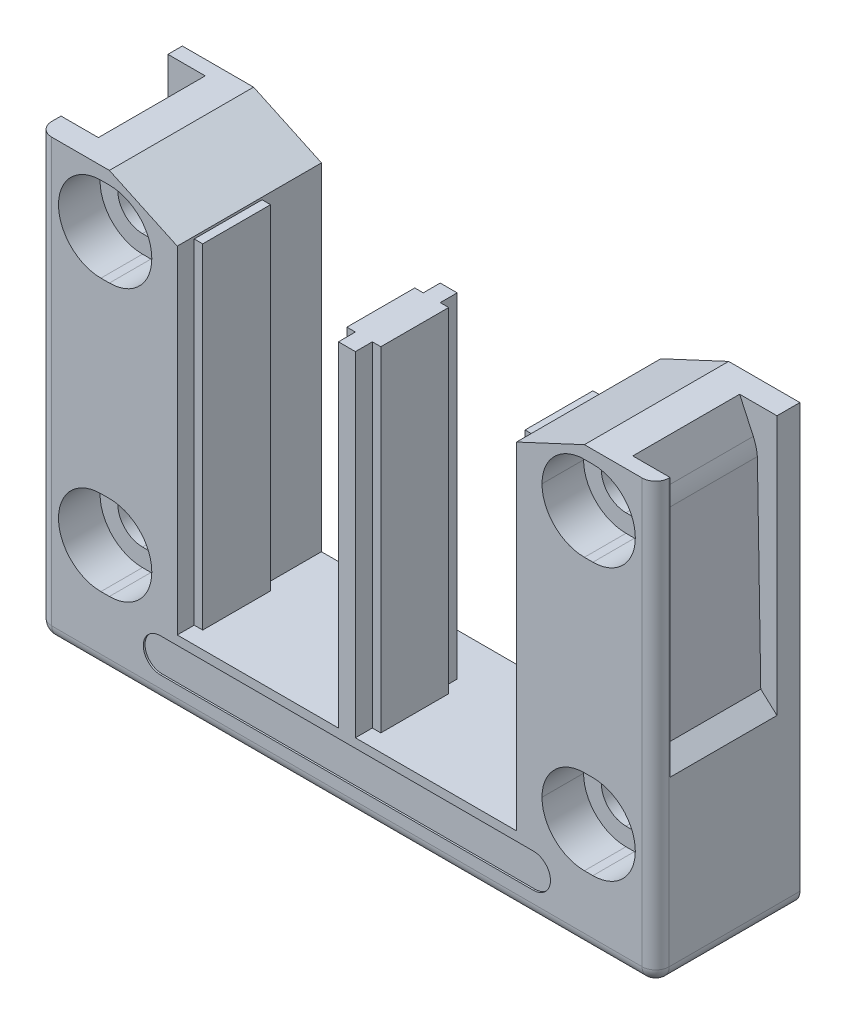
ISO-10303-21;
HEADER;
FILE_DESCRIPTION(('STEP AP214'),'2;1');
FILE_NAME('part.step','',(''),(''),'','','');
FILE_SCHEMA(('AUTOMOTIVE_DESIGN { 1 0 10303 214 1 1 1 1 }'));
ENDSEC;
DATA;
#1=APPLICATION_CONTEXT('core data for automotive mechanical design processes');
#2=APPLICATION_PROTOCOL_DEFINITION('international standard','automotive_design',2000,#1);
#3=PRODUCT_CONTEXT('',#1,'mechanical');
#4=PRODUCT('Part','Part','',(#3));
#5=PRODUCT_RELATED_PRODUCT_CATEGORY('part','',(#4));
#6=PRODUCT_DEFINITION_FORMATION('','',#4);
#7=PRODUCT_DEFINITION_CONTEXT('part definition',#1,'design');
#8=PRODUCT_DEFINITION('design','',#6,#7);
#9=PRODUCT_DEFINITION_SHAPE('','',#8);
#10=(LENGTH_UNIT() NAMED_UNIT(*) SI_UNIT(.MILLI.,.METRE.));
#11=(NAMED_UNIT(*) PLANE_ANGLE_UNIT() SI_UNIT($,.RADIAN.));
#12=(NAMED_UNIT(*) SI_UNIT($,.STERADIAN.) SOLID_ANGLE_UNIT());
#13=UNCERTAINTY_MEASURE_WITH_UNIT(LENGTH_MEASURE(1.E-05),#10,'distance_accuracy_value','');
#14=(GEOMETRIC_REPRESENTATION_CONTEXT(3) GLOBAL_UNCERTAINTY_ASSIGNED_CONTEXT((#13)) GLOBAL_UNIT_ASSIGNED_CONTEXT((#10,
#11,#12)) REPRESENTATION_CONTEXT('',''));
#15=CARTESIAN_POINT('',(0.,0.,0.));
#16=DIRECTION('',(0.,0.,1.));
#17=DIRECTION('',(1.,0.,0.));
#18=AXIS2_PLACEMENT_3D('',#15,#16,#17);
#19=CARTESIAN_POINT('',(-22.,-46.5,8.3));
#20=DIRECTION('',(0.,0.,1.));
#21=DIRECTION('',(1.,0.,0.));
#22=AXIS2_PLACEMENT_3D('',#19,#20,#21);
#23=PLANE('',#22);
#24=CARTESIAN_POINT('',(-22.,-46.5,8.3));
#25=DIRECTION('',(0.,0.,1.));
#26=DIRECTION('',(1.,0.,0.));
#27=AXIS2_PLACEMENT_3D('',#24,#25,#26);
#28=CIRCLE('',#27,2.);
#29=CARTESIAN_POINT('',(-22.,-44.5,8.3));
#30=VERTEX_POINT('',#29);
#31=CARTESIAN_POINT('',(-22.,-48.5,8.3));
#32=VERTEX_POINT('',#31);
#33=EDGE_CURVE('E602',#30,#32,#28,.T.);
#34=ORIENTED_EDGE('',*,*,#33,.T.);
#35=DIRECTION('',(1.,0.,0.));
#36=VECTOR('',#35,1.);
#37=CARTESIAN_POINT('',(-22.,-48.5,8.3));
#38=LINE('',#37,#36);
#39=CARTESIAN_POINT('',(22.,-48.5,8.3));
#40=VERTEX_POINT('',#39);
#41=EDGE_CURVE('E10',#32,#40,#38,.T.);
#42=ORIENTED_EDGE('',*,*,#41,.T.);
#43=CARTESIAN_POINT('',(22.,-46.5,8.3));
#44=DIRECTION('',(0.,0.,1.));
#45=DIRECTION('',(1.,0.,0.));
#46=AXIS2_PLACEMENT_3D('',#43,#44,#45);
#47=CIRCLE('',#46,2.);
#48=CARTESIAN_POINT('',(24.,-46.5,8.3));
#49=VERTEX_POINT('',#48);
#50=EDGE_CURVE('E791',#40,#49,#47,.T.);
#51=ORIENTED_EDGE('',*,*,#50,.T.);
#52=CARTESIAN_POINT('',(22.,-46.5,8.3));
#53=DIRECTION('',(0.,0.,1.));
#54=DIRECTION('',(1.,0.,0.));
#55=AXIS2_PLACEMENT_3D('',#52,#53,#54);
#56=CIRCLE('',#55,2.);
#57=CARTESIAN_POINT('',(22.,-44.5,8.3));
#58=VERTEX_POINT('',#57);
#59=EDGE_CURVE('E1399',#49,#58,#56,.T.);
#60=ORIENTED_EDGE('',*,*,#59,.T.);
#61=DIRECTION('',(-1.,0.,0.));
#62=VECTOR('',#61,1.);
#63=CARTESIAN_POINT('',(-22.,-44.5,8.3));
#64=LINE('',#63,#62);
#65=EDGE_CURVE('E605',#58,#30,#64,.T.);
#66=ORIENTED_EDGE('',*,*,#65,.T.);
#67=EDGE_LOOP('',(#34,#42,#51,#60,#66));
#68=FACE_BOUND('',#67,.T.);
#69=ADVANCED_FACE('F15',(#68),#23,.T.);
#70=CARTESIAN_POINT('',(-22.,-48.5,8.3));
#71=DIRECTION('',(0.,-1.,0.));
#72=DIRECTION('',(0.,0.,-1.));
#73=AXIS2_PLACEMENT_3D('',#70,#71,#72);
#74=PLANE('',#73);
#75=DIRECTION('',(1.,0.,0.));
#76=VECTOR('',#75,1.);
#77=CARTESIAN_POINT('',(-22.,-48.5,8.5));
#78=LINE('',#77,#76);
#79=CARTESIAN_POINT('',(-22.,-48.5,8.5));
#80=VERTEX_POINT('',#79);
#81=CARTESIAN_POINT('',(22.,-48.5,8.5));
#82=VERTEX_POINT('',#81);
#83=EDGE_CURVE('E851',#80,#82,#78,.T.);
#84=ORIENTED_EDGE('',*,*,#83,.T.);
#85=DIRECTION('',(0.,0.,1.));
#86=VECTOR('',#85,1.);
#87=CARTESIAN_POINT('',(22.,-48.5,8.3));
#88=LINE('',#87,#86);
#89=EDGE_CURVE('E24',#40,#82,#88,.T.);
#90=ORIENTED_EDGE('',*,*,#89,.F.);
#91=ORIENTED_EDGE('',*,*,#41,.F.);
#92=DIRECTION('',(0.,0.,1.));
#93=VECTOR('',#92,1.);
#94=CARTESIAN_POINT('',(-22.,-48.5,8.3));
#95=LINE('',#94,#93);
#96=EDGE_CURVE('E598',#32,#80,#95,.T.);
#97=ORIENTED_EDGE('',*,*,#96,.T.);
#98=EDGE_LOOP('',(#84,#90,#91,#97));
#99=FACE_BOUND('',#98,.T.);
#100=ADVANCED_FACE('F596',(#99),#74,.F.);
#101=CARTESIAN_POINT('',(22.,-46.5,8.3));
#102=DIRECTION('',(0.,0.,1.));
#103=DIRECTION('',(1.,0.,0.));
#104=AXIS2_PLACEMENT_3D('',#101,#102,#103);
#105=CYLINDRICAL_SURFACE('',#104,2.);
#106=DIRECTION('',(0.,0.,1.));
#107=VECTOR('',#106,1.);
#108=CARTESIAN_POINT('',(24.,-46.5,8.3));
#109=LINE('',#108,#107);
#110=CARTESIAN_POINT('',(24.,-46.5,8.5));
#111=VERTEX_POINT('',#110);
#112=EDGE_CURVE('E1404',#49,#111,#109,.T.);
#113=ORIENTED_EDGE('',*,*,#112,.F.);
#114=ORIENTED_EDGE('',*,*,#50,.F.);
#115=ORIENTED_EDGE('',*,*,#89,.T.);
#116=CARTESIAN_POINT('',(22.,-46.5,8.5));
#117=DIRECTION('',(0.,0.,1.));
#118=DIRECTION('',(1.,0.,0.));
#119=AXIS2_PLACEMENT_3D('',#116,#117,#118);
#120=CIRCLE('',#119,2.);
#121=EDGE_CURVE('E847',#82,#111,#120,.T.);
#122=ORIENTED_EDGE('',*,*,#121,.T.);
#123=EDGE_LOOP('',(#113,#114,#115,#122));
#124=FACE_BOUND('',#123,.T.);
#125=ADVANCED_FACE('F1405',(#124),#105,.F.);
#126=CARTESIAN_POINT('',(-22.,-44.5,8.3));
#127=DIRECTION('',(0.,1.,0.));
#128=DIRECTION('',(1.,0.,0.));
#129=AXIS2_PLACEMENT_3D('',#126,#127,#128);
#130=PLANE('',#129);
#131=DIRECTION('',(-1.,0.,0.));
#132=VECTOR('',#131,1.);
#133=CARTESIAN_POINT('',(-22.,-44.5,8.5));
#134=LINE('',#133,#132);
#135=CARTESIAN_POINT('',(22.,-44.5,8.5));
#136=VERTEX_POINT('',#135);
#137=CARTESIAN_POINT('',(-22.,-44.5,8.5));
#138=VERTEX_POINT('',#137);
#139=EDGE_CURVE('E852',#136,#138,#134,.T.);
#140=ORIENTED_EDGE('',*,*,#139,.T.);
#141=DIRECTION('',(0.,0.,1.));
#142=VECTOR('',#141,1.);
#143=CARTESIAN_POINT('',(-22.,-44.5,8.3));
#144=LINE('',#143,#142);
#145=EDGE_CURVE('E610',#30,#138,#144,.T.);
#146=ORIENTED_EDGE('',*,*,#145,.F.);
#147=ORIENTED_EDGE('',*,*,#65,.F.);
#148=DIRECTION('',(0.,0.,1.));
#149=VECTOR('',#148,1.);
#150=CARTESIAN_POINT('',(22.,-44.5,8.3));
#151=LINE('',#150,#149);
#152=EDGE_CURVE('E1417',#58,#136,#151,.T.);
#153=ORIENTED_EDGE('',*,*,#152,.T.);
#154=EDGE_LOOP('',(#140,#146,#147,#153));
#155=FACE_BOUND('',#154,.T.);
#156=ADVANCED_FACE('F1892',(#155),#130,.F.);
#157=CARTESIAN_POINT('',(-22.,-46.5,8.3));
#158=DIRECTION('',(0.,0.,1.));
#159=DIRECTION('',(1.,0.,0.));
#160=AXIS2_PLACEMENT_3D('',#157,#158,#159);
#161=CYLINDRICAL_SURFACE('',#160,2.);
#162=CARTESIAN_POINT('',(-22.,-46.5,8.5));
#163=DIRECTION('',(0.,0.,1.));
#164=DIRECTION('',(1.,0.,0.));
#165=AXIS2_PLACEMENT_3D('',#162,#163,#164);
#166=CIRCLE('',#165,2.);
#167=EDGE_CURVE('E615',#138,#80,#166,.T.);
#168=ORIENTED_EDGE('',*,*,#167,.T.);
#169=ORIENTED_EDGE('',*,*,#96,.F.);
#170=ORIENTED_EDGE('',*,*,#33,.F.);
#171=ORIENTED_EDGE('',*,*,#145,.T.);
#172=EDGE_LOOP('',(#168,#169,#170,#171));
#173=FACE_BOUND('',#172,.T.);
#174=ADVANCED_FACE('F613',(#173),#161,.F.);
#175=CARTESIAN_POINT('',(-19.,-56.0795719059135,-1.5));
#176=DIRECTION('',(0.,0.,1.));
#177=DIRECTION('',(1.,0.,0.));
#178=AXIS2_PLACEMENT_3D('',#175,#176,#177);
#179=PLANE('',#178);
#180=DIRECTION('',(0.,1.,0.));
#181=VECTOR('',#180,1.);
#182=CARTESIAN_POINT('',(-19.,-56.0795719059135,-1.5));
#183=LINE('',#182,#181);
#184=CARTESIAN_POINT('',(-19.0000000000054,-43.43046126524,-1.5));
#185=VERTEX_POINT('',#184);
#186=CARTESIAN_POINT('',(-19.,-4.,-1.5));
#187=VERTEX_POINT('',#186);
#188=EDGE_CURVE('E617',#185,#187,#183,.T.);
#189=ORIENTED_EDGE('',*,*,#188,.F.);
#190=DIRECTION('',(-1.,0.,0.));
#191=VECTOR('',#190,1.);
#192=CARTESIAN_POINT('',(-19.,-43.43046126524,-1.5));
#193=LINE('',#192,#191);
#194=CARTESIAN_POINT('',(-19.9999999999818,-43.43046126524,-1.5));
#195=VERTEX_POINT('',#194);
#196=EDGE_CURVE('E700',#185,#195,#193,.T.);
#197=ORIENTED_EDGE('',*,*,#196,.T.);
#198=DIRECTION('',(0.,1.,0.));
#199=VECTOR('',#198,1.);
#200=CARTESIAN_POINT('',(-20.,-56.0795719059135,-1.5));
#201=LINE('',#200,#199);
#202=CARTESIAN_POINT('',(-20.,-4.,-1.5));
#203=VERTEX_POINT('',#202);
#204=EDGE_CURVE('E1447',#195,#203,#201,.T.);
#205=ORIENTED_EDGE('',*,*,#204,.T.);
#206=DIRECTION('',(1.,0.,0.));
#207=VECTOR('',#206,1.);
#208=CARTESIAN_POINT('',(-19.,-4.,-1.5));
#209=LINE('',#208,#207);
#210=EDGE_CURVE('E1377',#203,#187,#209,.T.);
#211=ORIENTED_EDGE('',*,*,#210,.T.);
#212=EDGE_LOOP('',(#189,#197,#205,#211));
#213=FACE_BOUND('',#212,.T.);
#214=ADVANCED_FACE('F1968',(#213),#179,.F.);
#215=CARTESIAN_POINT('',(-19.,-56.0795719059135,-1.5));
#216=DIRECTION('',(-1.,0.,0.));
#217=DIRECTION('',(0.,0.,1.));
#218=AXIS2_PLACEMENT_3D('',#215,#216,#217);
#219=PLANE('',#218);
#220=DIRECTION('',(0.,1.,0.));
#221=VECTOR('',#220,1.);
#222=CARTESIAN_POINT('',(-19.,-56.0795719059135,6.5));
#223=LINE('',#222,#221);
#224=CARTESIAN_POINT('',(-19.0000000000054,-43.43046126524,6.5));
#225=VERTEX_POINT('',#224);
#226=CARTESIAN_POINT('',(-19.,-4.,6.5));
#227=VERTEX_POINT('',#226);
#228=EDGE_CURVE('E623',#225,#227,#223,.T.);
#229=ORIENTED_EDGE('',*,*,#228,.F.);
#230=DIRECTION('',(0.,0.,-1.));
#231=VECTOR('',#230,1.);
#232=CARTESIAN_POINT('',(-19.,-43.43046126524,-1.5));
#233=LINE('',#232,#231);
#234=EDGE_CURVE('E1628',#225,#185,#233,.T.);
#235=ORIENTED_EDGE('',*,*,#234,.T.);
#236=ORIENTED_EDGE('',*,*,#188,.T.);
#237=DIRECTION('',(0.,0.,1.));
#238=VECTOR('',#237,1.);
#239=CARTESIAN_POINT('',(-19.,-4.,-1.5));
#240=LINE('',#239,#238);
#241=EDGE_CURVE('E1384',#187,#227,#240,.T.);
#242=ORIENTED_EDGE('',*,*,#241,.T.);
#243=EDGE_LOOP('',(#229,#235,#236,#242));
#244=FACE_BOUND('',#243,.T.);
#245=ADVANCED_FACE('F1971',(#244),#219,.F.);
#246=CARTESIAN_POINT('',(-19.,-56.0795719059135,6.5));
#247=DIRECTION('',(0.,0.,-1.));
#248=DIRECTION('',(0.,-1.,0.));
#249=AXIS2_PLACEMENT_3D('',#246,#247,#248);
#250=PLANE('',#249);
#251=DIRECTION('',(0.,1.,0.));
#252=VECTOR('',#251,1.);
#253=CARTESIAN_POINT('',(-20.,-56.0795719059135,6.5));
#254=LINE('',#253,#252);
#255=CARTESIAN_POINT('',(-19.9999999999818,-43.43046126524,6.5));
#256=VERTEX_POINT('',#255);
#257=CARTESIAN_POINT('',(-20.,-4.,6.5));
#258=VERTEX_POINT('',#257);
#259=EDGE_CURVE('E704',#256,#258,#254,.T.);
#260=ORIENTED_EDGE('',*,*,#259,.F.);
#261=DIRECTION('',(1.,0.,0.));
#262=VECTOR('',#261,1.);
#263=CARTESIAN_POINT('',(-19.,-43.43046126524,6.5));
#264=LINE('',#263,#262);
#265=EDGE_CURVE('E1638',#256,#225,#264,.T.);
#266=ORIENTED_EDGE('',*,*,#265,.T.);
#267=ORIENTED_EDGE('',*,*,#228,.T.);
#268=DIRECTION('',(-1.,0.,0.));
#269=VECTOR('',#268,1.);
#270=CARTESIAN_POINT('',(-19.,-4.,6.5));
#271=LINE('',#270,#269);
#272=EDGE_CURVE('E1381',#227,#258,#271,.T.);
#273=ORIENTED_EDGE('',*,*,#272,.T.);
#274=EDGE_LOOP('',(#260,#266,#267,#273));
#275=FACE_BOUND('',#274,.T.);
#276=ADVANCED_FACE('F1966',(#275),#250,.F.);
#277=CARTESIAN_POINT('',(0.,-4.,0.));
#278=DIRECTION('',(0.,1.,0.));
#279=DIRECTION('',(1.,0.,0.));
#280=AXIS2_PLACEMENT_3D('',#277,#278,#279);
#281=PLANE('',#280);
#282=ORIENTED_EDGE('',*,*,#210,.F.);
#283=DIRECTION('',(0.,0.,-1.));
#284=VECTOR('',#283,1.);
#285=CARTESIAN_POINT('',(-20.,-4.,-1.5));
#286=LINE('',#285,#284);
#287=EDGE_CURVE('E1443',#258,#203,#286,.T.);
#288=ORIENTED_EDGE('',*,*,#287,.F.);
#289=ORIENTED_EDGE('',*,*,#272,.F.);
#290=ORIENTED_EDGE('',*,*,#241,.F.);
#291=EDGE_LOOP('',(#282,#288,#289,#290));
#292=FACE_BOUND('',#291,.T.);
#293=ADVANCED_FACE('F1962',(#292),#281,.T.);
#294=CARTESIAN_POINT('',(0.999999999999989,-56.0795719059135,-3.5));
#295=DIRECTION('',(0.,0.,1.));
#296=DIRECTION('',(1.,0.,0.));
#297=AXIS2_PLACEMENT_3D('',#294,#295,#296);
#298=PLANE('',#297);
#299=DIRECTION('',(0.,1.,0.));
#300=VECTOR('',#299,1.);
#301=CARTESIAN_POINT('',(0.999999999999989,-56.0795719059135,-3.5));
#302=LINE('',#301,#300);
#303=CARTESIAN_POINT('',(1.0000000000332,-43.43046126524,-3.5));
#304=VERTEX_POINT('',#303);
#305=CARTESIAN_POINT('',(0.999999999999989,-4.,-3.5));
#306=VERTEX_POINT('',#305);
#307=EDGE_CURVE('E1374',#304,#306,#302,.T.);
#308=ORIENTED_EDGE('',*,*,#307,.F.);
#309=DIRECTION('',(-1.,0.,0.));
#310=VECTOR('',#309,1.);
#311=CARTESIAN_POINT('',(0.999999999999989,-43.43046126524,-3.5));
#312=LINE('',#311,#310);
#313=CARTESIAN_POINT('',(-1.0000000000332,-43.43046126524,-3.5));
#314=VERTEX_POINT('',#313);
#315=EDGE_CURVE('E649',#304,#314,#312,.T.);
#316=ORIENTED_EDGE('',*,*,#315,.T.);
#317=DIRECTION('',(0.,1.,0.));
#318=VECTOR('',#317,1.);
#319=CARTESIAN_POINT('',(-0.999999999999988,-56.0795719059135,-3.5));
#320=LINE('',#319,#318);
#321=CARTESIAN_POINT('',(-0.999999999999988,-4.,-3.5));
#322=VERTEX_POINT('',#321);
#323=EDGE_CURVE('E734',#314,#322,#320,.T.);
#324=ORIENTED_EDGE('',*,*,#323,.T.);
#325=DIRECTION('',(1.,0.,0.));
#326=VECTOR('',#325,1.);
#327=CARTESIAN_POINT('',(0.999999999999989,-4.,-3.5));
#328=LINE('',#327,#326);
#329=EDGE_CURVE('E876',#322,#306,#328,.T.);
#330=ORIENTED_EDGE('',*,*,#329,.T.);
#331=EDGE_LOOP('',(#308,#316,#324,#330));
#332=FACE_BOUND('',#331,.T.);
#333=ADVANCED_FACE('F1959',(#332),#298,.F.);
#334=CARTESIAN_POINT('',(0.999999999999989,-56.0795719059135,-3.5));
#335=DIRECTION('',(-1.,0.,0.));
#336=DIRECTION('',(0.,0.,1.));
#337=AXIS2_PLACEMENT_3D('',#334,#335,#336);
#338=PLANE('',#337);
#339=DIRECTION('',(0.,1.,0.));
#340=VECTOR('',#339,1.);
#341=CARTESIAN_POINT('',(0.999999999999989,-56.0795719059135,-1.5));
#342=LINE('',#341,#340);
#343=CARTESIAN_POINT('',(0.999999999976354,-43.43046126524,-1.5));
#344=VERTEX_POINT('',#343);
#345=CARTESIAN_POINT('',(0.999999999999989,-4.,-1.5));
#346=VERTEX_POINT('',#345);
#347=EDGE_CURVE('E1371',#344,#346,#342,.T.);
#348=ORIENTED_EDGE('',*,*,#347,.F.);
#349=DIRECTION('',(0.,0.,-1.));
#350=VECTOR('',#349,1.);
#351=CARTESIAN_POINT('',(0.999999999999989,-43.43046126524,-3.5));
#352=LINE('',#351,#350);
#353=EDGE_CURVE('E653',#344,#304,#352,.T.);
#354=ORIENTED_EDGE('',*,*,#353,.T.);
#355=ORIENTED_EDGE('',*,*,#307,.T.);
#356=DIRECTION('',(0.,0.,1.));
#357=VECTOR('',#356,1.);
#358=CARTESIAN_POINT('',(0.999999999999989,-4.,-3.5));
#359=LINE('',#358,#357);
#360=EDGE_CURVE('E738',#306,#346,#359,.T.);
#361=ORIENTED_EDGE('',*,*,#360,.T.);
#362=EDGE_LOOP('',(#348,#354,#355,#361));
#363=FACE_BOUND('',#362,.T.);
#364=ADVANCED_FACE('F1957',(#363),#338,.F.);
#365=CARTESIAN_POINT('',(2.,-56.0795719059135,-1.5));
#366=DIRECTION('',(0.,0.,1.));
#367=DIRECTION('',(1.,0.,0.));
#368=AXIS2_PLACEMENT_3D('',#365,#366,#367);
#369=PLANE('',#368);
#370=DIRECTION('',(0.,1.,0.));
#371=VECTOR('',#370,1.);
#372=CARTESIAN_POINT('',(2.,-56.0795719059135,-1.5));
#373=LINE('',#372,#371);
#374=CARTESIAN_POINT('',(2.00000000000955,-43.43046126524,-1.5));
#375=VERTEX_POINT('',#374);
#376=CARTESIAN_POINT('',(2.,-4.,-1.5));
#377=VERTEX_POINT('',#376);
#378=EDGE_CURVE('E1368',#375,#377,#373,.T.);
#379=ORIENTED_EDGE('',*,*,#378,.F.);
#380=DIRECTION('',(-1.,0.,0.));
#381=VECTOR('',#380,1.);
#382=CARTESIAN_POINT('',(2.,-43.43046126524,-1.5));
#383=LINE('',#382,#381);
#384=EDGE_CURVE('E658',#375,#344,#383,.T.);
#385=ORIENTED_EDGE('',*,*,#384,.T.);
#386=ORIENTED_EDGE('',*,*,#347,.T.);
#387=DIRECTION('',(1.,0.,0.));
#388=VECTOR('',#387,1.);
#389=CARTESIAN_POINT('',(2.,-4.,-1.5));
#390=LINE('',#389,#388);
#391=EDGE_CURVE('E1348',#346,#377,#390,.T.);
#392=ORIENTED_EDGE('',*,*,#391,.T.);
#393=EDGE_LOOP('',(#379,#385,#386,#392));
#394=FACE_BOUND('',#393,.T.);
#395=ADVANCED_FACE('F1954',(#394),#369,.F.);
#396=CARTESIAN_POINT('',(2.,-56.0795719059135,-1.5));
#397=DIRECTION('',(-1.,0.,0.));
#398=DIRECTION('',(0.,0.,1.));
#399=AXIS2_PLACEMENT_3D('',#396,#397,#398);
#400=PLANE('',#399);
#401=DIRECTION('',(0.,1.,0.));
#402=VECTOR('',#401,1.);
#403=CARTESIAN_POINT('',(2.,-56.0795719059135,6.5));
#404=LINE('',#403,#402);
#405=CARTESIAN_POINT('',(2.00000000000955,-43.43046126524,6.5));
#406=VERTEX_POINT('',#405);
#407=CARTESIAN_POINT('',(2.,-4.,6.5));
#408=VERTEX_POINT('',#407);
#409=EDGE_CURVE('E1365',#406,#408,#404,.T.);
#410=ORIENTED_EDGE('',*,*,#409,.F.);
#411=DIRECTION('',(0.,0.,-1.));
#412=VECTOR('',#411,1.);
#413=CARTESIAN_POINT('',(2.,-43.43046126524,-1.5));
#414=LINE('',#413,#412);
#415=EDGE_CURVE('E662',#406,#375,#414,.T.);
#416=ORIENTED_EDGE('',*,*,#415,.T.);
#417=ORIENTED_EDGE('',*,*,#378,.T.);
#418=DIRECTION('',(0.,0.,1.));
#419=VECTOR('',#418,1.);
#420=CARTESIAN_POINT('',(2.,-4.,-1.5));
#421=LINE('',#420,#419);
#422=EDGE_CURVE('E1344',#377,#408,#421,.T.);
#423=ORIENTED_EDGE('',*,*,#422,.T.);
#424=EDGE_LOOP('',(#410,#416,#417,#423));
#425=FACE_BOUND('',#424,.T.);
#426=ADVANCED_FACE('F1952',(#425),#400,.F.);
#427=CARTESIAN_POINT('',(2.,-56.0795719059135,6.5));
#428=DIRECTION('',(0.,0.,-1.));
#429=DIRECTION('',(0.,-1.,0.));
#430=AXIS2_PLACEMENT_3D('',#427,#428,#429);
#431=PLANE('',#430);
#432=DIRECTION('',(0.,1.,0.));
#433=VECTOR('',#432,1.);
#434=CARTESIAN_POINT('',(0.999999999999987,-56.0795719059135,6.5));
#435=LINE('',#434,#433);
#436=CARTESIAN_POINT('',(0.999999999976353,-43.43046126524,6.5));
#437=VERTEX_POINT('',#436);
#438=CARTESIAN_POINT('',(0.999999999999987,-4.,6.5));
#439=VERTEX_POINT('',#438);
#440=EDGE_CURVE('E1362',#437,#439,#435,.T.);
#441=ORIENTED_EDGE('',*,*,#440,.F.);
#442=DIRECTION('',(1.,0.,0.));
#443=VECTOR('',#442,1.);
#444=CARTESIAN_POINT('',(2.,-43.43046126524,6.5));
#445=LINE('',#444,#443);
#446=EDGE_CURVE('E666',#437,#406,#445,.T.);
#447=ORIENTED_EDGE('',*,*,#446,.T.);
#448=ORIENTED_EDGE('',*,*,#409,.T.);
#449=DIRECTION('',(-1.,0.,0.));
#450=VECTOR('',#449,1.);
#451=CARTESIAN_POINT('',(2.,-4.,6.5));
#452=LINE('',#451,#450);
#453=EDGE_CURVE('E1340',#408,#439,#452,.T.);
#454=ORIENTED_EDGE('',*,*,#453,.T.);
#455=EDGE_LOOP('',(#441,#447,#448,#454));
#456=FACE_BOUND('',#455,.T.);
#457=ADVANCED_FACE('F1949',(#456),#431,.F.);
#458=CARTESIAN_POINT('',(0.999999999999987,-56.0795719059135,6.5));
#459=DIRECTION('',(-1.,0.,0.));
#460=DIRECTION('',(0.,0.,1.));
#461=AXIS2_PLACEMENT_3D('',#458,#459,#460);
#462=PLANE('',#461);
#463=DIRECTION('',(0.,1.,0.));
#464=VECTOR('',#463,1.);
#465=CARTESIAN_POINT('',(0.999999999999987,-56.0795719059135,8.5));
#466=LINE('',#465,#464);
#467=CARTESIAN_POINT('',(0.999999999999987,-43.43046126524,8.5));
#468=VERTEX_POINT('',#467);
#469=CARTESIAN_POINT('',(0.999999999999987,-4.,8.5));
#470=VERTEX_POINT('',#469);
#471=EDGE_CURVE('E800',#468,#470,#466,.T.);
#472=ORIENTED_EDGE('',*,*,#471,.F.);
#473=DIRECTION('',(0.,0.,-1.));
#474=VECTOR('',#473,1.);
#475=CARTESIAN_POINT('',(0.999999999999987,-43.43046126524,6.5));
#476=LINE('',#475,#474);
#477=EDGE_CURVE('E670',#468,#437,#476,.T.);
#478=ORIENTED_EDGE('',*,*,#477,.T.);
#479=ORIENTED_EDGE('',*,*,#440,.T.);
#480=DIRECTION('',(0.,0.,1.));
#481=VECTOR('',#480,1.);
#482=CARTESIAN_POINT('',(0.999999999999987,-4.,6.5));
#483=LINE('',#482,#481);
#484=EDGE_CURVE('E1337',#439,#470,#483,.T.);
#485=ORIENTED_EDGE('',*,*,#484,.T.);
#486=EDGE_LOOP('',(#472,#478,#479,#485));
#487=FACE_BOUND('',#486,.T.);
#488=ADVANCED_FACE('F1948',(#487),#462,.F.);
#489=CARTESIAN_POINT('',(-0.999999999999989,-56.0795719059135,6.5));
#490=DIRECTION('',(1.,0.,0.));
#491=DIRECTION('',(0.,0.,1.));
#492=AXIS2_PLACEMENT_3D('',#489,#490,#491);
#493=PLANE('',#492);
#494=DIRECTION('',(0.,1.,0.));
#495=VECTOR('',#494,1.);
#496=CARTESIAN_POINT('',(-0.999999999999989,-56.0795719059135,6.5));
#497=LINE('',#496,#495);
#498=CARTESIAN_POINT('',(-0.999999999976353,-43.43046126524,6.5));
#499=VERTEX_POINT('',#498);
#500=CARTESIAN_POINT('',(-0.999999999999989,-4.,6.5));
#501=VERTEX_POINT('',#500);
#502=EDGE_CURVE('E1359',#499,#501,#497,.T.);
#503=ORIENTED_EDGE('',*,*,#502,.F.);
#504=DIRECTION('',(0.,0.,1.));
#505=VECTOR('',#504,1.);
#506=CARTESIAN_POINT('',(-0.999999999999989,-43.43046126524,6.5));
#507=LINE('',#506,#505);
#508=CARTESIAN_POINT('',(-1.00000000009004,-43.43046126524,8.5));
#509=VERTEX_POINT('',#508);
#510=EDGE_CURVE('E634',#499,#509,#507,.T.);
#511=ORIENTED_EDGE('',*,*,#510,.T.);
#512=DIRECTION('',(0.,1.,0.));
#513=VECTOR('',#512,1.);
#514=CARTESIAN_POINT('',(-0.999999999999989,-56.0795719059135,8.5));
#515=LINE('',#514,#513);
#516=CARTESIAN_POINT('',(-0.999999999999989,-4.,8.5));
#517=VERTEX_POINT('',#516);
#518=EDGE_CURVE('E678',#509,#517,#515,.T.);
#519=ORIENTED_EDGE('',*,*,#518,.T.);
#520=DIRECTION('',(0.,0.,-1.));
#521=VECTOR('',#520,1.);
#522=CARTESIAN_POINT('',(-0.999999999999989,-4.,6.5));
#523=LINE('',#522,#521);
#524=EDGE_CURVE('E819',#517,#501,#523,.T.);
#525=ORIENTED_EDGE('',*,*,#524,.T.);
#526=EDGE_LOOP('',(#503,#511,#519,#525));
#527=FACE_BOUND('',#526,.T.);
#528=ADVANCED_FACE('F1665',(#527),#493,.F.);
#529=CARTESIAN_POINT('',(-0.999999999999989,-56.0795719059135,6.5));
#530=DIRECTION('',(0.,0.,-1.));
#531=DIRECTION('',(0.,-1.,0.));
#532=AXIS2_PLACEMENT_3D('',#529,#530,#531);
#533=PLANE('',#532);
#534=DIRECTION('',(0.,1.,0.));
#535=VECTOR('',#534,1.);
#536=CARTESIAN_POINT('',(-1.99999999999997,-56.0795719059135,6.5));
#537=LINE('',#536,#535);
#538=CARTESIAN_POINT('',(-2.00000000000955,-43.43046126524,6.5));
#539=VERTEX_POINT('',#538);
#540=CARTESIAN_POINT('',(-1.99999999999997,-4.,6.5));
#541=VERTEX_POINT('',#540);
#542=EDGE_CURVE('E758',#539,#541,#537,.T.);
#543=ORIENTED_EDGE('',*,*,#542,.F.);
#544=DIRECTION('',(1.,0.,0.));
#545=VECTOR('',#544,1.);
#546=CARTESIAN_POINT('',(-0.999999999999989,-43.43046126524,6.5));
#547=LINE('',#546,#545);
#548=EDGE_CURVE('E638',#539,#499,#547,.T.);
#549=ORIENTED_EDGE('',*,*,#548,.T.);
#550=ORIENTED_EDGE('',*,*,#502,.T.);
#551=DIRECTION('',(-1.,0.,0.));
#552=VECTOR('',#551,1.);
#553=CARTESIAN_POINT('',(-0.999999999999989,-4.,6.5));
#554=LINE('',#553,#552);
#555=EDGE_CURVE('E815',#501,#541,#554,.T.);
#556=ORIENTED_EDGE('',*,*,#555,.T.);
#557=EDGE_LOOP('',(#543,#549,#550,#556));
#558=FACE_BOUND('',#557,.T.);
#559=ADVANCED_FACE('F1669',(#558),#533,.F.);
#560=CARTESIAN_POINT('',(-1.99999999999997,-56.0795719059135,-1.5));
#561=DIRECTION('',(1.,0.,0.));
#562=DIRECTION('',(0.,0.,1.));
#563=AXIS2_PLACEMENT_3D('',#560,#561,#562);
#564=PLANE('',#563);
#565=DIRECTION('',(0.,1.,0.));
#566=VECTOR('',#565,1.);
#567=CARTESIAN_POINT('',(-1.99999999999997,-56.0795719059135,-1.5));
#568=LINE('',#567,#566);
#569=CARTESIAN_POINT('',(-2.00000000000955,-43.43046126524,-1.5));
#570=VERTEX_POINT('',#569);
#571=CARTESIAN_POINT('',(-1.99999999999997,-4.,-1.5));
#572=VERTEX_POINT('',#571);
#573=EDGE_CURVE('E755',#570,#572,#568,.T.);
#574=ORIENTED_EDGE('',*,*,#573,.F.);
#575=DIRECTION('',(0.,0.,1.));
#576=VECTOR('',#575,1.);
#577=CARTESIAN_POINT('',(-1.99999999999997,-43.43046126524,-1.5));
#578=LINE('',#577,#576);
#579=EDGE_CURVE('E648',#570,#539,#578,.T.);
#580=ORIENTED_EDGE('',*,*,#579,.T.);
#581=ORIENTED_EDGE('',*,*,#542,.T.);
#582=DIRECTION('',(0.,0.,-1.));
#583=VECTOR('',#582,1.);
#584=CARTESIAN_POINT('',(-1.99999999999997,-4.,-1.5));
#585=LINE('',#584,#583);
#586=EDGE_CURVE('E820',#541,#572,#585,.T.);
#587=ORIENTED_EDGE('',*,*,#586,.T.);
#588=EDGE_LOOP('',(#574,#580,#581,#587));
#589=FACE_BOUND('',#588,.T.);
#590=ADVANCED_FACE('F1921',(#589),#564,.F.);
#591=CARTESIAN_POINT('',(-0.999999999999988,-56.0795719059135,-1.5));
#592=DIRECTION('',(0.,0.,1.));
#593=DIRECTION('',(1.,0.,0.));
#594=AXIS2_PLACEMENT_3D('',#591,#592,#593);
#595=PLANE('',#594);
#596=DIRECTION('',(0.,1.,0.));
#597=VECTOR('',#596,1.);
#598=CARTESIAN_POINT('',(-0.999999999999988,-56.0795719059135,-1.5));
#599=LINE('',#598,#597);
#600=CARTESIAN_POINT('',(-0.999999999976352,-43.43046126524,-1.5));
#601=VERTEX_POINT('',#600);
#602=CARTESIAN_POINT('',(-0.999999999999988,-4.,-1.5));
#603=VERTEX_POINT('',#602);
#604=EDGE_CURVE('E737',#601,#603,#599,.T.);
#605=ORIENTED_EDGE('',*,*,#604,.F.);
#606=DIRECTION('',(-1.,0.,0.));
#607=VECTOR('',#606,1.);
#608=CARTESIAN_POINT('',(-0.999999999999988,-43.43046126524,-1.5));
#609=LINE('',#608,#607);
#610=EDGE_CURVE('E1455',#601,#570,#609,.T.);
#611=ORIENTED_EDGE('',*,*,#610,.T.);
#612=ORIENTED_EDGE('',*,*,#573,.T.);
#613=DIRECTION('',(1.,0.,0.));
#614=VECTOR('',#613,1.);
#615=CARTESIAN_POINT('',(-0.999999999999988,-4.,-1.5));
#616=LINE('',#615,#614);
#617=EDGE_CURVE('E875',#572,#603,#616,.T.);
#618=ORIENTED_EDGE('',*,*,#617,.T.);
#619=EDGE_LOOP('',(#605,#611,#612,#618));
#620=FACE_BOUND('',#619,.T.);
#621=ADVANCED_FACE('F1917',(#620),#595,.F.);
#622=CARTESIAN_POINT('',(-0.999999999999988,-56.0795719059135,-3.5));
#623=DIRECTION('',(1.,0.,0.));
#624=DIRECTION('',(0.,0.,1.));
#625=AXIS2_PLACEMENT_3D('',#622,#623,#624);
#626=PLANE('',#625);
#627=ORIENTED_EDGE('',*,*,#323,.F.);
#628=DIRECTION('',(0.,0.,1.));
#629=VECTOR('',#628,1.);
#630=CARTESIAN_POINT('',(-0.999999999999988,-43.43046126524,-3.5));
#631=LINE('',#630,#629);
#632=EDGE_CURVE('E654',#314,#601,#631,.T.);
#633=ORIENTED_EDGE('',*,*,#632,.T.);
#634=ORIENTED_EDGE('',*,*,#604,.T.);
#635=DIRECTION('',(0.,0.,-1.));
#636=VECTOR('',#635,1.);
#637=CARTESIAN_POINT('',(-0.999999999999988,-4.,-3.5));
#638=LINE('',#637,#636);
#639=EDGE_CURVE('E871',#603,#322,#638,.T.);
#640=ORIENTED_EDGE('',*,*,#639,.T.);
#641=EDGE_LOOP('',(#627,#633,#634,#640));
#642=FACE_BOUND('',#641,.T.);
#643=ADVANCED_FACE('F1920',(#642),#626,.F.);
#644=CARTESIAN_POINT('',(0.,-4.,0.));
#645=DIRECTION('',(0.,1.,0.));
#646=DIRECTION('',(1.,0.,0.));
#647=AXIS2_PLACEMENT_3D('',#644,#645,#646);
#648=PLANE('',#647);
#649=ORIENTED_EDGE('',*,*,#329,.F.);
#650=ORIENTED_EDGE('',*,*,#639,.F.);
#651=ORIENTED_EDGE('',*,*,#617,.F.);
#652=ORIENTED_EDGE('',*,*,#586,.F.);
#653=ORIENTED_EDGE('',*,*,#555,.F.);
#654=ORIENTED_EDGE('',*,*,#524,.F.);
#655=DIRECTION('',(-1.,0.,0.));
#656=VECTOR('',#655,1.);
#657=CARTESIAN_POINT('',(-0.999999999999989,-4.,8.5));
#658=LINE('',#657,#656);
#659=EDGE_CURVE('E808',#470,#517,#658,.T.);
#660=ORIENTED_EDGE('',*,*,#659,.F.);
#661=ORIENTED_EDGE('',*,*,#484,.F.);
#662=ORIENTED_EDGE('',*,*,#453,.F.);
#663=ORIENTED_EDGE('',*,*,#422,.F.);
#664=ORIENTED_EDGE('',*,*,#391,.F.);
#665=ORIENTED_EDGE('',*,*,#360,.F.);
#666=EDGE_LOOP('',(#649,#650,#651,#652,#653,#654,#660,#661,#662,#663,#664,#665));
#667=FACE_BOUND('',#666,.T.);
#668=ADVANCED_FACE('F1941',(#667),#648,.T.);
#669=CARTESIAN_POINT('',(20.,-56.0795719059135,-1.5));
#670=DIRECTION('',(0.,0.,1.));
#671=DIRECTION('',(1.,0.,0.));
#672=AXIS2_PLACEMENT_3D('',#669,#670,#671);
#673=PLANE('',#672);
#674=DIRECTION('',(0.,1.,0.));
#675=VECTOR('',#674,1.);
#676=CARTESIAN_POINT('',(20.,-56.0795719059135,-1.5));
#677=LINE('',#676,#675);
#678=CARTESIAN_POINT('',(20.,-43.43046126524,-1.5));
#679=VERTEX_POINT('',#678);
#680=CARTESIAN_POINT('',(20.,-4.,-1.5));
#681=VERTEX_POINT('',#680);
#682=EDGE_CURVE('E643',#679,#681,#677,.T.);
#683=ORIENTED_EDGE('',*,*,#682,.F.);
#684=DIRECTION('',(-1.,0.,0.));
#685=VECTOR('',#684,1.);
#686=CARTESIAN_POINT('',(20.,-43.43046126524,-1.5));
#687=LINE('',#686,#685);
#688=CARTESIAN_POINT('',(19.0000000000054,-43.43046126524,-1.5));
#689=VERTEX_POINT('',#688);
#690=EDGE_CURVE('E683',#679,#689,#687,.T.);
#691=ORIENTED_EDGE('',*,*,#690,.T.);
#692=DIRECTION('',(0.,1.,0.));
#693=VECTOR('',#692,1.);
#694=CARTESIAN_POINT('',(19.,-56.0795719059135,-1.5));
#695=LINE('',#694,#693);
#696=CARTESIAN_POINT('',(19.,-4.,-1.5));
#697=VERTEX_POINT('',#696);
#698=EDGE_CURVE('E1322',#689,#697,#695,.T.);
#699=ORIENTED_EDGE('',*,*,#698,.T.);
#700=DIRECTION('',(1.,0.,0.));
#701=VECTOR('',#700,1.);
#702=CARTESIAN_POINT('',(20.,-4.,-1.5));
#703=LINE('',#702,#701);
#704=EDGE_CURVE('E1310',#697,#681,#703,.T.);
#705=ORIENTED_EDGE('',*,*,#704,.T.);
#706=EDGE_LOOP('',(#683,#691,#699,#705));
#707=FACE_BOUND('',#706,.T.);
#708=ADVANCED_FACE('F1937',(#707),#673,.F.);
#709=CARTESIAN_POINT('',(20.,-56.0795719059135,6.5));
#710=DIRECTION('',(0.,0.,-1.));
#711=DIRECTION('',(0.,-1.,0.));
#712=AXIS2_PLACEMENT_3D('',#709,#710,#711);
#713=PLANE('',#712);
#714=DIRECTION('',(0.,1.,0.));
#715=VECTOR('',#714,1.);
#716=CARTESIAN_POINT('',(19.,-56.0795719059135,6.5));
#717=LINE('',#716,#715);
#718=CARTESIAN_POINT('',(19.0000000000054,-43.43046126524,6.5));
#719=VERTEX_POINT('',#718);
#720=CARTESIAN_POINT('',(19.,-4.,6.5));
#721=VERTEX_POINT('',#720);
#722=EDGE_CURVE('E1325',#719,#721,#717,.T.);
#723=ORIENTED_EDGE('',*,*,#722,.F.);
#724=DIRECTION('',(1.,0.,0.));
#725=VECTOR('',#724,1.);
#726=CARTESIAN_POINT('',(20.,-43.43046126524,6.5));
#727=LINE('',#726,#725);
#728=CARTESIAN_POINT('',(19.9999999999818,-43.43046126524,6.5));
#729=VERTEX_POINT('',#728);
#730=EDGE_CURVE('E684',#719,#729,#727,.T.);
#731=ORIENTED_EDGE('',*,*,#730,.T.);
#732=DIRECTION('',(0.,1.,0.));
#733=VECTOR('',#732,1.);
#734=CARTESIAN_POINT('',(20.,-56.0795719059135,6.5));
#735=LINE('',#734,#733);
#736=CARTESIAN_POINT('',(20.,-4.,6.5));
#737=VERTEX_POINT('',#736);
#738=EDGE_CURVE('E713',#729,#737,#735,.T.);
#739=ORIENTED_EDGE('',*,*,#738,.T.);
#740=DIRECTION('',(-1.,0.,0.));
#741=VECTOR('',#740,1.);
#742=CARTESIAN_POINT('',(20.,-4.,6.5));
#743=LINE('',#742,#741);
#744=EDGE_CURVE('E1318',#737,#721,#743,.T.);
#745=ORIENTED_EDGE('',*,*,#744,.T.);
#746=EDGE_LOOP('',(#723,#731,#739,#745));
#747=FACE_BOUND('',#746,.T.);
#748=ADVANCED_FACE('F1934',(#747),#713,.F.);
#749=CARTESIAN_POINT('',(19.,-56.0795719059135,-1.5));
#750=DIRECTION('',(1.,0.,0.));
#751=DIRECTION('',(0.,1.,0.));
#752=AXIS2_PLACEMENT_3D('',#749,#750,#751);
#753=PLANE('',#752);
#754=ORIENTED_EDGE('',*,*,#698,.F.);
#755=DIRECTION('',(0.,0.,1.));
#756=VECTOR('',#755,1.);
#757=CARTESIAN_POINT('',(19.,-43.43046126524,-1.5));
#758=LINE('',#757,#756);
#759=EDGE_CURVE('E679',#689,#719,#758,.T.);
#760=ORIENTED_EDGE('',*,*,#759,.T.);
#761=ORIENTED_EDGE('',*,*,#722,.T.);
#762=DIRECTION('',(0.,0.,-1.));
#763=VECTOR('',#762,1.);
#764=CARTESIAN_POINT('',(19.,-4.,-1.5));
#765=LINE('',#764,#763);
#766=EDGE_CURVE('E1314',#721,#697,#765,.T.);
#767=ORIENTED_EDGE('',*,*,#766,.T.);
#768=EDGE_LOOP('',(#754,#760,#761,#767));
#769=FACE_BOUND('',#768,.T.);
#770=ADVANCED_FACE('F1932',(#769),#753,.F.);
#771=CARTESIAN_POINT('',(0.,-4.,0.));
#772=DIRECTION('',(0.,1.,0.));
#773=DIRECTION('',(1.,0.,0.));
#774=AXIS2_PLACEMENT_3D('',#771,#772,#773);
#775=PLANE('',#774);
#776=ORIENTED_EDGE('',*,*,#704,.F.);
#777=ORIENTED_EDGE('',*,*,#766,.F.);
#778=ORIENTED_EDGE('',*,*,#744,.F.);
#779=DIRECTION('',(0.,0.,1.));
#780=VECTOR('',#779,1.);
#781=CARTESIAN_POINT('',(20.,-4.,-1.5));
#782=LINE('',#781,#780);
#783=EDGE_CURVE('E633',#681,#737,#782,.T.);
#784=ORIENTED_EDGE('',*,*,#783,.F.);
#785=EDGE_LOOP('',(#776,#777,#778,#784));
#786=FACE_BOUND('',#785,.T.);
#787=ADVANCED_FACE('F1929',(#786),#775,.T.);
#788=CARTESIAN_POINT('',(-34.8,-49.9,-8.5));
#789=DIRECTION('',(0.,0.,1.));
#790=DIRECTION('',(1.,0.,0.));
#791=AXIS2_PLACEMENT_3D('',#788,#789,#790);
#792=CYLINDRICAL_SURFACE('',#791,1.6);
#793=CARTESIAN_POINT('',(-34.8,-49.9,-8.5));
#794=DIRECTION('',(0.,0.,-1.));
#795=DIRECTION('',(1.,0.,0.));
#796=AXIS2_PLACEMENT_3D('',#793,#794,#795);
#797=CIRCLE('',#796,1.6);
#798=CARTESIAN_POINT('',(-34.8,-51.5,-8.5));
#799=VERTEX_POINT('',#798);
#800=CARTESIAN_POINT('',(-36.4,-49.9,-8.5));
#801=VERTEX_POINT('',#800);
#802=EDGE_CURVE('E835',#799,#801,#797,.T.);
#803=ORIENTED_EDGE('',*,*,#802,.F.);
#804=DIRECTION('',(0.,0.,-1.));
#805=VECTOR('',#804,1.);
#806=CARTESIAN_POINT('',(-34.8,-51.5,-8.5));
#807=LINE('',#806,#805);
#808=CARTESIAN_POINT('',(-34.8,-51.5,6.9));
#809=VERTEX_POINT('',#808);
#810=EDGE_CURVE('E963',#809,#799,#807,.T.);
#811=ORIENTED_EDGE('',*,*,#810,.F.);
#812=CARTESIAN_POINT('',(-34.8,-49.9,6.9));
#813=DIRECTION('',(0.,0.,-1.));
#814=DIRECTION('',(1.,0.,0.));
#815=AXIS2_PLACEMENT_3D('',#812,#813,#814);
#816=CIRCLE('',#815,1.6);
#817=CARTESIAN_POINT('',(-36.4,-49.9,6.9));
#818=VERTEX_POINT('',#817);
#819=EDGE_CURVE('E1307',#809,#818,#816,.T.);
#820=ORIENTED_EDGE('',*,*,#819,.T.);
#821=DIRECTION('',(0.,0.,1.));
#822=VECTOR('',#821,1.);
#823=CARTESIAN_POINT('',(-36.4,-49.9,-8.5));
#824=LINE('',#823,#822);
#825=EDGE_CURVE('E632',#801,#818,#824,.T.);
#826=ORIENTED_EDGE('',*,*,#825,.F.);
#827=EDGE_LOOP('',(#803,#811,#820,#826));
#828=FACE_BOUND('',#827,.T.);
#829=ADVANCED_FACE('F1795',(#828),#792,.T.);
#830=CARTESIAN_POINT('',(-34.8,-49.9,6.9));
#831=DIRECTION('',(0.,1.,0.));
#832=DIRECTION('',(1.,0.,0.));
#833=AXIS2_PLACEMENT_3D('',#830,#831,#832);
#834=SPHERICAL_SURFACE('',#833,1.6);
#835=CARTESIAN_POINT('',(-34.8,-49.9,6.9));
#836=DIRECTION('',(-1.,0.,0.));
#837=DIRECTION('',(0.,0.,1.));
#838=AXIS2_PLACEMENT_3D('',#835,#836,#837);
#839=CIRCLE('',#838,1.6);
#840=CARTESIAN_POINT('',(-34.8,-49.9,8.5));
#841=VERTEX_POINT('',#840);
#842=EDGE_CURVE('E1304',#809,#841,#839,.T.);
#843=ORIENTED_EDGE('',*,*,#842,.T.);
#844=CARTESIAN_POINT('',(-34.8,-49.9,6.9));
#845=DIRECTION('',(0.,-1.,0.));
#846=DIRECTION('',(0.,0.,-1.));
#847=AXIS2_PLACEMENT_3D('',#844,#845,#846);
#848=CIRCLE('',#847,1.6);
#849=EDGE_CURVE('E1300',#841,#818,#848,.T.);
#850=ORIENTED_EDGE('',*,*,#849,.T.);
#851=ORIENTED_EDGE('',*,*,#819,.F.);
#852=EDGE_LOOP('',(#843,#850,#851));
#853=FACE_BOUND('',#852,.T.);
#854=ADVANCED_FACE('F1848',(#853),#834,.T.);
#855=CARTESIAN_POINT('',(-36.4,-49.9,6.9));
#856=DIRECTION('',(1.,0.,0.));
#857=DIRECTION('',(0.,0.,-1.));
#858=AXIS2_PLACEMENT_3D('',#855,#856,#857);
#859=CYLINDRICAL_SURFACE('',#858,1.6);
#860=CARTESIAN_POINT('',(34.8,-49.9,6.9));
#861=DIRECTION('',(-1.,0.,0.));
#862=DIRECTION('',(0.,1.,0.));
#863=AXIS2_PLACEMENT_3D('',#860,#861,#862);
#864=CIRCLE('',#863,1.6);
#865=CARTESIAN_POINT('',(34.8,-51.5,6.9));
#866=VERTEX_POINT('',#865);
#867=CARTESIAN_POINT('',(34.8,-49.9,8.5));
#868=VERTEX_POINT('',#867);
#869=EDGE_CURVE('E1299',#866,#868,#864,.T.);
#870=ORIENTED_EDGE('',*,*,#869,.T.);
#871=DIRECTION('',(1.,0.,0.));
#872=VECTOR('',#871,1.);
#873=CARTESIAN_POINT('',(-36.4,-49.9,8.5));
#874=LINE('',#873,#872);
#875=EDGE_CURVE('E1521',#841,#868,#874,.T.);
#876=ORIENTED_EDGE('',*,*,#875,.F.);
#877=ORIENTED_EDGE('',*,*,#842,.F.);
#878=DIRECTION('',(-1.,0.,0.));
#879=VECTOR('',#878,1.);
#880=CARTESIAN_POINT('',(-36.4,-51.5,6.9));
#881=LINE('',#880,#879);
#882=EDGE_CURVE('E962',#866,#809,#881,.T.);
#883=ORIENTED_EDGE('',*,*,#882,.F.);
#884=EDGE_LOOP('',(#870,#876,#877,#883));
#885=FACE_BOUND('',#884,.T.);
#886=ADVANCED_FACE('F1844',(#885),#859,.T.);
#887=CARTESIAN_POINT('',(-34.8,-51.5,6.9));
#888=DIRECTION('',(0.,-1.,0.));
#889=DIRECTION('',(1.,0.,0.));
#890=AXIS2_PLACEMENT_3D('',#887,#888,#889);
#891=CYLINDRICAL_SURFACE('',#890,1.6);
#892=CARTESIAN_POINT('',(-34.8,0.,6.9));
#893=DIRECTION('',(0.,1.,0.));
#894=DIRECTION('',(0.,0.,1.));
#895=AXIS2_PLACEMENT_3D('',#892,#893,#894);
#896=CIRCLE('',#895,1.6);
#897=CARTESIAN_POINT('',(-36.4,0.,6.9));
#898=VERTEX_POINT('',#897);
#899=CARTESIAN_POINT('',(-34.8,0.,8.5));
#900=VERTEX_POINT('',#899);
#901=EDGE_CURVE('E782',#898,#900,#896,.T.);
#902=ORIENTED_EDGE('',*,*,#901,.F.);
#903=DIRECTION('',(0.,1.,0.));
#904=VECTOR('',#903,1.);
#905=CARTESIAN_POINT('',(-36.4,0.,6.9));
#906=LINE('',#905,#904);
#907=EDGE_CURVE('E733',#818,#898,#906,.T.);
#908=ORIENTED_EDGE('',*,*,#907,.F.);
#909=ORIENTED_EDGE('',*,*,#849,.F.);
#910=DIRECTION('',(0.,-1.,0.));
#911=VECTOR('',#910,1.);
#912=CARTESIAN_POINT('',(-34.8,-51.5,8.5));
#913=LINE('',#912,#911);
#914=EDGE_CURVE('E770',#900,#841,#913,.T.);
#915=ORIENTED_EDGE('',*,*,#914,.F.);
#916=EDGE_LOOP('',(#902,#908,#909,#915));
#917=FACE_BOUND('',#916,.T.);
#918=ADVANCED_FACE('F1851',(#917),#891,.T.);
#919=CARTESIAN_POINT('',(34.8,-49.9,6.9));
#920=DIRECTION('',(0.,1.,0.));
#921=DIRECTION('',(1.,0.,0.));
#922=AXIS2_PLACEMENT_3D('',#919,#920,#921);
#923=SPHERICAL_SURFACE('',#922,1.6);
#924=CARTESIAN_POINT('',(34.8,-49.9,6.9));
#925=DIRECTION('',(0.,0.,1.));
#926=DIRECTION('',(1.,0.,0.));
#927=AXIS2_PLACEMENT_3D('',#924,#925,#926);
#928=CIRCLE('',#927,1.6);
#929=CARTESIAN_POINT('',(36.4,-49.9,6.9));
#930=VERTEX_POINT('',#929);
#931=EDGE_CURVE('E1296',#866,#930,#928,.T.);
#932=ORIENTED_EDGE('',*,*,#931,.T.);
#933=CARTESIAN_POINT('',(34.8,-49.9,6.9));
#934=DIRECTION('',(0.,-1.,0.));
#935=DIRECTION('',(0.,0.,-1.));
#936=AXIS2_PLACEMENT_3D('',#933,#934,#935);
#937=CIRCLE('',#936,1.6);
#938=EDGE_CURVE('E1292',#930,#868,#937,.T.);
#939=ORIENTED_EDGE('',*,*,#938,.T.);
#940=ORIENTED_EDGE('',*,*,#869,.F.);
#941=EDGE_LOOP('',(#932,#939,#940));
#942=FACE_BOUND('',#941,.T.);
#943=ADVANCED_FACE('F1841',(#942),#923,.T.);
#944=CARTESIAN_POINT('',(34.8,-49.9,-8.5));
#945=DIRECTION('',(0.,0.,1.));
#946=DIRECTION('',(1.,0.,0.));
#947=AXIS2_PLACEMENT_3D('',#944,#945,#946);
#948=CYLINDRICAL_SURFACE('',#947,1.6);
#949=CARTESIAN_POINT('',(34.8,-49.9,-8.5));
#950=DIRECTION('',(0.,0.,-1.));
#951=DIRECTION('',(1.,0.,0.));
#952=AXIS2_PLACEMENT_3D('',#949,#950,#951);
#953=CIRCLE('',#952,1.6);
#954=CARTESIAN_POINT('',(36.4,-49.9,-8.5));
#955=VERTEX_POINT('',#954);
#956=CARTESIAN_POINT('',(34.8,-51.5,-8.5));
#957=VERTEX_POINT('',#956);
#958=EDGE_CURVE('E853',#955,#957,#953,.T.);
#959=ORIENTED_EDGE('',*,*,#958,.F.);
#960=DIRECTION('',(0.,0.,-1.));
#961=VECTOR('',#960,1.);
#962=CARTESIAN_POINT('',(36.4,-49.9,-8.5));
#963=LINE('',#962,#961);
#964=EDGE_CURVE('E1076',#930,#955,#963,.T.);
#965=ORIENTED_EDGE('',*,*,#964,.F.);
#966=ORIENTED_EDGE('',*,*,#931,.F.);
#967=DIRECTION('',(0.,0.,1.));
#968=VECTOR('',#967,1.);
#969=CARTESIAN_POINT('',(34.8,-51.5,-8.5));
#970=LINE('',#969,#968);
#971=EDGE_CURVE('E966',#957,#866,#970,.T.);
#972=ORIENTED_EDGE('',*,*,#971,.F.);
#973=EDGE_LOOP('',(#959,#965,#966,#972));
#974=FACE_BOUND('',#973,.T.);
#975=ADVANCED_FACE('F1782',(#974),#948,.T.);
#976=CARTESIAN_POINT('',(34.8,0.,6.9));
#977=DIRECTION('',(0.,-1.,0.));
#978=DIRECTION('',(1.,0.,0.));
#979=AXIS2_PLACEMENT_3D('',#976,#977,#978);
#980=CYLINDRICAL_SURFACE('',#979,1.6);
#981=CARTESIAN_POINT('',(34.8,0.,6.9));
#982=DIRECTION('',(0.,1.,0.));
#983=DIRECTION('',(0.,0.,1.));
#984=AXIS2_PLACEMENT_3D('',#981,#982,#983);
#985=CIRCLE('',#984,1.6);
#986=CARTESIAN_POINT('',(34.8,0.,8.5));
#987=VERTEX_POINT('',#986);
#988=CARTESIAN_POINT('',(36.4,0.,6.9));
#989=VERTEX_POINT('',#988);
#990=EDGE_CURVE('E1099',#987,#989,#985,.T.);
#991=ORIENTED_EDGE('',*,*,#990,.F.);
#992=DIRECTION('',(0.,1.,0.));
#993=VECTOR('',#992,1.);
#994=CARTESIAN_POINT('',(34.8,-51.5,8.5));
#995=LINE('',#994,#993);
#996=EDGE_CURVE('E788',#868,#987,#995,.T.);
#997=ORIENTED_EDGE('',*,*,#996,.F.);
#998=ORIENTED_EDGE('',*,*,#938,.F.);
#999=DIRECTION('',(0.,-1.,0.));
#1000=VECTOR('',#999,1.);
#1001=CARTESIAN_POINT('',(36.4,0.,6.9));
#1002=LINE('',#1001,#1000);
#1003=EDGE_CURVE('E1072',#989,#930,#1002,.T.);
#1004=ORIENTED_EDGE('',*,*,#1003,.F.);
#1005=EDGE_LOOP('',(#991,#997,#998,#1004));
#1006=FACE_BOUND('',#1005,.T.);
#1007=ADVANCED_FACE('F1838',(#1006),#980,.T.);
#1008=CARTESIAN_POINT('',(-28.6110546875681,-5.7967626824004,5.8));
#1009=DIRECTION('',(0.,0.,-1.));
#1010=DIRECTION('',(0.,-1.,0.));
#1011=AXIS2_PLACEMENT_3D('',#1008,#1009,#1010);
#1012=PLANE('',#1011);
#1013=DIRECTION('',(-0.739940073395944,-0.672672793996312,0.));
#1014=VECTOR('',#1013,1.);
#1015=CARTESIAN_POINT('',(-34.4892018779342,-28.8629107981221,5.8));
#1016=LINE('',#1015,#1014);
#1017=CARTESIAN_POINT('',(-34.4892018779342,-28.8629107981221,5.8));
#1018=VERTEX_POINT('',#1017);
#1019=CARTESIAN_POINT('',(-36.4,-30.6,5.8));
#1020=VERTEX_POINT('',#1019);
#1021=EDGE_CURVE('E1250',#1018,#1020,#1016,.T.);
#1022=ORIENTED_EDGE('',*,*,#1021,.T.);
#1023=DIRECTION('',(0.,1.,0.));
#1024=VECTOR('',#1023,1.);
#1025=CARTESIAN_POINT('',(-36.4,-30.6,5.8));
#1026=LINE('',#1025,#1024);
#1027=CARTESIAN_POINT('',(-36.4,0.,5.8));
#1028=VERTEX_POINT('',#1027);
#1029=EDGE_CURVE('E754',#1020,#1028,#1026,.T.);
#1030=ORIENTED_EDGE('',*,*,#1029,.T.);
#1031=DIRECTION('',(1.,0.,0.));
#1032=VECTOR('',#1031,1.);
#1033=CARTESIAN_POINT('',(-36.4,0.,5.8));
#1034=LINE('',#1033,#1032);
#1035=CARTESIAN_POINT('',(-32.,0.,5.8));
#1036=VERTEX_POINT('',#1035);
#1037=EDGE_CURVE('E827',#1028,#1036,#1034,.T.);
#1038=ORIENTED_EDGE('',*,*,#1037,.T.);
#1039=DIRECTION('',(-0.41759321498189,-0.908634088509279,0.));
#1040=VECTOR('',#1039,1.);
#1041=CARTESIAN_POINT('',(-32.,0.,5.8));
#1042=LINE('',#1041,#1040);
#1043=CARTESIAN_POINT('',(-33.6085421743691,-3.5,5.8));
#1044=VERTEX_POINT('',#1043);
#1045=EDGE_CURVE('E1223',#1036,#1044,#1042,.T.);
#1046=ORIENTED_EDGE('',*,*,#1045,.T.);
#1047=CARTESIAN_POINT('',(-28.6110546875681,-5.7967626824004,5.8));
#1048=DIRECTION('',(0.,0.,1.));
#1049=DIRECTION('',(-1.,0.,0.));
#1050=AXIS2_PLACEMENT_3D('',#1047,#1048,#1049);
#1051=CIRCLE('',#1050,5.5);
#1052=CARTESIAN_POINT('',(-34.0901255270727,-5.31740609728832,5.8));
#1053=VERTEX_POINT('',#1052);
#1054=EDGE_CURVE('E1234',#1044,#1053,#1051,.T.);
#1055=ORIENTED_EDGE('',*,*,#1054,.T.);
#1056=DIRECTION('',(-0.0169467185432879,-0.999856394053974,0.));
#1057=VECTOR('',#1056,1.);
#1058=CARTESIAN_POINT('',(-34.0901255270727,-5.31740609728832,5.8));
#1059=LINE('',#1058,#1057);
#1060=EDGE_CURVE('E1243',#1053,#1018,#1059,.T.);
#1061=ORIENTED_EDGE('',*,*,#1060,.T.);
#1062=EDGE_LOOP('',(#1022,#1030,#1038,#1046,#1055,#1061));
#1063=FACE_BOUND('',#1062,.T.);
#1064=ADVANCED_FACE('F1856',(#1063),#1012,.T.);
#1065=CARTESIAN_POINT('',(28.6110546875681,-5.79676268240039,-5.8));
#1066=DIRECTION('',(0.,0.,1.));
#1067=DIRECTION('',(1.,0.,0.));
#1068=AXIS2_PLACEMENT_3D('',#1065,#1066,#1067);
#1069=PLANE('',#1068);
#1070=DIRECTION('',(0.,1.,0.));
#1071=VECTOR('',#1070,1.);
#1072=CARTESIAN_POINT('',(36.4,-30.6,-5.8));
#1073=LINE('',#1072,#1071);
#1074=CARTESIAN_POINT('',(36.4,-30.6,-5.8));
#1075=VERTEX_POINT('',#1074);
#1076=CARTESIAN_POINT('',(36.4,0.,-5.8));
#1077=VERTEX_POINT('',#1076);
#1078=EDGE_CURVE('E1083',#1075,#1077,#1073,.T.);
#1079=ORIENTED_EDGE('',*,*,#1078,.T.);
#1080=DIRECTION('',(-1.,0.,0.));
#1081=VECTOR('',#1080,1.);
#1082=CARTESIAN_POINT('',(36.4,0.,-5.8));
#1083=LINE('',#1082,#1081);
#1084=CARTESIAN_POINT('',(32.,0.,-5.8));
#1085=VERTEX_POINT('',#1084);
#1086=EDGE_CURVE('E1110',#1077,#1085,#1083,.T.);
#1087=ORIENTED_EDGE('',*,*,#1086,.T.);
#1088=DIRECTION('',(0.417593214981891,-0.908634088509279,0.));
#1089=VECTOR('',#1088,1.);
#1090=CARTESIAN_POINT('',(32.,0.,-5.8));
#1091=LINE('',#1090,#1089);
#1092=CARTESIAN_POINT('',(33.6085421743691,-3.5,-5.8));
#1093=VERTEX_POINT('',#1092);
#1094=EDGE_CURVE('E1286',#1085,#1093,#1091,.T.);
#1095=ORIENTED_EDGE('',*,*,#1094,.T.);
#1096=CARTESIAN_POINT('',(28.6110546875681,-5.79676268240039,-5.8));
#1097=DIRECTION('',(0.,0.,-1.));
#1098=DIRECTION('',(1.,0.,0.));
#1099=AXIS2_PLACEMENT_3D('',#1096,#1097,#1098);
#1100=CIRCLE('',#1099,5.5);
#1101=CARTESIAN_POINT('',(34.0901255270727,-5.31740609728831,-5.8));
#1102=VERTEX_POINT('',#1101);
#1103=EDGE_CURVE('E1276',#1093,#1102,#1100,.T.);
#1104=ORIENTED_EDGE('',*,*,#1103,.T.);
#1105=DIRECTION('',(0.0169467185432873,-0.999856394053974,0.));
#1106=VECTOR('',#1105,1.);
#1107=CARTESIAN_POINT('',(34.0901255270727,-5.31740609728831,-5.8));
#1108=LINE('',#1107,#1106);
#1109=CARTESIAN_POINT('',(34.4892018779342,-28.8629107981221,-5.8));
#1110=VERTEX_POINT('',#1109);
#1111=EDGE_CURVE('E1268',#1102,#1110,#1108,.T.);
#1112=ORIENTED_EDGE('',*,*,#1111,.T.);
#1113=DIRECTION('',(0.739940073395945,-0.672672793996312,0.));
#1114=VECTOR('',#1113,1.);
#1115=CARTESIAN_POINT('',(34.4892018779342,-28.8629107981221,-5.8));
#1116=LINE('',#1115,#1114);
#1117=EDGE_CURVE('E1257',#1110,#1075,#1116,.T.);
#1118=ORIENTED_EDGE('',*,*,#1117,.T.);
#1119=EDGE_LOOP('',(#1079,#1087,#1095,#1104,#1112,#1118));
#1120=FACE_BOUND('',#1119,.T.);
#1121=ADVANCED_FACE('F1908',(#1120),#1069,.T.);
#1122=CARTESIAN_POINT('',(28.6110546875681,-5.79676268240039,6.8));
#1123=DIRECTION('',(0.,0.,-1.));
#1124=DIRECTION('',(0.,-1.,0.));
#1125=AXIS2_PLACEMENT_3D('',#1122,#1123,#1124);
#1126=PLANE('',#1125);
#1127=DIRECTION('',(0.739940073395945,-0.672672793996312,0.));
#1128=VECTOR('',#1127,1.);
#1129=CARTESIAN_POINT('',(36.4,-30.6,6.8));
#1130=LINE('',#1129,#1128);
#1131=CARTESIAN_POINT('',(34.4892018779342,-28.8629107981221,6.8));
#1132=VERTEX_POINT('',#1131);
#1133=CARTESIAN_POINT('',(36.4,-30.6,6.8));
#1134=VERTEX_POINT('',#1133);
#1135=EDGE_CURVE('E1265',#1132,#1134,#1130,.T.);
#1136=ORIENTED_EDGE('',*,*,#1135,.F.);
#1137=DIRECTION('',(0.0169467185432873,-0.999856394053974,0.));
#1138=VECTOR('',#1137,1.);
#1139=CARTESIAN_POINT('',(34.4892018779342,-28.8629107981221,6.8));
#1140=LINE('',#1139,#1138);
#1141=CARTESIAN_POINT('',(34.0901255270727,-5.31740609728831,6.8));
#1142=VERTEX_POINT('',#1141);
#1143=EDGE_CURVE('E1273',#1142,#1132,#1140,.T.);
#1144=ORIENTED_EDGE('',*,*,#1143,.F.);
#1145=CARTESIAN_POINT('',(28.6110546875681,-5.79676268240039,6.8));
#1146=DIRECTION('',(0.,0.,-1.));
#1147=DIRECTION('',(-1.,0.,0.));
#1148=AXIS2_PLACEMENT_3D('',#1145,#1146,#1147);
#1149=CIRCLE('',#1148,5.5);
#1150=CARTESIAN_POINT('',(33.6085421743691,-3.5,6.8));
#1151=VERTEX_POINT('',#1150);
#1152=EDGE_CURVE('E1283',#1151,#1142,#1149,.T.);
#1153=ORIENTED_EDGE('',*,*,#1152,.F.);
#1154=DIRECTION('',(0.41759321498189,-0.90863408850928,0.));
#1155=VECTOR('',#1154,1.);
#1156=CARTESIAN_POINT('',(32.,0.,6.8));
#1157=LINE('',#1156,#1155);
#1158=CARTESIAN_POINT('',(32.,0.,6.8));
#1159=VERTEX_POINT('',#1158);
#1160=EDGE_CURVE('E1289',#1159,#1151,#1157,.T.);
#1161=ORIENTED_EDGE('',*,*,#1160,.F.);
#1162=DIRECTION('',(-1.,0.,0.));
#1163=VECTOR('',#1162,1.);
#1164=CARTESIAN_POINT('',(34.,0.,6.8));
#1165=LINE('',#1164,#1163);
#1166=CARTESIAN_POINT('',(36.4,0.,6.8));
#1167=VERTEX_POINT('',#1166);
#1168=EDGE_CURVE('E1102',#1167,#1159,#1165,.T.);
#1169=ORIENTED_EDGE('',*,*,#1168,.F.);
#1170=DIRECTION('',(0.,1.,0.));
#1171=VECTOR('',#1170,1.);
#1172=CARTESIAN_POINT('',(36.4,0.,6.8));
#1173=LINE('',#1172,#1171);
#1174=EDGE_CURVE('E1091',#1134,#1167,#1173,.T.);
#1175=ORIENTED_EDGE('',*,*,#1174,.F.);
#1176=EDGE_LOOP('',(#1136,#1144,#1153,#1161,#1169,#1175));
#1177=FACE_BOUND('',#1176,.T.);
#1178=ADVANCED_FACE('F1904',(#1177),#1126,.T.);
#1179=CARTESIAN_POINT('',(32.,0.,-6.8));
#1180=DIRECTION('',(-0.90863408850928,-0.41759321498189,0.));
#1181=DIRECTION('',(-0.41759321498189,0.90863408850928,0.));
#1182=AXIS2_PLACEMENT_3D('',#1179,#1180,#1181);
#1183=PLANE('',#1182);
#1184=DIRECTION('',(0.,0.,1.));
#1185=VECTOR('',#1184,1.);
#1186=CARTESIAN_POINT('',(33.6085421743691,-3.5,-6.8));
#1187=LINE('',#1186,#1185);
#1188=EDGE_CURVE('E1279',#1093,#1151,#1187,.T.);
#1189=ORIENTED_EDGE('',*,*,#1188,.F.);
#1190=ORIENTED_EDGE('',*,*,#1094,.F.);
#1191=DIRECTION('',(0.,0.,1.));
#1192=VECTOR('',#1191,1.);
#1193=CARTESIAN_POINT('',(32.,0.,-6.8));
#1194=LINE('',#1193,#1192);
#1195=EDGE_CURVE('E1106',#1085,#1159,#1194,.T.);
#1196=ORIENTED_EDGE('',*,*,#1195,.T.);
#1197=ORIENTED_EDGE('',*,*,#1160,.T.);
#1198=EDGE_LOOP('',(#1189,#1190,#1196,#1197));
#1199=FACE_BOUND('',#1198,.T.);
#1200=ADVANCED_FACE('F1900',(#1199),#1183,.F.);
#1201=CARTESIAN_POINT('',(28.6110546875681,-5.79676268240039,-6.8));
#1202=DIRECTION('',(0.,0.,1.));
#1203=DIRECTION('',(1.,0.,0.));
#1204=AXIS2_PLACEMENT_3D('',#1201,#1202,#1203);
#1205=CYLINDRICAL_SURFACE('',#1204,5.5);
#1206=DIRECTION('',(0.,0.,1.));
#1207=VECTOR('',#1206,1.);
#1208=CARTESIAN_POINT('',(34.0901255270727,-5.31740609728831,-6.8));
#1209=LINE('',#1208,#1207);
#1210=EDGE_CURVE('E1269',#1102,#1142,#1209,.T.);
#1211=ORIENTED_EDGE('',*,*,#1210,.F.);
#1212=ORIENTED_EDGE('',*,*,#1103,.F.);
#1213=ORIENTED_EDGE('',*,*,#1188,.T.);
#1214=ORIENTED_EDGE('',*,*,#1152,.T.);
#1215=EDGE_LOOP('',(#1211,#1212,#1213,#1214));
#1216=FACE_BOUND('',#1215,.T.);
#1217=ADVANCED_FACE('F1897',(#1216),#1205,.T.);
#1218=CARTESIAN_POINT('',(34.4892018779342,-28.8629107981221,-6.8));
#1219=DIRECTION('',(-0.999856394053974,-0.0169467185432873,0.));
#1220=DIRECTION('',(-0.0169467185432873,0.999856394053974,0.));
#1221=AXIS2_PLACEMENT_3D('',#1218,#1219,#1220);
#1222=PLANE('',#1221);
#1223=DIRECTION('',(0.,0.,1.));
#1224=VECTOR('',#1223,1.);
#1225=CARTESIAN_POINT('',(34.4892018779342,-28.8629107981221,-6.8));
#1226=LINE('',#1225,#1224);
#1227=EDGE_CURVE('E1261',#1110,#1132,#1226,.T.);
#1228=ORIENTED_EDGE('',*,*,#1227,.F.);
#1229=ORIENTED_EDGE('',*,*,#1111,.F.);
#1230=ORIENTED_EDGE('',*,*,#1210,.T.);
#1231=ORIENTED_EDGE('',*,*,#1143,.T.);
#1232=EDGE_LOOP('',(#1228,#1229,#1230,#1231));
#1233=FACE_BOUND('',#1232,.T.);
#1234=ADVANCED_FACE('F1895',(#1233),#1222,.F.);
#1235=CARTESIAN_POINT('',(36.4,-30.6,-6.8));
#1236=DIRECTION('',(-0.672672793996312,-0.739940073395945,0.));
#1237=DIRECTION('',(-0.739940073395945,0.672672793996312,0.));
#1238=AXIS2_PLACEMENT_3D('',#1235,#1236,#1237);
#1239=PLANE('',#1238);
#1240=DIRECTION('',(0.,0.,1.));
#1241=VECTOR('',#1240,1.);
#1242=CARTESIAN_POINT('',(36.4,-30.6,-6.8));
#1243=LINE('',#1242,#1241);
#1244=EDGE_CURVE('E1087',#1075,#1134,#1243,.T.);
#1245=ORIENTED_EDGE('',*,*,#1244,.F.);
#1246=ORIENTED_EDGE('',*,*,#1117,.F.);
#1247=ORIENTED_EDGE('',*,*,#1227,.T.);
#1248=ORIENTED_EDGE('',*,*,#1135,.T.);
#1249=EDGE_LOOP('',(#1245,#1246,#1247,#1248));
#1250=FACE_BOUND('',#1249,.T.);
#1251=ADVANCED_FACE('F2654',(#1250),#1239,.F.);
#1252=CARTESIAN_POINT('',(-28.6110546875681,-5.7967626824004,-6.8));
#1253=DIRECTION('',(0.,0.,1.));
#1254=DIRECTION('',(1.,0.,0.));
#1255=AXIS2_PLACEMENT_3D('',#1252,#1253,#1254);
#1256=PLANE('',#1255);
#1257=DIRECTION('',(0.,-1.,0.));
#1258=VECTOR('',#1257,1.);
#1259=CARTESIAN_POINT('',(-36.4,0.,-6.8));
#1260=LINE('',#1259,#1258);
#1261=CARTESIAN_POINT('',(-36.4,0.,-6.8));
#1262=VERTEX_POINT('',#1261);
#1263=CARTESIAN_POINT('',(-36.4,-30.6,-6.8));
#1264=VERTEX_POINT('',#1263);
#1265=EDGE_CURVE('E774',#1262,#1264,#1260,.T.);
#1266=ORIENTED_EDGE('',*,*,#1265,.T.);
#1267=DIRECTION('',(0.739940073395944,0.672672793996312,0.));
#1268=VECTOR('',#1267,1.);
#1269=CARTESIAN_POINT('',(-36.4,-30.6,-6.8));
#1270=LINE('',#1269,#1268);
#1271=CARTESIAN_POINT('',(-34.4892018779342,-28.8629107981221,-6.8));
#1272=VERTEX_POINT('',#1271);
#1273=EDGE_CURVE('E1254',#1264,#1272,#1270,.T.);
#1274=ORIENTED_EDGE('',*,*,#1273,.T.);
#1275=DIRECTION('',(0.0169467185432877,0.999856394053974,0.));
#1276=VECTOR('',#1275,1.);
#1277=CARTESIAN_POINT('',(-34.4892018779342,-28.8629107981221,-6.8));
#1278=LINE('',#1277,#1276);
#1279=CARTESIAN_POINT('',(-34.0901255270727,-5.31740609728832,-6.8));
#1280=VERTEX_POINT('',#1279);
#1281=EDGE_CURVE('E1247',#1272,#1280,#1278,.T.);
#1282=ORIENTED_EDGE('',*,*,#1281,.T.);
#1283=CARTESIAN_POINT('',(-28.6110546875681,-5.7967626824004,-6.8));
#1284=DIRECTION('',(0.,0.,-1.));
#1285=DIRECTION('',(1.,0.,0.));
#1286=AXIS2_PLACEMENT_3D('',#1283,#1284,#1285);
#1287=CIRCLE('',#1286,5.5);
#1288=CARTESIAN_POINT('',(-33.6085421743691,-3.5,-6.8));
#1289=VERTEX_POINT('',#1288);
#1290=EDGE_CURVE('E1235',#1280,#1289,#1287,.T.);
#1291=ORIENTED_EDGE('',*,*,#1290,.T.);
#1292=DIRECTION('',(0.41759321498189,0.90863408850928,0.));
#1293=VECTOR('',#1292,1.);
#1294=CARTESIAN_POINT('',(-32.,0.,-6.8));
#1295=LINE('',#1294,#1293);
#1296=CARTESIAN_POINT('',(-32.,0.,-6.8));
#1297=VERTEX_POINT('',#1296);
#1298=EDGE_CURVE('E1227',#1289,#1297,#1295,.T.);
#1299=ORIENTED_EDGE('',*,*,#1298,.T.);
#1300=DIRECTION('',(-1.,0.,0.));
#1301=VECTOR('',#1300,1.);
#1302=CARTESIAN_POINT('',(-34.,0.,-6.8));
#1303=LINE('',#1302,#1301);
#1304=EDGE_CURVE('E807',#1297,#1262,#1303,.T.);
#1305=ORIENTED_EDGE('',*,*,#1304,.T.);
#1306=EDGE_LOOP('',(#1266,#1274,#1282,#1291,#1299,#1305));
#1307=FACE_BOUND('',#1306,.T.);
#1308=ADVANCED_FACE('F1862',(#1307),#1256,.T.);
#1309=CARTESIAN_POINT('',(-36.4,-30.6,-6.8));
#1310=DIRECTION('',(0.672672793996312,-0.739940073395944,0.));
#1311=DIRECTION('',(0.,0.,-1.));
#1312=AXIS2_PLACEMENT_3D('',#1309,#1310,#1311);
#1313=PLANE('',#1312);
#1314=DIRECTION('',(0.,0.,1.));
#1315=VECTOR('',#1314,1.);
#1316=CARTESIAN_POINT('',(-36.4,-30.6,-6.8));
#1317=LINE('',#1316,#1315);
#1318=EDGE_CURVE('E766',#1264,#1020,#1317,.T.);
#1319=ORIENTED_EDGE('',*,*,#1318,.T.);
#1320=ORIENTED_EDGE('',*,*,#1021,.F.);
#1321=DIRECTION('',(0.,0.,1.));
#1322=VECTOR('',#1321,1.);
#1323=CARTESIAN_POINT('',(-34.4892018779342,-28.8629107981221,-6.8));
#1324=LINE('',#1323,#1322);
#1325=EDGE_CURVE('E1239',#1272,#1018,#1324,.T.);
#1326=ORIENTED_EDGE('',*,*,#1325,.F.);
#1327=ORIENTED_EDGE('',*,*,#1273,.F.);
#1328=EDGE_LOOP('',(#1319,#1320,#1326,#1327));
#1329=FACE_BOUND('',#1328,.T.);
#1330=ADVANCED_FACE('F1859',(#1329),#1313,.F.);
#1331=CARTESIAN_POINT('',(-34.4892018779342,-28.8629107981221,-6.8));
#1332=DIRECTION('',(0.999856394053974,-0.0169467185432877,0.));
#1333=DIRECTION('',(0.,0.,-1.));
#1334=AXIS2_PLACEMENT_3D('',#1331,#1332,#1333);
#1335=PLANE('',#1334);
#1336=ORIENTED_EDGE('',*,*,#1325,.T.);
#1337=ORIENTED_EDGE('',*,*,#1060,.F.);
#1338=DIRECTION('',(0.,0.,1.));
#1339=VECTOR('',#1338,1.);
#1340=CARTESIAN_POINT('',(-34.0901255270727,-5.31740609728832,-6.8));
#1341=LINE('',#1340,#1339);
#1342=EDGE_CURVE('E1230',#1280,#1053,#1341,.T.);
#1343=ORIENTED_EDGE('',*,*,#1342,.F.);
#1344=ORIENTED_EDGE('',*,*,#1281,.F.);
#1345=EDGE_LOOP('',(#1336,#1337,#1343,#1344));
#1346=FACE_BOUND('',#1345,.T.);
#1347=ADVANCED_FACE('F1872',(#1346),#1335,.F.);
#1348=CARTESIAN_POINT('',(-28.6110546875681,-5.7967626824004,-6.8));
#1349=DIRECTION('',(0.,0.,1.));
#1350=DIRECTION('',(1.,0.,0.));
#1351=AXIS2_PLACEMENT_3D('',#1348,#1349,#1350);
#1352=CYLINDRICAL_SURFACE('',#1351,5.5);
#1353=ORIENTED_EDGE('',*,*,#1342,.T.);
#1354=ORIENTED_EDGE('',*,*,#1054,.F.);
#1355=DIRECTION('',(0.,0.,1.));
#1356=VECTOR('',#1355,1.);
#1357=CARTESIAN_POINT('',(-33.6085421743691,-3.5,-6.8));
#1358=LINE('',#1357,#1356);
#1359=EDGE_CURVE('E1219',#1289,#1044,#1358,.T.);
#1360=ORIENTED_EDGE('',*,*,#1359,.F.);
#1361=ORIENTED_EDGE('',*,*,#1290,.F.);
#1362=EDGE_LOOP('',(#1353,#1354,#1360,#1361));
#1363=FACE_BOUND('',#1362,.T.);
#1364=ADVANCED_FACE('F1870',(#1363),#1352,.T.);
#1365=CARTESIAN_POINT('',(-32.,0.,-6.8));
#1366=DIRECTION('',(0.90863408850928,-0.41759321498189,0.));
#1367=DIRECTION('',(0.,0.,-1.));
#1368=AXIS2_PLACEMENT_3D('',#1365,#1366,#1367);
#1369=PLANE('',#1368);
#1370=ORIENTED_EDGE('',*,*,#1359,.T.);
#1371=ORIENTED_EDGE('',*,*,#1045,.F.);
#1372=DIRECTION('',(0.,0.,1.));
#1373=VECTOR('',#1372,1.);
#1374=CARTESIAN_POINT('',(-32.,0.,-6.8));
#1375=LINE('',#1374,#1373);
#1376=EDGE_CURVE('E814',#1297,#1036,#1375,.T.);
#1377=ORIENTED_EDGE('',*,*,#1376,.F.);
#1378=ORIENTED_EDGE('',*,*,#1298,.F.);
#1379=EDGE_LOOP('',(#1370,#1371,#1377,#1378));
#1380=FACE_BOUND('',#1379,.T.);
#1381=ADVANCED_FACE('F1867',(#1380),#1369,.F.);
#1382=CARTESIAN_POINT('',(28.,-33.5,-8.06190378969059));
#1383=DIRECTION('',(0.,1.,0.));
#1384=DIRECTION('',(1.,0.,0.));
#1385=AXIS2_PLACEMENT_3D('',#1382,#1383,#1384);
#1386=PLANE('',#1385);
#1387=DIRECTION('',(0.,0.,1.));
#1388=VECTOR('',#1387,1.);
#1389=CARTESIAN_POINT('',(28.,-33.5,-8.06190378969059));
#1390=LINE('',#1389,#1388);
#1391=CARTESIAN_POINT('',(28.,-33.5,3.6));
#1392=VERTEX_POINT('',#1391);
#1393=CARTESIAN_POINT('',(28.,-33.5,8.5));
#1394=VERTEX_POINT('',#1393);
#1395=EDGE_CURVE('E1216',#1392,#1394,#1390,.T.);
#1396=ORIENTED_EDGE('',*,*,#1395,.F.);
#1397=DIRECTION('',(1.,0.,0.));
#1398=VECTOR('',#1397,1.);
#1399=CARTESIAN_POINT('',(28.,-33.5,3.6));
#1400=LINE('',#1399,#1398);
#1401=CARTESIAN_POINT('',(29.,-33.5,3.6));
#1402=VERTEX_POINT('',#1401);
#1403=EDGE_CURVE('E1178',#1392,#1402,#1400,.T.);
#1404=ORIENTED_EDGE('',*,*,#1403,.T.);
#1405=DIRECTION('',(0.,0.,1.));
#1406=VECTOR('',#1405,1.);
#1407=CARTESIAN_POINT('',(29.,-33.5,-8.06190378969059));
#1408=LINE('',#1407,#1406);
#1409=CARTESIAN_POINT('',(29.,-33.5,8.5));
#1410=VERTEX_POINT('',#1409);
#1411=EDGE_CURVE('E1201',#1402,#1410,#1408,.T.);
#1412=ORIENTED_EDGE('',*,*,#1411,.T.);
#1413=DIRECTION('',(1.,0.,0.));
#1414=VECTOR('',#1413,1.);
#1415=CARTESIAN_POINT('',(28.,-33.5,8.5));
#1416=LINE('',#1415,#1414);
#1417=EDGE_CURVE('E938',#1394,#1410,#1416,.T.);
#1418=ORIENTED_EDGE('',*,*,#1417,.F.);
#1419=EDGE_LOOP('',(#1396,#1404,#1412,#1418));
#1420=FACE_BOUND('',#1419,.T.);
#1421=ADVANCED_FACE('F2605',(#1420),#1386,.F.);
#1422=CARTESIAN_POINT('',(28.,-38.5,-8.06190378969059));
#1423=DIRECTION('',(0.,0.,1.));
#1424=DIRECTION('',(-1.,0.,0.));
#1425=AXIS2_PLACEMENT_3D('',#1422,#1423,#1424);
#1426=CYLINDRICAL_SURFACE('',#1425,5.);
#1427=DIRECTION('',(0.,0.,1.));
#1428=VECTOR('',#1427,1.);
#1429=CARTESIAN_POINT('',(23.,-38.5,-8.06190378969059));
#1430=LINE('',#1429,#1428);
#1431=CARTESIAN_POINT('',(23.,-38.5,3.6));
#1432=VERTEX_POINT('',#1431);
#1433=CARTESIAN_POINT('',(23.,-38.5,8.5));
#1434=VERTEX_POINT('',#1433);
#1435=EDGE_CURVE('E1442',#1432,#1434,#1430,.T.);
#1436=ORIENTED_EDGE('',*,*,#1435,.F.);
#1437=CARTESIAN_POINT('',(28.,-38.5,3.6));
#1438=DIRECTION('',(0.,0.,-1.));
#1439=DIRECTION('',(1.,0.,0.));
#1440=AXIS2_PLACEMENT_3D('',#1437,#1438,#1439);
#1441=CIRCLE('',#1440,5.);
#1442=EDGE_CURVE('E1182',#1432,#1392,#1441,.T.);
#1443=ORIENTED_EDGE('',*,*,#1442,.T.);
#1444=ORIENTED_EDGE('',*,*,#1395,.T.);
#1445=CARTESIAN_POINT('',(28.,-38.5,8.5));
#1446=DIRECTION('',(0.,0.,-1.));
#1447=DIRECTION('',(-1.,0.,0.));
#1448=AXIS2_PLACEMENT_3D('',#1445,#1446,#1447);
#1449=CIRCLE('',#1448,5.);
#1450=EDGE_CURVE('E934',#1434,#1394,#1449,.T.);
#1451=ORIENTED_EDGE('',*,*,#1450,.F.);
#1452=EDGE_LOOP('',(#1436,#1443,#1444,#1451));
#1453=FACE_BOUND('',#1452,.T.);
#1454=ADVANCED_FACE('F2594',(#1453),#1426,.F.);
#1455=CARTESIAN_POINT('',(29.,-43.5,-8.06190378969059));
#1456=DIRECTION('',(0.,-1.,0.));
#1457=DIRECTION('',(0.,0.,-1.));
#1458=AXIS2_PLACEMENT_3D('',#1455,#1456,#1457);
#1459=PLANE('',#1458);
#1460=DIRECTION('',(0.,0.,1.));
#1461=VECTOR('',#1460,1.);
#1462=CARTESIAN_POINT('',(29.,-43.5,-8.06190378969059));
#1463=LINE('',#1462,#1461);
#1464=CARTESIAN_POINT('',(29.,-43.5,3.6));
#1465=VERTEX_POINT('',#1464);
#1466=CARTESIAN_POINT('',(29.,-43.5,8.5));
#1467=VERTEX_POINT('',#1466);
#1468=EDGE_CURVE('E1204',#1465,#1467,#1463,.T.);
#1469=ORIENTED_EDGE('',*,*,#1468,.F.);
#1470=DIRECTION('',(-1.,0.,0.));
#1471=VECTOR('',#1470,1.);
#1472=CARTESIAN_POINT('',(29.,-43.5,3.6));
#1473=LINE('',#1472,#1471);
#1474=CARTESIAN_POINT('',(28.,-43.5,3.6));
#1475=VERTEX_POINT('',#1474);
#1476=EDGE_CURVE('E1186',#1465,#1475,#1473,.T.);
#1477=ORIENTED_EDGE('',*,*,#1476,.T.);
#1478=DIRECTION('',(0.,0.,1.));
#1479=VECTOR('',#1478,1.);
#1480=CARTESIAN_POINT('',(28.,-43.5,-8.06190378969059));
#1481=LINE('',#1480,#1479);
#1482=CARTESIAN_POINT('',(28.,-43.5,8.5));
#1483=VERTEX_POINT('',#1482);
#1484=EDGE_CURVE('E1468',#1475,#1483,#1481,.T.);
#1485=ORIENTED_EDGE('',*,*,#1484,.T.);
#1486=DIRECTION('',(-1.,0.,0.));
#1487=VECTOR('',#1486,1.);
#1488=CARTESIAN_POINT('',(29.,-43.5,8.5));
#1489=LINE('',#1488,#1487);
#1490=EDGE_CURVE('E930',#1467,#1483,#1489,.T.);
#1491=ORIENTED_EDGE('',*,*,#1490,.F.);
#1492=EDGE_LOOP('',(#1469,#1477,#1485,#1491));
#1493=FACE_BOUND('',#1492,.T.);
#1494=ADVANCED_FACE('F2583',(#1493),#1459,.F.);
#1495=CARTESIAN_POINT('',(28.,-1.5,-8.06190378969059));
#1496=DIRECTION('',(0.,1.,0.));
#1497=DIRECTION('',(1.,0.,0.));
#1498=AXIS2_PLACEMENT_3D('',#1495,#1496,#1497);
#1499=PLANE('',#1498);
#1500=DIRECTION('',(0.,0.,1.));
#1501=VECTOR('',#1500,1.);
#1502=CARTESIAN_POINT('',(28.,-1.5,-8.06190378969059));
#1503=LINE('',#1502,#1501);
#1504=CARTESIAN_POINT('',(28.,-1.5,3.6));
#1505=VERTEX_POINT('',#1504);
#1506=CARTESIAN_POINT('',(28.,-1.5,8.5));
#1507=VERTEX_POINT('',#1506);
#1508=EDGE_CURVE('E1213',#1505,#1507,#1503,.T.);
#1509=ORIENTED_EDGE('',*,*,#1508,.F.);
#1510=DIRECTION('',(1.,0.,0.));
#1511=VECTOR('',#1510,1.);
#1512=CARTESIAN_POINT('',(28.,-1.5,3.6));
#1513=LINE('',#1512,#1511);
#1514=CARTESIAN_POINT('',(29.,-1.5,3.6));
#1515=VERTEX_POINT('',#1514);
#1516=EDGE_CURVE('E1133',#1505,#1515,#1513,.T.);
#1517=ORIENTED_EDGE('',*,*,#1516,.T.);
#1518=DIRECTION('',(0.,0.,1.));
#1519=VECTOR('',#1518,1.);
#1520=CARTESIAN_POINT('',(29.,-1.5,-8.06190378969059));
#1521=LINE('',#1520,#1519);
#1522=CARTESIAN_POINT('',(29.,-1.5,8.5));
#1523=VERTEX_POINT('',#1522);
#1524=EDGE_CURVE('E1156',#1515,#1523,#1521,.T.);
#1525=ORIENTED_EDGE('',*,*,#1524,.T.);
#1526=DIRECTION('',(1.,0.,0.));
#1527=VECTOR('',#1526,1.);
#1528=CARTESIAN_POINT('',(28.,-1.5,8.5));
#1529=LINE('',#1528,#1527);
#1530=EDGE_CURVE('E954',#1507,#1523,#1529,.T.);
#1531=ORIENTED_EDGE('',*,*,#1530,.F.);
#1532=EDGE_LOOP('',(#1509,#1517,#1525,#1531));
#1533=FACE_BOUND('',#1532,.T.);
#1534=ADVANCED_FACE('F2572',(#1533),#1499,.F.);
#1535=CARTESIAN_POINT('',(28.,-6.5,-8.06190378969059));
#1536=DIRECTION('',(0.,0.,1.));
#1537=DIRECTION('',(-1.,0.,0.));
#1538=AXIS2_PLACEMENT_3D('',#1535,#1536,#1537);
#1539=CYLINDRICAL_SURFACE('',#1538,5.);
#1540=DIRECTION('',(0.,0.,1.));
#1541=VECTOR('',#1540,1.);
#1542=CARTESIAN_POINT('',(23.,-6.5,-8.06190378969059));
#1543=LINE('',#1542,#1541);
#1544=CARTESIAN_POINT('',(23.,-6.5,3.6));
#1545=VERTEX_POINT('',#1544);
#1546=CARTESIAN_POINT('',(23.,-6.5,8.5));
#1547=VERTEX_POINT('',#1546);
#1548=EDGE_CURVE('E1424',#1545,#1547,#1543,.T.);
#1549=ORIENTED_EDGE('',*,*,#1548,.F.);
#1550=CARTESIAN_POINT('',(28.,-6.5,3.6));
#1551=DIRECTION('',(0.,0.,-1.));
#1552=DIRECTION('',(1.,0.,0.));
#1553=AXIS2_PLACEMENT_3D('',#1550,#1551,#1552);
#1554=CIRCLE('',#1553,5.);
#1555=EDGE_CURVE('E1137',#1545,#1505,#1554,.T.);
#1556=ORIENTED_EDGE('',*,*,#1555,.T.);
#1557=ORIENTED_EDGE('',*,*,#1508,.T.);
#1558=CARTESIAN_POINT('',(28.,-6.5,8.5));
#1559=DIRECTION('',(0.,0.,-1.));
#1560=DIRECTION('',(-1.,0.,0.));
#1561=AXIS2_PLACEMENT_3D('',#1558,#1559,#1560);
#1562=CIRCLE('',#1561,5.);
#1563=EDGE_CURVE('E950',#1547,#1507,#1562,.T.);
#1564=ORIENTED_EDGE('',*,*,#1563,.F.);
#1565=EDGE_LOOP('',(#1549,#1556,#1557,#1564));
#1566=FACE_BOUND('',#1565,.T.);
#1567=ADVANCED_FACE('F2560',(#1566),#1539,.F.);
#1568=CARTESIAN_POINT('',(29.,-11.5,-8.06190378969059));
#1569=DIRECTION('',(0.,-1.,0.));
#1570=DIRECTION('',(0.,0.,-1.));
#1571=AXIS2_PLACEMENT_3D('',#1568,#1569,#1570);
#1572=PLANE('',#1571);
#1573=DIRECTION('',(0.,0.,1.));
#1574=VECTOR('',#1573,1.);
#1575=CARTESIAN_POINT('',(29.,-11.5,-8.06190378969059));
#1576=LINE('',#1575,#1574);
#1577=CARTESIAN_POINT('',(29.,-11.5,3.6));
#1578=VERTEX_POINT('',#1577);
#1579=CARTESIAN_POINT('',(29.,-11.5,8.5));
#1580=VERTEX_POINT('',#1579);
#1581=EDGE_CURVE('E1159',#1578,#1580,#1576,.T.);
#1582=ORIENTED_EDGE('',*,*,#1581,.F.);
#1583=DIRECTION('',(-1.,0.,0.));
#1584=VECTOR('',#1583,1.);
#1585=CARTESIAN_POINT('',(29.,-11.5,3.6));
#1586=LINE('',#1585,#1584);
#1587=CARTESIAN_POINT('',(28.,-11.5,3.6));
#1588=VERTEX_POINT('',#1587);
#1589=EDGE_CURVE('E1141',#1578,#1588,#1586,.T.);
#1590=ORIENTED_EDGE('',*,*,#1589,.T.);
#1591=DIRECTION('',(0.,0.,1.));
#1592=VECTOR('',#1591,1.);
#1593=CARTESIAN_POINT('',(28.,-11.5,-8.06190378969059));
#1594=LINE('',#1593,#1592);
#1595=CARTESIAN_POINT('',(28.,-11.5,8.5));
#1596=VERTEX_POINT('',#1595);
#1597=EDGE_CURVE('E1435',#1588,#1596,#1594,.T.);
#1598=ORIENTED_EDGE('',*,*,#1597,.T.);
#1599=DIRECTION('',(-1.,0.,0.));
#1600=VECTOR('',#1599,1.);
#1601=CARTESIAN_POINT('',(29.,-11.5,8.5));
#1602=LINE('',#1601,#1600);
#1603=EDGE_CURVE('E946',#1580,#1596,#1602,.T.);
#1604=ORIENTED_EDGE('',*,*,#1603,.F.);
#1605=EDGE_LOOP('',(#1582,#1590,#1598,#1604));
#1606=FACE_BOUND('',#1605,.T.);
#1607=ADVANCED_FACE('F2548',(#1606),#1572,.F.);
#1608=CARTESIAN_POINT('',(29.,-41.4,-8.50005));
#1609=DIRECTION('',(0.,-1.,0.));
#1610=DIRECTION('',(0.,0.,-1.));
#1611=AXIS2_PLACEMENT_3D('',#1608,#1609,#1610);
#1612=PLANE('',#1611);
#1613=DIRECTION('',(0.,0.,1.));
#1614=VECTOR('',#1613,1.);
#1615=CARTESIAN_POINT('',(29.,-41.4,-8.50005));
#1616=LINE('',#1615,#1614);
#1617=CARTESIAN_POINT('',(29.,-41.4,-8.5));
#1618=VERTEX_POINT('',#1617);
#1619=CARTESIAN_POINT('',(29.,-41.4,3.6));
#1620=VERTEX_POINT('',#1619);
#1621=EDGE_CURVE('E1170',#1618,#1620,#1616,.T.);
#1622=ORIENTED_EDGE('',*,*,#1621,.F.);
#1623=DIRECTION('',(-1.,0.,0.));
#1624=VECTOR('',#1623,1.);
#1625=CARTESIAN_POINT('',(36.4,-41.4,-8.5));
#1626=LINE('',#1625,#1624);
#1627=CARTESIAN_POINT('',(28.,-41.4,-8.5));
#1628=VERTEX_POINT('',#1627);
#1629=EDGE_CURVE('E899',#1618,#1628,#1626,.T.);
#1630=ORIENTED_EDGE('',*,*,#1629,.T.);
#1631=DIRECTION('',(0.,0.,1.));
#1632=VECTOR('',#1631,1.);
#1633=CARTESIAN_POINT('',(28.,-41.4,-8.50005));
#1634=LINE('',#1633,#1632);
#1635=CARTESIAN_POINT('',(28.,-41.4,3.6));
#1636=VERTEX_POINT('',#1635);
#1637=EDGE_CURVE('E1480',#1628,#1636,#1634,.T.);
#1638=ORIENTED_EDGE('',*,*,#1637,.T.);
#1639=DIRECTION('',(1.,0.,0.));
#1640=VECTOR('',#1639,1.);
#1641=CARTESIAN_POINT('',(26.1,-41.4,3.6));
#1642=LINE('',#1641,#1640);
#1643=EDGE_CURVE('E1190',#1636,#1620,#1642,.T.);
#1644=ORIENTED_EDGE('',*,*,#1643,.T.);
#1645=EDGE_LOOP('',(#1622,#1630,#1638,#1644));
#1646=FACE_BOUND('',#1645,.T.);
#1647=ADVANCED_FACE('F2537',(#1646),#1612,.F.);
#1648=CARTESIAN_POINT('',(28.,-38.5,-8.50005));
#1649=DIRECTION('',(0.,0.,1.));
#1650=DIRECTION('',(-1.,0.,0.));
#1651=AXIS2_PLACEMENT_3D('',#1648,#1649,#1650);
#1652=CYLINDRICAL_SURFACE('',#1651,2.9);
#1653=DIRECTION('',(0.,0.,1.));
#1654=VECTOR('',#1653,1.);
#1655=CARTESIAN_POINT('',(25.1,-38.5,-8.50005));
#1656=LINE('',#1655,#1654);
#1657=CARTESIAN_POINT('',(25.1,-38.5,-8.5));
#1658=VERTEX_POINT('',#1657);
#1659=CARTESIAN_POINT('',(25.1,-38.5,3.6));
#1660=VERTEX_POINT('',#1659);
#1661=EDGE_CURVE('E1456',#1658,#1660,#1656,.T.);
#1662=ORIENTED_EDGE('',*,*,#1661,.F.);
#1663=CARTESIAN_POINT('',(28.,-38.5,-8.5));
#1664=DIRECTION('',(0.,0.,-1.));
#1665=DIRECTION('',(-1.,0.,0.));
#1666=AXIS2_PLACEMENT_3D('',#1663,#1664,#1665);
#1667=CIRCLE('',#1666,2.9);
#1668=CARTESIAN_POINT('',(28.,-35.6,-8.5));
#1669=VERTEX_POINT('',#1668);
#1670=EDGE_CURVE('E724',#1658,#1669,#1667,.T.);
#1671=ORIENTED_EDGE('',*,*,#1670,.T.);
#1672=DIRECTION('',(0.,0.,1.));
#1673=VECTOR('',#1672,1.);
#1674=CARTESIAN_POINT('',(28.,-35.6,-8.50005));
#1675=LINE('',#1674,#1673);
#1676=CARTESIAN_POINT('',(28.,-35.6,3.6));
#1677=VERTEX_POINT('',#1676);
#1678=EDGE_CURVE('E1210',#1669,#1677,#1675,.T.);
#1679=ORIENTED_EDGE('',*,*,#1678,.T.);
#1680=CARTESIAN_POINT('',(28.,-38.5,3.6));
#1681=DIRECTION('',(0.,0.,1.));
#1682=DIRECTION('',(1.,0.,0.));
#1683=AXIS2_PLACEMENT_3D('',#1680,#1681,#1682);
#1684=CIRCLE('',#1683,2.9);
#1685=EDGE_CURVE('E1193',#1677,#1660,#1684,.T.);
#1686=ORIENTED_EDGE('',*,*,#1685,.T.);
#1687=EDGE_LOOP('',(#1662,#1671,#1679,#1686));
#1688=FACE_BOUND('',#1687,.T.);
#1689=ADVANCED_FACE('F2527',(#1688),#1652,.F.);
#1690=CARTESIAN_POINT('',(28.,-35.6,-8.50005));
#1691=DIRECTION('',(0.,1.,0.));
#1692=DIRECTION('',(1.,0.,0.));
#1693=AXIS2_PLACEMENT_3D('',#1690,#1691,#1692);
#1694=PLANE('',#1693);
#1695=ORIENTED_EDGE('',*,*,#1678,.F.);
#1696=DIRECTION('',(1.,0.,0.));
#1697=VECTOR('',#1696,1.);
#1698=CARTESIAN_POINT('',(36.4,-35.6,-8.5));
#1699=LINE('',#1698,#1697);
#1700=CARTESIAN_POINT('',(29.,-35.6,-8.5));
#1701=VERTEX_POINT('',#1700);
#1702=EDGE_CURVE('E729',#1669,#1701,#1699,.T.);
#1703=ORIENTED_EDGE('',*,*,#1702,.T.);
#1704=DIRECTION('',(0.,0.,1.));
#1705=VECTOR('',#1704,1.);
#1706=CARTESIAN_POINT('',(29.,-35.6,-8.50005));
#1707=LINE('',#1706,#1705);
#1708=CARTESIAN_POINT('',(29.,-35.6,3.6));
#1709=VERTEX_POINT('',#1708);
#1710=EDGE_CURVE('E1166',#1701,#1709,#1707,.T.);
#1711=ORIENTED_EDGE('',*,*,#1710,.T.);
#1712=DIRECTION('',(-1.,0.,0.));
#1713=VECTOR('',#1712,1.);
#1714=CARTESIAN_POINT('',(26.1,-35.6,3.6));
#1715=LINE('',#1714,#1713);
#1716=EDGE_CURVE('E1197',#1709,#1677,#1715,.T.);
#1717=ORIENTED_EDGE('',*,*,#1716,.T.);
#1718=EDGE_LOOP('',(#1695,#1703,#1711,#1717));
#1719=FACE_BOUND('',#1718,.T.);
#1720=ADVANCED_FACE('F2516',(#1719),#1694,.F.);
#1721=CARTESIAN_POINT('',(29.,-9.4,-8.50005));
#1722=DIRECTION('',(0.,-1.,0.));
#1723=DIRECTION('',(0.,0.,-1.));
#1724=AXIS2_PLACEMENT_3D('',#1721,#1722,#1723);
#1725=PLANE('',#1724);
#1726=DIRECTION('',(0.,0.,1.));
#1727=VECTOR('',#1726,1.);
#1728=CARTESIAN_POINT('',(29.,-9.4,-8.50005));
#1729=LINE('',#1728,#1727);
#1730=CARTESIAN_POINT('',(29.,-9.4,-8.5));
#1731=VERTEX_POINT('',#1730);
#1732=CARTESIAN_POINT('',(29.,-9.4,3.6));
#1733=VERTEX_POINT('',#1732);
#1734=EDGE_CURVE('E1125',#1731,#1733,#1729,.T.);
#1735=ORIENTED_EDGE('',*,*,#1734,.F.);
#1736=DIRECTION('',(-1.,0.,0.));
#1737=VECTOR('',#1736,1.);
#1738=CARTESIAN_POINT('',(36.4,-9.4,-8.5));
#1739=LINE('',#1738,#1737);
#1740=CARTESIAN_POINT('',(28.,-9.4,-8.5));
#1741=VERTEX_POINT('',#1740);
#1742=EDGE_CURVE('E728',#1731,#1741,#1739,.T.);
#1743=ORIENTED_EDGE('',*,*,#1742,.T.);
#1744=DIRECTION('',(0.,0.,1.));
#1745=VECTOR('',#1744,1.);
#1746=CARTESIAN_POINT('',(28.,-9.4,-8.50005));
#1747=LINE('',#1746,#1745);
#1748=CARTESIAN_POINT('',(28.,-9.4,3.6));
#1749=VERTEX_POINT('',#1748);
#1750=EDGE_CURVE('E1517',#1741,#1749,#1747,.T.);
#1751=ORIENTED_EDGE('',*,*,#1750,.T.);
#1752=DIRECTION('',(1.,0.,0.));
#1753=VECTOR('',#1752,1.);
#1754=CARTESIAN_POINT('',(26.1,-9.4,3.6));
#1755=LINE('',#1754,#1753);
#1756=EDGE_CURVE('E1145',#1749,#1733,#1755,.T.);
#1757=ORIENTED_EDGE('',*,*,#1756,.T.);
#1758=EDGE_LOOP('',(#1735,#1743,#1751,#1757));
#1759=FACE_BOUND('',#1758,.T.);
#1760=ADVANCED_FACE('F2505',(#1759),#1725,.F.);
#1761=CARTESIAN_POINT('',(28.,-6.5,-8.50005));
#1762=DIRECTION('',(0.,0.,1.));
#1763=DIRECTION('',(-1.,0.,0.));
#1764=AXIS2_PLACEMENT_3D('',#1761,#1762,#1763);
#1765=CYLINDRICAL_SURFACE('',#1764,2.9);
#1766=DIRECTION('',(0.,0.,1.));
#1767=VECTOR('',#1766,1.);
#1768=CARTESIAN_POINT('',(25.1,-6.5,-8.50005));
#1769=LINE('',#1768,#1767);
#1770=CARTESIAN_POINT('',(25.1,-6.5,-8.5));
#1771=VERTEX_POINT('',#1770);
#1772=CARTESIAN_POINT('',(25.1,-6.5,3.6));
#1773=VERTEX_POINT('',#1772);
#1774=EDGE_CURVE('E1509',#1771,#1773,#1769,.T.);
#1775=ORIENTED_EDGE('',*,*,#1774,.F.);
#1776=CARTESIAN_POINT('',(28.,-6.5,-8.5));
#1777=DIRECTION('',(0.,0.,-1.));
#1778=DIRECTION('',(-1.,0.,0.));
#1779=AXIS2_PLACEMENT_3D('',#1776,#1777,#1778);
#1780=CIRCLE('',#1779,2.9);
#1781=CARTESIAN_POINT('',(28.,-3.6,-8.5));
#1782=VERTEX_POINT('',#1781);
#1783=EDGE_CURVE('E762',#1771,#1782,#1780,.T.);
#1784=ORIENTED_EDGE('',*,*,#1783,.T.);
#1785=DIRECTION('',(0.,0.,1.));
#1786=VECTOR('',#1785,1.);
#1787=CARTESIAN_POINT('',(28.,-3.6,-8.50005));
#1788=LINE('',#1787,#1786);
#1789=CARTESIAN_POINT('',(28.,-3.6,3.6));
#1790=VERTEX_POINT('',#1789);
#1791=EDGE_CURVE('E1207',#1782,#1790,#1788,.T.);
#1792=ORIENTED_EDGE('',*,*,#1791,.T.);
#1793=CARTESIAN_POINT('',(28.,-6.5,3.6));
#1794=DIRECTION('',(0.,0.,1.));
#1795=DIRECTION('',(1.,0.,0.));
#1796=AXIS2_PLACEMENT_3D('',#1793,#1794,#1795);
#1797=CIRCLE('',#1796,2.9);
#1798=EDGE_CURVE('E1148',#1790,#1773,#1797,.T.);
#1799=ORIENTED_EDGE('',*,*,#1798,.T.);
#1800=EDGE_LOOP('',(#1775,#1784,#1792,#1799));
#1801=FACE_BOUND('',#1800,.T.);
#1802=ADVANCED_FACE('F2494',(#1801),#1765,.F.);
#1803=CARTESIAN_POINT('',(28.,-3.6,-8.50005));
#1804=DIRECTION('',(0.,1.,0.));
#1805=DIRECTION('',(1.,0.,0.));
#1806=AXIS2_PLACEMENT_3D('',#1803,#1804,#1805);
#1807=PLANE('',#1806);
#1808=ORIENTED_EDGE('',*,*,#1791,.F.);
#1809=DIRECTION('',(1.,0.,0.));
#1810=VECTOR('',#1809,1.);
#1811=CARTESIAN_POINT('',(36.4,-3.6,-8.5));
#1812=LINE('',#1811,#1810);
#1813=CARTESIAN_POINT('',(29.,-3.6,-8.5));
#1814=VERTEX_POINT('',#1813);
#1815=EDGE_CURVE('E750',#1782,#1814,#1812,.T.);
#1816=ORIENTED_EDGE('',*,*,#1815,.T.);
#1817=DIRECTION('',(0.,0.,1.));
#1818=VECTOR('',#1817,1.);
#1819=CARTESIAN_POINT('',(29.,-3.6,-8.50005));
#1820=LINE('',#1819,#1818);
#1821=CARTESIAN_POINT('',(29.,-3.6,3.6));
#1822=VERTEX_POINT('',#1821);
#1823=EDGE_CURVE('E1121',#1814,#1822,#1820,.T.);
#1824=ORIENTED_EDGE('',*,*,#1823,.T.);
#1825=DIRECTION('',(-1.,0.,0.));
#1826=VECTOR('',#1825,1.);
#1827=CARTESIAN_POINT('',(26.1,-3.6,3.6));
#1828=LINE('',#1827,#1826);
#1829=EDGE_CURVE('E1152',#1822,#1790,#1828,.T.);
#1830=ORIENTED_EDGE('',*,*,#1829,.T.);
#1831=EDGE_LOOP('',(#1808,#1816,#1824,#1830));
#1832=FACE_BOUND('',#1831,.T.);
#1833=ADVANCED_FACE('F2483',(#1832),#1807,.F.);
#1834=CARTESIAN_POINT('',(29.,-38.5,8.5));
#1835=DIRECTION('',(0.,0.,1.));
#1836=DIRECTION('',(-1.,0.,0.));
#1837=AXIS2_PLACEMENT_3D('',#1834,#1835,#1836);
#1838=CYLINDRICAL_SURFACE('',#1837,5.);
#1839=CARTESIAN_POINT('',(29.,-38.5,8.5));
#1840=DIRECTION('',(0.,0.,-1.));
#1841=DIRECTION('',(-1.,0.,0.));
#1842=AXIS2_PLACEMENT_3D('',#1839,#1840,#1841);
#1843=CIRCLE('',#1842,5.);
#1844=EDGE_CURVE('E942',#1410,#1467,#1843,.T.);
#1845=ORIENTED_EDGE('',*,*,#1844,.F.);
#1846=ORIENTED_EDGE('',*,*,#1411,.F.);
#1847=CARTESIAN_POINT('',(29.,-38.5,3.6));
#1848=DIRECTION('',(0.,0.,-1.));
#1849=DIRECTION('',(-1.,0.,0.));
#1850=AXIS2_PLACEMENT_3D('',#1847,#1848,#1849);
#1851=CIRCLE('',#1850,5.);
#1852=EDGE_CURVE('E1174',#1402,#1465,#1851,.T.);
#1853=ORIENTED_EDGE('',*,*,#1852,.T.);
#1854=ORIENTED_EDGE('',*,*,#1468,.T.);
#1855=EDGE_LOOP('',(#1845,#1846,#1853,#1854));
#1856=FACE_BOUND('',#1855,.T.);
#1857=ADVANCED_FACE('F2472',(#1856),#1838,.F.);
#1858=CARTESIAN_POINT('',(26.1,-38.5,3.6));
#1859=DIRECTION('',(0.,0.,-1.));
#1860=DIRECTION('',(0.,-1.,0.));
#1861=AXIS2_PLACEMENT_3D('',#1858,#1859,#1860);
#1862=PLANE('',#1861);
#1863=ORIENTED_EDGE('',*,*,#1643,.F.);
#1864=CARTESIAN_POINT('',(28.,-38.5,3.6));
#1865=DIRECTION('',(0.,0.,1.));
#1866=DIRECTION('',(1.,0.,0.));
#1867=AXIS2_PLACEMENT_3D('',#1864,#1865,#1866);
#1868=CIRCLE('',#1867,2.9);
#1869=EDGE_CURVE('E1460',#1660,#1636,#1868,.T.);
#1870=ORIENTED_EDGE('',*,*,#1869,.F.);
#1871=ORIENTED_EDGE('',*,*,#1685,.F.);
#1872=ORIENTED_EDGE('',*,*,#1716,.F.);
#1873=CARTESIAN_POINT('',(29.,-38.5,3.6));
#1874=DIRECTION('',(0.,0.,-1.));
#1875=DIRECTION('',(-1.,0.,0.));
#1876=AXIS2_PLACEMENT_3D('',#1873,#1874,#1875);
#1877=CIRCLE('',#1876,2.9);
#1878=EDGE_CURVE('E1162',#1709,#1620,#1877,.T.);
#1879=ORIENTED_EDGE('',*,*,#1878,.T.);
#1880=EDGE_LOOP('',(#1863,#1870,#1871,#1872,#1879));
#1881=FACE_BOUND('',#1880,.T.);
#1882=ORIENTED_EDGE('',*,*,#1852,.F.);
#1883=ORIENTED_EDGE('',*,*,#1403,.F.);
#1884=ORIENTED_EDGE('',*,*,#1442,.F.);
#1885=CARTESIAN_POINT('',(28.,-38.5,3.6));
#1886=DIRECTION('',(0.,0.,-1.));
#1887=DIRECTION('',(1.,0.,0.));
#1888=AXIS2_PLACEMENT_3D('',#1885,#1886,#1887);
#1889=CIRCLE('',#1888,5.);
#1890=EDGE_CURVE('E1438',#1475,#1432,#1889,.T.);
#1891=ORIENTED_EDGE('',*,*,#1890,.F.);
#1892=ORIENTED_EDGE('',*,*,#1476,.F.);
#1893=EDGE_LOOP('',(#1882,#1883,#1884,#1891,#1892));
#1894=FACE_BOUND('',#1893,.T.);
#1895=ADVANCED_FACE('F2461',(#1881,#1894),#1862,.F.);
#1896=CARTESIAN_POINT('',(29.,-38.5,8.5));
#1897=DIRECTION('',(0.,0.,1.));
#1898=DIRECTION('',(-1.,0.,0.));
#1899=AXIS2_PLACEMENT_3D('',#1896,#1897,#1898);
#1900=CYLINDRICAL_SURFACE('',#1899,2.9);
#1901=ORIENTED_EDGE('',*,*,#1878,.F.);
#1902=ORIENTED_EDGE('',*,*,#1710,.F.);
#1903=CARTESIAN_POINT('',(29.,-38.5,-8.5));
#1904=DIRECTION('',(0.,0.,-1.));
#1905=DIRECTION('',(-1.,0.,0.));
#1906=AXIS2_PLACEMENT_3D('',#1903,#1904,#1905);
#1907=CIRCLE('',#1906,2.9);
#1908=EDGE_CURVE('E903',#1701,#1618,#1907,.T.);
#1909=ORIENTED_EDGE('',*,*,#1908,.T.);
#1910=ORIENTED_EDGE('',*,*,#1621,.T.);
#1911=EDGE_LOOP('',(#1901,#1902,#1909,#1910));
#1912=FACE_BOUND('',#1911,.T.);
#1913=ADVANCED_FACE('F2450',(#1912),#1900,.F.);
#1914=CARTESIAN_POINT('',(29.,-6.5,8.5));
#1915=DIRECTION('',(0.,0.,1.));
#1916=DIRECTION('',(-1.,0.,0.));
#1917=AXIS2_PLACEMENT_3D('',#1914,#1915,#1916);
#1918=CYLINDRICAL_SURFACE('',#1917,5.);
#1919=CARTESIAN_POINT('',(29.,-6.5,8.5));
#1920=DIRECTION('',(0.,0.,-1.));
#1921=DIRECTION('',(-1.,0.,0.));
#1922=AXIS2_PLACEMENT_3D('',#1919,#1920,#1921);
#1923=CIRCLE('',#1922,5.);
#1924=EDGE_CURVE('E958',#1523,#1580,#1923,.T.);
#1925=ORIENTED_EDGE('',*,*,#1924,.F.);
#1926=ORIENTED_EDGE('',*,*,#1524,.F.);
#1927=CARTESIAN_POINT('',(29.,-6.5,3.6));
#1928=DIRECTION('',(0.,0.,-1.));
#1929=DIRECTION('',(-1.,0.,0.));
#1930=AXIS2_PLACEMENT_3D('',#1927,#1928,#1929);
#1931=CIRCLE('',#1930,5.);
#1932=EDGE_CURVE('E1129',#1515,#1578,#1931,.T.);
#1933=ORIENTED_EDGE('',*,*,#1932,.T.);
#1934=ORIENTED_EDGE('',*,*,#1581,.T.);
#1935=EDGE_LOOP('',(#1925,#1926,#1933,#1934));
#1936=FACE_BOUND('',#1935,.T.);
#1937=ADVANCED_FACE('F2438',(#1936),#1918,.F.);
#1938=CARTESIAN_POINT('',(26.1,-6.5,3.6));
#1939=DIRECTION('',(0.,0.,-1.));
#1940=DIRECTION('',(0.,-1.,0.));
#1941=AXIS2_PLACEMENT_3D('',#1938,#1939,#1940);
#1942=PLANE('',#1941);
#1943=ORIENTED_EDGE('',*,*,#1756,.F.);
#1944=CARTESIAN_POINT('',(28.,-6.5,3.6));
#1945=DIRECTION('',(0.,0.,1.));
#1946=DIRECTION('',(1.,0.,0.));
#1947=AXIS2_PLACEMENT_3D('',#1944,#1945,#1946);
#1948=CIRCLE('',#1947,2.9);
#1949=EDGE_CURVE('E1513',#1773,#1749,#1948,.T.);
#1950=ORIENTED_EDGE('',*,*,#1949,.F.);
#1951=ORIENTED_EDGE('',*,*,#1798,.F.);
#1952=ORIENTED_EDGE('',*,*,#1829,.F.);
#1953=CARTESIAN_POINT('',(29.,-6.5,3.6));
#1954=DIRECTION('',(0.,0.,-1.));
#1955=DIRECTION('',(-1.,0.,0.));
#1956=AXIS2_PLACEMENT_3D('',#1953,#1954,#1955);
#1957=CIRCLE('',#1956,2.9);
#1958=EDGE_CURVE('E1117',#1822,#1733,#1957,.T.);
#1959=ORIENTED_EDGE('',*,*,#1958,.T.);
#1960=EDGE_LOOP('',(#1943,#1950,#1951,#1952,#1959));
#1961=FACE_BOUND('',#1960,.T.);
#1962=ORIENTED_EDGE('',*,*,#1932,.F.);
#1963=ORIENTED_EDGE('',*,*,#1516,.F.);
#1964=ORIENTED_EDGE('',*,*,#1555,.F.);
#1965=CARTESIAN_POINT('',(28.,-6.5,3.6));
#1966=DIRECTION('',(0.,0.,-1.));
#1967=DIRECTION('',(1.,0.,0.));
#1968=AXIS2_PLACEMENT_3D('',#1965,#1966,#1967);
#1969=CIRCLE('',#1968,5.);
#1970=EDGE_CURVE('E1429',#1588,#1545,#1969,.T.);
#1971=ORIENTED_EDGE('',*,*,#1970,.F.);
#1972=ORIENTED_EDGE('',*,*,#1589,.F.);
#1973=EDGE_LOOP('',(#1962,#1963,#1964,#1971,#1972));
#1974=FACE_BOUND('',#1973,.T.);
#1975=ADVANCED_FACE('F2428',(#1961,#1974),#1942,.F.);
#1976=CARTESIAN_POINT('',(29.,-6.5,8.5));
#1977=DIRECTION('',(0.,0.,1.));
#1978=DIRECTION('',(-1.,0.,0.));
#1979=AXIS2_PLACEMENT_3D('',#1976,#1977,#1978);
#1980=CYLINDRICAL_SURFACE('',#1979,2.9);
#1981=ORIENTED_EDGE('',*,*,#1958,.F.);
#1982=ORIENTED_EDGE('',*,*,#1823,.F.);
#1983=CARTESIAN_POINT('',(29.,-6.5,-8.5));
#1984=DIRECTION('',(0.,0.,-1.));
#1985=DIRECTION('',(-1.,0.,0.));
#1986=AXIS2_PLACEMENT_3D('',#1983,#1984,#1985);
#1987=CIRCLE('',#1986,2.9);
#1988=EDGE_CURVE('E742',#1814,#1731,#1987,.T.);
#1989=ORIENTED_EDGE('',*,*,#1988,.T.);
#1990=ORIENTED_EDGE('',*,*,#1734,.T.);
#1991=EDGE_LOOP('',(#1981,#1982,#1989,#1990));
#1992=FACE_BOUND('',#1991,.T.);
#1993=ADVANCED_FACE('F2418',(#1992),#1980,.F.);
#1994=CARTESIAN_POINT('',(19.4219723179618,-4.,0.));
#1995=DIRECTION('',(-0.4226182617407,0.90630778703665,0.));
#1996=DIRECTION('',(0.,0.,1.));
#1997=AXIS2_PLACEMENT_3D('',#1994,#1995,#1996);
#1998=PLANE('',#1997);
#1999=DIRECTION('',(0.,0.,-1.));
#2000=VECTOR('',#1999,1.);
#2001=CARTESIAN_POINT('',(20.,-3.73046126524,8.5));
#2002=LINE('',#2001,#2000);
#2003=CARTESIAN_POINT('',(20.,-3.73046126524,8.5));
#2004=VERTEX_POINT('',#2003);
#2005=CARTESIAN_POINT('',(20.,-3.73046126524,-8.5));
#2006=VERTEX_POINT('',#2005);
#2007=EDGE_CURVE('E644',#2004,#2006,#2002,.T.);
#2008=ORIENTED_EDGE('',*,*,#2007,.F.);
#2009=DIRECTION('',(0.90630778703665,0.4226182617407,0.));
#2010=VECTOR('',#2009,1.);
#2011=CARTESIAN_POINT('',(15.1740635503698,-5.98083238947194,8.5));
#2012=LINE('',#2011,#2010);
#2013=CARTESIAN_POINT('',(28.,0.,8.5));
#2014=VERTEX_POINT('',#2013);
#2015=EDGE_CURVE('E787',#2004,#2014,#2012,.T.);
#2016=ORIENTED_EDGE('',*,*,#2015,.T.);
#2017=DIRECTION('',(0.,0.,1.));
#2018=VECTOR('',#2017,1.);
#2019=CARTESIAN_POINT('',(28.,0.,0.));
#2020=LINE('',#2019,#2018);
#2021=CARTESIAN_POINT('',(28.,0.,-8.5));
#2022=VERTEX_POINT('',#2021);
#2023=EDGE_CURVE('E1114',#2022,#2014,#2020,.T.);
#2024=ORIENTED_EDGE('',*,*,#2023,.F.);
#2025=DIRECTION('',(0.90630778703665,0.4226182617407,0.));
#2026=VECTOR('',#2025,1.);
#2027=CARTESIAN_POINT('',(15.1740635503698,-5.98083238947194,-8.5));
#2028=LINE('',#2027,#2026);
#2029=EDGE_CURVE('E841',#2006,#2022,#2028,.T.);
#2030=ORIENTED_EDGE('',*,*,#2029,.F.);
#2031=EDGE_LOOP('',(#2008,#2016,#2024,#2030));
#2032=FACE_BOUND('',#2031,.T.);
#2033=ADVANCED_FACE('F1826',(#2032),#1998,.T.);
#2034=CARTESIAN_POINT('',(36.4,0.,-8.5));
#2035=DIRECTION('',(0.,1.,0.));
#2036=DIRECTION('',(1.,0.,0.));
#2037=AXIS2_PLACEMENT_3D('',#2034,#2035,#2036);
#2038=PLANE('',#2037);
#2039=DIRECTION('',(1.,0.,0.));
#2040=VECTOR('',#2039,1.);
#2041=CARTESIAN_POINT('',(36.4,0.,8.5));
#2042=LINE('',#2041,#2040);
#2043=EDGE_CURVE('E783',#2014,#987,#2042,.T.);
#2044=ORIENTED_EDGE('',*,*,#2043,.T.);
#2045=ORIENTED_EDGE('',*,*,#990,.T.);
#2046=DIRECTION('',(0.,0.,1.));
#2047=VECTOR('',#2046,1.);
#2048=CARTESIAN_POINT('',(36.4,0.,-8.5));
#2049=LINE('',#2048,#2047);
#2050=EDGE_CURVE('E1095',#1167,#989,#2049,.T.);
#2051=ORIENTED_EDGE('',*,*,#2050,.F.);
#2052=ORIENTED_EDGE('',*,*,#1168,.T.);
#2053=ORIENTED_EDGE('',*,*,#1195,.F.);
#2054=ORIENTED_EDGE('',*,*,#1086,.F.);
#2055=DIRECTION('',(0.,0.,1.));
#2056=VECTOR('',#2055,1.);
#2057=CARTESIAN_POINT('',(36.4,0.,-8.5));
#2058=LINE('',#2057,#2056);
#2059=CARTESIAN_POINT('',(36.4,0.,-8.5));
#2060=VERTEX_POINT('',#2059);
#2061=EDGE_CURVE('E1079',#2060,#1077,#2058,.T.);
#2062=ORIENTED_EDGE('',*,*,#2061,.F.);
#2063=DIRECTION('',(1.,0.,0.));
#2064=VECTOR('',#2063,1.);
#2065=CARTESIAN_POINT('',(36.4,0.,-8.5));
#2066=LINE('',#2065,#2064);
#2067=EDGE_CURVE('E842',#2022,#2060,#2066,.T.);
#2068=ORIENTED_EDGE('',*,*,#2067,.F.);
#2069=ORIENTED_EDGE('',*,*,#2023,.T.);
#2070=EDGE_LOOP('',(#2044,#2045,#2051,#2052,#2053,#2054,#2062,#2068,#2069));
#2071=FACE_BOUND('',#2070,.T.);
#2072=ADVANCED_FACE('F1829',(#2071),#2038,.T.);
#2073=CARTESIAN_POINT('',(36.4,0.,-8.5));
#2074=DIRECTION('',(1.,0.,0.));
#2075=DIRECTION('',(0.,-1.,0.));
#2076=AXIS2_PLACEMENT_3D('',#2073,#2074,#2075);
#2077=PLANE('',#2076);
#2078=ORIENTED_EDGE('',*,*,#1003,.T.);
#2079=ORIENTED_EDGE('',*,*,#964,.T.);
#2080=DIRECTION('',(0.,-1.,0.));
#2081=VECTOR('',#2080,1.);
#2082=CARTESIAN_POINT('',(36.4,0.,-8.5));
#2083=LINE('',#2082,#2081);
#2084=EDGE_CURVE('E846',#2060,#955,#2083,.T.);
#2085=ORIENTED_EDGE('',*,*,#2084,.F.);
#2086=ORIENTED_EDGE('',*,*,#2061,.T.);
#2087=ORIENTED_EDGE('',*,*,#1078,.F.);
#2088=ORIENTED_EDGE('',*,*,#1244,.T.);
#2089=ORIENTED_EDGE('',*,*,#1174,.T.);
#2090=ORIENTED_EDGE('',*,*,#2050,.T.);
#2091=EDGE_LOOP('',(#2078,#2079,#2085,#2086,#2087,#2088,#2089,#2090));
#2092=FACE_BOUND('',#2091,.T.);
#2093=ADVANCED_FACE('F1833',(#2092),#2077,.T.);
#2094=CARTESIAN_POINT('',(-28.,-33.5,-8.06190378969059));
#2095=DIRECTION('',(0.,1.,0.));
#2096=DIRECTION('',(1.,0.,0.));
#2097=AXIS2_PLACEMENT_3D('',#2094,#2095,#2096);
#2098=PLANE('',#2097);
#2099=DIRECTION('',(0.,0.,1.));
#2100=VECTOR('',#2099,1.);
#2101=CARTESIAN_POINT('',(-28.,-33.5,-8.06190378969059));
#2102=LINE('',#2101,#2100);
#2103=CARTESIAN_POINT('',(-28.,-33.5,3.6));
#2104=VERTEX_POINT('',#2103);
#2105=CARTESIAN_POINT('',(-28.,-33.5,8.5));
#2106=VERTEX_POINT('',#2105);
#2107=EDGE_CURVE('E1550',#2104,#2106,#2102,.T.);
#2108=ORIENTED_EDGE('',*,*,#2107,.T.);
#2109=DIRECTION('',(-1.,0.,0.));
#2110=VECTOR('',#2109,1.);
#2111=CARTESIAN_POINT('',(-28.,-33.5,8.5));
#2112=LINE('',#2111,#2110);
#2113=CARTESIAN_POINT('',(-29.,-33.5,8.5));
#2114=VERTEX_POINT('',#2113);
#2115=EDGE_CURVE('E918',#2106,#2114,#2112,.T.);
#2116=ORIENTED_EDGE('',*,*,#2115,.T.);
#2117=DIRECTION('',(0.,0.,1.));
#2118=VECTOR('',#2117,1.);
#2119=CARTESIAN_POINT('',(-29.,-33.5,-8.06190378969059));
#2120=LINE('',#2119,#2118);
#2121=CARTESIAN_POINT('',(-29.,-33.5,3.6));
#2122=VERTEX_POINT('',#2121);
#2123=EDGE_CURVE('E1055',#2122,#2114,#2120,.T.);
#2124=ORIENTED_EDGE('',*,*,#2123,.F.);
#2125=DIRECTION('',(-1.,0.,0.));
#2126=VECTOR('',#2125,1.);
#2127=CARTESIAN_POINT('',(-28.,-33.5,3.6));
#2128=LINE('',#2127,#2126);
#2129=EDGE_CURVE('E1038',#2104,#2122,#2128,.T.);
#2130=ORIENTED_EDGE('',*,*,#2129,.F.);
#2131=EDGE_LOOP('',(#2108,#2116,#2124,#2130));
#2132=FACE_BOUND('',#2131,.T.);
#2133=ADVANCED_FACE('F2379',(#2132),#2098,.F.);
#2134=CARTESIAN_POINT('',(-28.,-38.5,-8.06190378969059));
#2135=DIRECTION('',(0.,0.,1.));
#2136=DIRECTION('',(1.,0.,0.));
#2137=AXIS2_PLACEMENT_3D('',#2134,#2135,#2136);
#2138=CYLINDRICAL_SURFACE('',#2137,5.);
#2139=DIRECTION('',(0.,0.,1.));
#2140=VECTOR('',#2139,1.);
#2141=CARTESIAN_POINT('',(-23.,-38.5,-8.06190378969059));
#2142=LINE('',#2141,#2140);
#2143=CARTESIAN_POINT('',(-23.,-38.5,3.6));
#2144=VERTEX_POINT('',#2143);
#2145=CARTESIAN_POINT('',(-23.,-38.5,8.5));
#2146=VERTEX_POINT('',#2145);
#2147=EDGE_CURVE('E1535',#2144,#2146,#2142,.T.);
#2148=ORIENTED_EDGE('',*,*,#2147,.F.);
#2149=CARTESIAN_POINT('',(-28.,-38.5,3.6));
#2150=DIRECTION('',(0.,0.,1.));
#2151=DIRECTION('',(-1.,0.,0.));
#2152=AXIS2_PLACEMENT_3D('',#2149,#2150,#2151);
#2153=CIRCLE('',#2152,5.);
#2154=CARTESIAN_POINT('',(-28.,-43.5,3.6));
#2155=VERTEX_POINT('',#2154);
#2156=EDGE_CURVE('E1034',#2155,#2144,#2153,.T.);
#2157=ORIENTED_EDGE('',*,*,#2156,.F.);
#2158=DIRECTION('',(0.,0.,1.));
#2159=VECTOR('',#2158,1.);
#2160=CARTESIAN_POINT('',(-28.,-43.5,-8.06190378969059));
#2161=LINE('',#2160,#2159);
#2162=CARTESIAN_POINT('',(-28.,-43.5,8.5));
#2163=VERTEX_POINT('',#2162);
#2164=EDGE_CURVE('E1068',#2155,#2163,#2161,.T.);
#2165=ORIENTED_EDGE('',*,*,#2164,.T.);
#2166=CARTESIAN_POINT('',(-28.,-38.5,8.5));
#2167=DIRECTION('',(0.,0.,1.));
#2168=DIRECTION('',(1.,0.,0.));
#2169=AXIS2_PLACEMENT_3D('',#2166,#2167,#2168);
#2170=CIRCLE('',#2169,5.);
#2171=EDGE_CURVE('E913',#2163,#2146,#2170,.T.);
#2172=ORIENTED_EDGE('',*,*,#2171,.T.);
#2173=EDGE_LOOP('',(#2148,#2157,#2165,#2172));
#2174=FACE_BOUND('',#2173,.T.);
#2175=ADVANCED_FACE('F2368',(#2174),#2138,.F.);
#2176=CARTESIAN_POINT('',(-29.,-43.5,-8.06190378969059));
#2177=DIRECTION('',(0.,-1.,0.));
#2178=DIRECTION('',(0.,0.,-1.));
#2179=AXIS2_PLACEMENT_3D('',#2176,#2177,#2178);
#2180=PLANE('',#2179);
#2181=DIRECTION('',(0.,0.,1.));
#2182=VECTOR('',#2181,1.);
#2183=CARTESIAN_POINT('',(-29.,-43.5,-8.06190378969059));
#2184=LINE('',#2183,#2182);
#2185=CARTESIAN_POINT('',(-29.,-43.5,3.6));
#2186=VERTEX_POINT('',#2185);
#2187=CARTESIAN_POINT('',(-29.,-43.5,8.5));
#2188=VERTEX_POINT('',#2187);
#2189=EDGE_CURVE('E1052',#2186,#2188,#2184,.T.);
#2190=ORIENTED_EDGE('',*,*,#2189,.T.);
#2191=DIRECTION('',(1.,0.,0.));
#2192=VECTOR('',#2191,1.);
#2193=CARTESIAN_POINT('',(-29.,-43.5,8.5));
#2194=LINE('',#2193,#2192);
#2195=EDGE_CURVE('E860',#2188,#2163,#2194,.T.);
#2196=ORIENTED_EDGE('',*,*,#2195,.T.);
#2197=ORIENTED_EDGE('',*,*,#2164,.F.);
#2198=DIRECTION('',(1.,0.,0.));
#2199=VECTOR('',#2198,1.);
#2200=CARTESIAN_POINT('',(-29.,-43.5,3.6));
#2201=LINE('',#2200,#2199);
#2202=EDGE_CURVE('E1030',#2186,#2155,#2201,.T.);
#2203=ORIENTED_EDGE('',*,*,#2202,.F.);
#2204=EDGE_LOOP('',(#2190,#2196,#2197,#2203));
#2205=FACE_BOUND('',#2204,.T.);
#2206=ADVANCED_FACE('F2027',(#2205),#2180,.F.);
#2207=CARTESIAN_POINT('',(-28.,-1.5,-8.06190378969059));
#2208=DIRECTION('',(0.,1.,0.));
#2209=DIRECTION('',(1.,0.,0.));
#2210=AXIS2_PLACEMENT_3D('',#2207,#2208,#2209);
#2211=PLANE('',#2210);
#2212=DIRECTION('',(0.,0.,1.));
#2213=VECTOR('',#2212,1.);
#2214=CARTESIAN_POINT('',(-28.,-1.5,-8.06190378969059));
#2215=LINE('',#2214,#2213);
#2216=CARTESIAN_POINT('',(-28.,-1.5,3.6));
#2217=VERTEX_POINT('',#2216);
#2218=CARTESIAN_POINT('',(-28.,-1.5,8.5));
#2219=VERTEX_POINT('',#2218);
#2220=EDGE_CURVE('E1569',#2217,#2219,#2215,.T.);
#2221=ORIENTED_EDGE('',*,*,#2220,.T.);
#2222=DIRECTION('',(-1.,0.,0.));
#2223=VECTOR('',#2222,1.);
#2224=CARTESIAN_POINT('',(-28.,-1.5,8.5));
#2225=LINE('',#2224,#2223);
#2226=CARTESIAN_POINT('',(-29.,-1.5,8.5));
#2227=VERTEX_POINT('',#2226);
#2228=EDGE_CURVE('E923',#2219,#2227,#2225,.T.);
#2229=ORIENTED_EDGE('',*,*,#2228,.T.);
#2230=DIRECTION('',(0.,0.,1.));
#2231=VECTOR('',#2230,1.);
#2232=CARTESIAN_POINT('',(-29.,-1.5,-8.06190378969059));
#2233=LINE('',#2232,#2231);
#2234=CARTESIAN_POINT('',(-29.,-1.5,3.6));
#2235=VERTEX_POINT('',#2234);
#2236=EDGE_CURVE('E1011',#2235,#2227,#2233,.T.);
#2237=ORIENTED_EDGE('',*,*,#2236,.F.);
#2238=DIRECTION('',(-1.,0.,0.));
#2239=VECTOR('',#2238,1.);
#2240=CARTESIAN_POINT('',(-28.,-1.5,3.6));
#2241=LINE('',#2240,#2239);
#2242=EDGE_CURVE('E994',#2217,#2235,#2241,.T.);
#2243=ORIENTED_EDGE('',*,*,#2242,.F.);
#2244=EDGE_LOOP('',(#2221,#2229,#2237,#2243));
#2245=FACE_BOUND('',#2244,.T.);
#2246=ADVANCED_FACE('F2024',(#2245),#2211,.F.);
#2247=CARTESIAN_POINT('',(-28.,-6.5,-8.06190378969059));
#2248=DIRECTION('',(0.,0.,1.));
#2249=DIRECTION('',(1.,0.,0.));
#2250=AXIS2_PLACEMENT_3D('',#2247,#2248,#2249);
#2251=CYLINDRICAL_SURFACE('',#2250,5.);
#2252=DIRECTION('',(0.,0.,1.));
#2253=VECTOR('',#2252,1.);
#2254=CARTESIAN_POINT('',(-23.,-6.5,-8.06190378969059));
#2255=LINE('',#2254,#2253);
#2256=CARTESIAN_POINT('',(-23.,-6.5,3.6));
#2257=VERTEX_POINT('',#2256);
#2258=CARTESIAN_POINT('',(-23.,-6.5,8.5));
#2259=VERTEX_POINT('',#2258);
#2260=EDGE_CURVE('E1561',#2257,#2259,#2255,.T.);
#2261=ORIENTED_EDGE('',*,*,#2260,.F.);
#2262=CARTESIAN_POINT('',(-28.,-6.5,3.6));
#2263=DIRECTION('',(0.,0.,1.));
#2264=DIRECTION('',(-1.,0.,0.));
#2265=AXIS2_PLACEMENT_3D('',#2262,#2263,#2264);
#2266=CIRCLE('',#2265,5.);
#2267=CARTESIAN_POINT('',(-28.,-11.5,3.6));
#2268=VERTEX_POINT('',#2267);
#2269=EDGE_CURVE('E990',#2268,#2257,#2266,.T.);
#2270=ORIENTED_EDGE('',*,*,#2269,.F.);
#2271=DIRECTION('',(0.,0.,1.));
#2272=VECTOR('',#2271,1.);
#2273=CARTESIAN_POINT('',(-28.,-11.5,-8.06190378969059));
#2274=LINE('',#2273,#2272);
#2275=CARTESIAN_POINT('',(-28.,-11.5,8.5));
#2276=VERTEX_POINT('',#2275);
#2277=EDGE_CURVE('E1064',#2268,#2276,#2274,.T.);
#2278=ORIENTED_EDGE('',*,*,#2277,.T.);
#2279=CARTESIAN_POINT('',(-28.,-6.5,8.5));
#2280=DIRECTION('',(0.,0.,1.));
#2281=DIRECTION('',(1.,0.,0.));
#2282=AXIS2_PLACEMENT_3D('',#2279,#2280,#2281);
#2283=CIRCLE('',#2282,5.);
#2284=EDGE_CURVE('E927',#2276,#2259,#2283,.T.);
#2285=ORIENTED_EDGE('',*,*,#2284,.T.);
#2286=EDGE_LOOP('',(#2261,#2270,#2278,#2285));
#2287=FACE_BOUND('',#2286,.T.);
#2288=ADVANCED_FACE('F2026',(#2287),#2251,.F.);
#2289=CARTESIAN_POINT('',(-29.,-11.5,-8.06190378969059));
#2290=DIRECTION('',(0.,-1.,0.));
#2291=DIRECTION('',(0.,0.,-1.));
#2292=AXIS2_PLACEMENT_3D('',#2289,#2290,#2291);
#2293=PLANE('',#2292);
#2294=DIRECTION('',(0.,0.,1.));
#2295=VECTOR('',#2294,1.);
#2296=CARTESIAN_POINT('',(-29.,-11.5,-8.06190378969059));
#2297=LINE('',#2296,#2295);
#2298=CARTESIAN_POINT('',(-29.,-11.5,3.6));
#2299=VERTEX_POINT('',#2298);
#2300=CARTESIAN_POINT('',(-29.,-11.5,8.5));
#2301=VERTEX_POINT('',#2300);
#2302=EDGE_CURVE('E1008',#2299,#2301,#2297,.T.);
#2303=ORIENTED_EDGE('',*,*,#2302,.T.);
#2304=DIRECTION('',(1.,0.,0.));
#2305=VECTOR('',#2304,1.);
#2306=CARTESIAN_POINT('',(-29.,-11.5,8.5));
#2307=LINE('',#2306,#2305);
#2308=EDGE_CURVE('E917',#2301,#2276,#2307,.T.);
#2309=ORIENTED_EDGE('',*,*,#2308,.T.);
#2310=ORIENTED_EDGE('',*,*,#2277,.F.);
#2311=DIRECTION('',(1.,0.,0.));
#2312=VECTOR('',#2311,1.);
#2313=CARTESIAN_POINT('',(-29.,-11.5,3.6));
#2314=LINE('',#2313,#2312);
#2315=EDGE_CURVE('E986',#2299,#2268,#2314,.T.);
#2316=ORIENTED_EDGE('',*,*,#2315,.F.);
#2317=EDGE_LOOP('',(#2303,#2309,#2310,#2316));
#2318=FACE_BOUND('',#2317,.T.);
#2319=ADVANCED_FACE('F2329',(#2318),#2293,.F.);
#2320=CARTESIAN_POINT('',(-29.,-41.4,-8.50005));
#2321=DIRECTION('',(0.,-1.,0.));
#2322=DIRECTION('',(0.,0.,-1.));
#2323=AXIS2_PLACEMENT_3D('',#2320,#2321,#2322);
#2324=PLANE('',#2323);
#2325=DIRECTION('',(0.,0.,1.));
#2326=VECTOR('',#2325,1.);
#2327=CARTESIAN_POINT('',(-29.,-41.4,-8.50005));
#2328=LINE('',#2327,#2326);
#2329=CARTESIAN_POINT('',(-29.,-41.4,-8.5));
#2330=VERTEX_POINT('',#2329);
#2331=CARTESIAN_POINT('',(-29.,-41.4,3.6));
#2332=VERTEX_POINT('',#2331);
#2333=EDGE_CURVE('E1018',#2330,#2332,#2328,.T.);
#2334=ORIENTED_EDGE('',*,*,#2333,.T.);
#2335=DIRECTION('',(-1.,0.,0.));
#2336=VECTOR('',#2335,1.);
#2337=CARTESIAN_POINT('',(-26.1,-41.4,3.6));
#2338=LINE('',#2337,#2336);
#2339=CARTESIAN_POINT('',(-28.,-41.4,3.6));
#2340=VERTEX_POINT('',#2339);
#2341=EDGE_CURVE('E1042',#2340,#2332,#2338,.T.);
#2342=ORIENTED_EDGE('',*,*,#2341,.F.);
#2343=DIRECTION('',(0.,0.,1.));
#2344=VECTOR('',#2343,1.);
#2345=CARTESIAN_POINT('',(-28.,-41.4,-8.50005));
#2346=LINE('',#2345,#2344);
#2347=CARTESIAN_POINT('',(-28.,-41.4,-8.5));
#2348=VERTEX_POINT('',#2347);
#2349=EDGE_CURVE('E1061',#2348,#2340,#2346,.T.);
#2350=ORIENTED_EDGE('',*,*,#2349,.F.);
#2351=DIRECTION('',(1.,0.,0.));
#2352=VECTOR('',#2351,1.);
#2353=CARTESIAN_POINT('',(-36.4,-41.4,-8.5));
#2354=LINE('',#2353,#2352);
#2355=EDGE_CURVE('E880',#2330,#2348,#2354,.T.);
#2356=ORIENTED_EDGE('',*,*,#2355,.F.);
#2357=EDGE_LOOP('',(#2334,#2342,#2350,#2356));
#2358=FACE_BOUND('',#2357,.T.);
#2359=ADVANCED_FACE('F2317',(#2358),#2324,.F.);
#2360=CARTESIAN_POINT('',(-28.,-38.5,-8.50005));
#2361=DIRECTION('',(0.,0.,1.));
#2362=DIRECTION('',(1.,0.,0.));
#2363=AXIS2_PLACEMENT_3D('',#2360,#2361,#2362);
#2364=CYLINDRICAL_SURFACE('',#2363,2.9);
#2365=DIRECTION('',(0.,0.,1.));
#2366=VECTOR('',#2365,1.);
#2367=CARTESIAN_POINT('',(-25.1,-38.5,-8.50005));
#2368=LINE('',#2367,#2366);
#2369=CARTESIAN_POINT('',(-25.1,-38.5,-8.5));
#2370=VERTEX_POINT('',#2369);
#2371=CARTESIAN_POINT('',(-25.1,-38.5,3.6));
#2372=VERTEX_POINT('',#2371);
#2373=EDGE_CURVE('E1580',#2370,#2372,#2368,.T.);
#2374=ORIENTED_EDGE('',*,*,#2373,.F.);
#2375=CARTESIAN_POINT('',(-28.,-38.5,-8.5));
#2376=DIRECTION('',(0.,0.,1.));
#2377=DIRECTION('',(1.,0.,0.));
#2378=AXIS2_PLACEMENT_3D('',#2375,#2376,#2377);
#2379=CIRCLE('',#2378,2.9);
#2380=EDGE_CURVE('E857',#2348,#2370,#2379,.T.);
#2381=ORIENTED_EDGE('',*,*,#2380,.F.);
#2382=ORIENTED_EDGE('',*,*,#2349,.T.);
#2383=CARTESIAN_POINT('',(-28.,-38.5,3.6));
#2384=DIRECTION('',(0.,0.,-1.));
#2385=DIRECTION('',(-1.,0.,0.));
#2386=AXIS2_PLACEMENT_3D('',#2383,#2384,#2385);
#2387=CIRCLE('',#2386,2.9);
#2388=EDGE_CURVE('E1048',#2372,#2340,#2387,.T.);
#2389=ORIENTED_EDGE('',*,*,#2388,.F.);
#2390=EDGE_LOOP('',(#2374,#2381,#2382,#2389));
#2391=FACE_BOUND('',#2390,.T.);
#2392=ADVANCED_FACE('F2306',(#2391),#2364,.F.);
#2393=CARTESIAN_POINT('',(-28.,-35.6,-8.50005));
#2394=DIRECTION('',(0.,1.,0.));
#2395=DIRECTION('',(1.,0.,0.));
#2396=AXIS2_PLACEMENT_3D('',#2393,#2394,#2395);
#2397=PLANE('',#2396);
#2398=DIRECTION('',(0.,0.,1.));
#2399=VECTOR('',#2398,1.);
#2400=CARTESIAN_POINT('',(-28.,-35.6,-8.50005));
#2401=LINE('',#2400,#2399);
#2402=CARTESIAN_POINT('',(-28.,-35.6,-8.5));
#2403=VERTEX_POINT('',#2402);
#2404=CARTESIAN_POINT('',(-28.,-35.6,3.6));
#2405=VERTEX_POINT('',#2404);
#2406=EDGE_CURVE('E1594',#2403,#2405,#2401,.T.);
#2407=ORIENTED_EDGE('',*,*,#2406,.T.);
#2408=DIRECTION('',(1.,0.,0.));
#2409=VECTOR('',#2408,1.);
#2410=CARTESIAN_POINT('',(-26.1,-35.6,3.6));
#2411=LINE('',#2410,#2409);
#2412=CARTESIAN_POINT('',(-29.,-35.6,3.6));
#2413=VERTEX_POINT('',#2412);
#2414=EDGE_CURVE('E1045',#2413,#2405,#2411,.T.);
#2415=ORIENTED_EDGE('',*,*,#2414,.F.);
#2416=DIRECTION('',(0.,0.,1.));
#2417=VECTOR('',#2416,1.);
#2418=CARTESIAN_POINT('',(-29.,-35.6,-8.50005));
#2419=LINE('',#2418,#2417);
#2420=CARTESIAN_POINT('',(-29.,-35.6,-8.5));
#2421=VERTEX_POINT('',#2420);
#2422=EDGE_CURVE('E1022',#2421,#2413,#2419,.T.);
#2423=ORIENTED_EDGE('',*,*,#2422,.F.);
#2424=DIRECTION('',(-1.,0.,0.));
#2425=VECTOR('',#2424,1.);
#2426=CARTESIAN_POINT('',(-36.4,-35.6,-8.5));
#2427=LINE('',#2426,#2425);
#2428=EDGE_CURVE('E863',#2403,#2421,#2427,.T.);
#2429=ORIENTED_EDGE('',*,*,#2428,.F.);
#2430=EDGE_LOOP('',(#2407,#2415,#2423,#2429));
#2431=FACE_BOUND('',#2430,.T.);
#2432=ADVANCED_FACE('F2294',(#2431),#2397,.F.);
#2433=CARTESIAN_POINT('',(-29.,-9.4,-8.50005));
#2434=DIRECTION('',(0.,-1.,0.));
#2435=DIRECTION('',(0.,0.,-1.));
#2436=AXIS2_PLACEMENT_3D('',#2433,#2434,#2435);
#2437=PLANE('',#2436);
#2438=DIRECTION('',(0.,0.,1.));
#2439=VECTOR('',#2438,1.);
#2440=CARTESIAN_POINT('',(-29.,-9.4,-8.50005));
#2441=LINE('',#2440,#2439);
#2442=CARTESIAN_POINT('',(-29.,-9.4,-8.5));
#2443=VERTEX_POINT('',#2442);
#2444=CARTESIAN_POINT('',(-29.,-9.4,3.6));
#2445=VERTEX_POINT('',#2444);
#2446=EDGE_CURVE('E974',#2443,#2445,#2441,.T.);
#2447=ORIENTED_EDGE('',*,*,#2446,.T.);
#2448=DIRECTION('',(-1.,0.,0.));
#2449=VECTOR('',#2448,1.);
#2450=CARTESIAN_POINT('',(-26.1,-9.4,3.6));
#2451=LINE('',#2450,#2449);
#2452=CARTESIAN_POINT('',(-28.,-9.4,3.6));
#2453=VERTEX_POINT('',#2452);
#2454=EDGE_CURVE('E998',#2453,#2445,#2451,.T.);
#2455=ORIENTED_EDGE('',*,*,#2454,.F.);
#2456=DIRECTION('',(0.,0.,1.));
#2457=VECTOR('',#2456,1.);
#2458=CARTESIAN_POINT('',(-28.,-9.4,-8.50005));
#2459=LINE('',#2458,#2457);
#2460=CARTESIAN_POINT('',(-28.,-9.4,-8.5));
#2461=VERTEX_POINT('',#2460);
#2462=EDGE_CURVE('E1058',#2461,#2453,#2459,.T.);
#2463=ORIENTED_EDGE('',*,*,#2462,.F.);
#2464=DIRECTION('',(1.,0.,0.));
#2465=VECTOR('',#2464,1.);
#2466=CARTESIAN_POINT('',(-36.4,-9.4,-8.5));
#2467=LINE('',#2466,#2465);
#2468=EDGE_CURVE('E898',#2443,#2461,#2467,.T.);
#2469=ORIENTED_EDGE('',*,*,#2468,.F.);
#2470=EDGE_LOOP('',(#2447,#2455,#2463,#2469));
#2471=FACE_BOUND('',#2470,.T.);
#2472=ADVANCED_FACE('F2283',(#2471),#2437,.F.);
#2473=CARTESIAN_POINT('',(-28.,-6.5,-8.50005));
#2474=DIRECTION('',(0.,0.,1.));
#2475=DIRECTION('',(1.,0.,0.));
#2476=AXIS2_PLACEMENT_3D('',#2473,#2474,#2475);
#2477=CYLINDRICAL_SURFACE('',#2476,2.9);
#2478=DIRECTION('',(0.,0.,1.));
#2479=VECTOR('',#2478,1.);
#2480=CARTESIAN_POINT('',(-25.1,-6.5,-8.50005));
#2481=LINE('',#2480,#2479);
#2482=CARTESIAN_POINT('',(-25.1,-6.5,-8.5));
#2483=VERTEX_POINT('',#2482);
#2484=CARTESIAN_POINT('',(-25.1,-6.5,3.6));
#2485=VERTEX_POINT('',#2484);
#2486=EDGE_CURVE('E1605',#2483,#2485,#2481,.T.);
#2487=ORIENTED_EDGE('',*,*,#2486,.F.);
#2488=CARTESIAN_POINT('',(-28.,-6.5,-8.5));
#2489=DIRECTION('',(0.,0.,1.));
#2490=DIRECTION('',(1.,0.,0.));
#2491=AXIS2_PLACEMENT_3D('',#2488,#2489,#2490);
#2492=CIRCLE('',#2491,2.9);
#2493=EDGE_CURVE('E884',#2461,#2483,#2492,.T.);
#2494=ORIENTED_EDGE('',*,*,#2493,.F.);
#2495=ORIENTED_EDGE('',*,*,#2462,.T.);
#2496=CARTESIAN_POINT('',(-28.,-6.5,3.6));
#2497=DIRECTION('',(0.,0.,-1.));
#2498=DIRECTION('',(-1.,0.,0.));
#2499=AXIS2_PLACEMENT_3D('',#2496,#2497,#2498);
#2500=CIRCLE('',#2499,2.9);
#2501=EDGE_CURVE('E1004',#2485,#2453,#2500,.T.);
#2502=ORIENTED_EDGE('',*,*,#2501,.F.);
#2503=EDGE_LOOP('',(#2487,#2494,#2495,#2502));
#2504=FACE_BOUND('',#2503,.T.);
#2505=ADVANCED_FACE('F2271',(#2504),#2477,.F.);
#2506=CARTESIAN_POINT('',(-28.,-3.6,-8.50005));
#2507=DIRECTION('',(0.,1.,0.));
#2508=DIRECTION('',(1.,0.,0.));
#2509=AXIS2_PLACEMENT_3D('',#2506,#2507,#2508);
#2510=PLANE('',#2509);
#2511=DIRECTION('',(0.,0.,1.));
#2512=VECTOR('',#2511,1.);
#2513=CARTESIAN_POINT('',(-28.,-3.6,-8.50005));
#2514=LINE('',#2513,#2512);
#2515=CARTESIAN_POINT('',(-28.,-3.6,-8.5));
#2516=VERTEX_POINT('',#2515);
#2517=CARTESIAN_POINT('',(-28.,-3.6,3.6));
#2518=VERTEX_POINT('',#2517);
#2519=EDGE_CURVE('E1616',#2516,#2518,#2514,.T.);
#2520=ORIENTED_EDGE('',*,*,#2519,.T.);
#2521=DIRECTION('',(1.,0.,0.));
#2522=VECTOR('',#2521,1.);
#2523=CARTESIAN_POINT('',(-26.1,-3.6,3.6));
#2524=LINE('',#2523,#2522);
#2525=CARTESIAN_POINT('',(-29.,-3.6,3.6));
#2526=VERTEX_POINT('',#2525);
#2527=EDGE_CURVE('E1001',#2526,#2518,#2524,.T.);
#2528=ORIENTED_EDGE('',*,*,#2527,.F.);
#2529=DIRECTION('',(0.,0.,1.));
#2530=VECTOR('',#2529,1.);
#2531=CARTESIAN_POINT('',(-29.,-3.6,-8.50005));
#2532=LINE('',#2531,#2530);
#2533=CARTESIAN_POINT('',(-29.,-3.6,-8.5));
#2534=VERTEX_POINT('',#2533);
#2535=EDGE_CURVE('E978',#2534,#2526,#2532,.T.);
#2536=ORIENTED_EDGE('',*,*,#2535,.F.);
#2537=DIRECTION('',(-1.,0.,0.));
#2538=VECTOR('',#2537,1.);
#2539=CARTESIAN_POINT('',(-36.4,-3.6,-8.5));
#2540=LINE('',#2539,#2538);
#2541=EDGE_CURVE('E887',#2516,#2534,#2540,.T.);
#2542=ORIENTED_EDGE('',*,*,#2541,.F.);
#2543=EDGE_LOOP('',(#2520,#2528,#2536,#2542));
#2544=FACE_BOUND('',#2543,.T.);
#2545=ADVANCED_FACE('F2259',(#2544),#2510,.F.);
#2546=CARTESIAN_POINT('',(-29.,-38.5,8.5));
#2547=DIRECTION('',(0.,0.,1.));
#2548=DIRECTION('',(1.,0.,0.));
#2549=AXIS2_PLACEMENT_3D('',#2546,#2547,#2548);
#2550=CYLINDRICAL_SURFACE('',#2549,5.);
#2551=CARTESIAN_POINT('',(-29.,-38.5,8.5));
#2552=DIRECTION('',(0.,0.,1.));
#2553=DIRECTION('',(1.,0.,0.));
#2554=AXIS2_PLACEMENT_3D('',#2551,#2552,#2553);
#2555=CIRCLE('',#2554,5.);
#2556=EDGE_CURVE('E627',#2114,#2188,#2555,.T.);
#2557=ORIENTED_EDGE('',*,*,#2556,.T.);
#2558=ORIENTED_EDGE('',*,*,#2189,.F.);
#2559=CARTESIAN_POINT('',(-29.,-38.5,3.6));
#2560=DIRECTION('',(0.,0.,1.));
#2561=DIRECTION('',(1.,0.,0.));
#2562=AXIS2_PLACEMENT_3D('',#2559,#2560,#2561);
#2563=CIRCLE('',#2562,5.);
#2564=EDGE_CURVE('E1026',#2122,#2186,#2563,.T.);
#2565=ORIENTED_EDGE('',*,*,#2564,.F.);
#2566=ORIENTED_EDGE('',*,*,#2123,.T.);
#2567=EDGE_LOOP('',(#2557,#2558,#2565,#2566));
#2568=FACE_BOUND('',#2567,.T.);
#2569=ADVANCED_FACE('F2247',(#2568),#2550,.F.);
#2570=CARTESIAN_POINT('',(-26.1,-38.5,3.6));
#2571=DIRECTION('',(0.,0.,-1.));
#2572=DIRECTION('',(0.,-1.,0.));
#2573=AXIS2_PLACEMENT_3D('',#2570,#2571,#2572);
#2574=PLANE('',#2573);
#2575=ORIENTED_EDGE('',*,*,#2341,.T.);
#2576=CARTESIAN_POINT('',(-29.,-38.5,3.6));
#2577=DIRECTION('',(0.,0.,1.));
#2578=DIRECTION('',(1.,0.,0.));
#2579=AXIS2_PLACEMENT_3D('',#2576,#2577,#2578);
#2580=CIRCLE('',#2579,2.9);
#2581=EDGE_CURVE('E1014',#2413,#2332,#2580,.T.);
#2582=ORIENTED_EDGE('',*,*,#2581,.F.);
#2583=ORIENTED_EDGE('',*,*,#2414,.T.);
#2584=CARTESIAN_POINT('',(-28.,-38.5,3.6));
#2585=DIRECTION('',(0.,0.,-1.));
#2586=DIRECTION('',(-1.,0.,0.));
#2587=AXIS2_PLACEMENT_3D('',#2584,#2585,#2586);
#2588=CIRCLE('',#2587,2.9);
#2589=EDGE_CURVE('E1587',#2405,#2372,#2588,.T.);
#2590=ORIENTED_EDGE('',*,*,#2589,.T.);
#2591=ORIENTED_EDGE('',*,*,#2388,.T.);
#2592=EDGE_LOOP('',(#2575,#2582,#2583,#2590,#2591));
#2593=FACE_BOUND('',#2592,.T.);
#2594=ORIENTED_EDGE('',*,*,#2564,.T.);
#2595=ORIENTED_EDGE('',*,*,#2202,.T.);
#2596=ORIENTED_EDGE('',*,*,#2156,.T.);
#2597=CARTESIAN_POINT('',(-28.,-38.5,3.6));
#2598=DIRECTION('',(0.,0.,1.));
#2599=DIRECTION('',(-1.,0.,0.));
#2600=AXIS2_PLACEMENT_3D('',#2597,#2598,#2599);
#2601=CIRCLE('',#2600,5.);
#2602=EDGE_CURVE('E1525',#2144,#2104,#2601,.T.);
#2603=ORIENTED_EDGE('',*,*,#2602,.T.);
#2604=ORIENTED_EDGE('',*,*,#2129,.T.);
#2605=EDGE_LOOP('',(#2594,#2595,#2596,#2603,#2604));
#2606=FACE_BOUND('',#2605,.T.);
#2607=ADVANCED_FACE('F2235',(#2593,#2606),#2574,.F.);
#2608=CARTESIAN_POINT('',(-29.,-38.5,8.5));
#2609=DIRECTION('',(0.,0.,1.));
#2610=DIRECTION('',(1.,0.,0.));
#2611=AXIS2_PLACEMENT_3D('',#2608,#2609,#2610);
#2612=CYLINDRICAL_SURFACE('',#2611,2.9);
#2613=ORIENTED_EDGE('',*,*,#2581,.T.);
#2614=ORIENTED_EDGE('',*,*,#2333,.F.);
#2615=CARTESIAN_POINT('',(-29.,-38.5,-8.5));
#2616=DIRECTION('',(0.,0.,1.));
#2617=DIRECTION('',(1.,0.,0.));
#2618=AXIS2_PLACEMENT_3D('',#2615,#2616,#2617);
#2619=CIRCLE('',#2618,2.9);
#2620=EDGE_CURVE('E870',#2421,#2330,#2619,.T.);
#2621=ORIENTED_EDGE('',*,*,#2620,.F.);
#2622=ORIENTED_EDGE('',*,*,#2422,.T.);
#2623=EDGE_LOOP('',(#2613,#2614,#2621,#2622));
#2624=FACE_BOUND('',#2623,.T.);
#2625=ADVANCED_FACE('F2223',(#2624),#2612,.F.);
#2626=CARTESIAN_POINT('',(-29.,-6.5,8.5));
#2627=DIRECTION('',(0.,0.,1.));
#2628=DIRECTION('',(1.,0.,0.));
#2629=AXIS2_PLACEMENT_3D('',#2626,#2627,#2628);
#2630=CYLINDRICAL_SURFACE('',#2629,5.);
#2631=CARTESIAN_POINT('',(-29.,-6.5,8.5));
#2632=DIRECTION('',(0.,0.,1.));
#2633=DIRECTION('',(1.,0.,0.));
#2634=AXIS2_PLACEMENT_3D('',#2631,#2632,#2633);
#2635=CIRCLE('',#2634,5.);
#2636=EDGE_CURVE('E919',#2227,#2301,#2635,.T.);
#2637=ORIENTED_EDGE('',*,*,#2636,.T.);
#2638=ORIENTED_EDGE('',*,*,#2302,.F.);
#2639=CARTESIAN_POINT('',(-29.,-6.5,3.6));
#2640=DIRECTION('',(0.,0.,1.));
#2641=DIRECTION('',(1.,0.,0.));
#2642=AXIS2_PLACEMENT_3D('',#2639,#2640,#2641);
#2643=CIRCLE('',#2642,5.);
#2644=EDGE_CURVE('E982',#2235,#2299,#2643,.T.);
#2645=ORIENTED_EDGE('',*,*,#2644,.F.);
#2646=ORIENTED_EDGE('',*,*,#2236,.T.);
#2647=EDGE_LOOP('',(#2637,#2638,#2645,#2646));
#2648=FACE_BOUND('',#2647,.T.);
#2649=ADVANCED_FACE('F2212',(#2648),#2630,.F.);
#2650=CARTESIAN_POINT('',(-26.1,-6.5,3.6));
#2651=DIRECTION('',(0.,0.,-1.));
#2652=DIRECTION('',(0.,-1.,0.));
#2653=AXIS2_PLACEMENT_3D('',#2650,#2651,#2652);
#2654=PLANE('',#2653);
#2655=ORIENTED_EDGE('',*,*,#2454,.T.);
#2656=CARTESIAN_POINT('',(-29.,-6.5,3.6));
#2657=DIRECTION('',(0.,0.,1.));
#2658=DIRECTION('',(1.,0.,0.));
#2659=AXIS2_PLACEMENT_3D('',#2656,#2657,#2658);
#2660=CIRCLE('',#2659,2.9);
#2661=EDGE_CURVE('E970',#2526,#2445,#2660,.T.);
#2662=ORIENTED_EDGE('',*,*,#2661,.F.);
#2663=ORIENTED_EDGE('',*,*,#2527,.T.);
#2664=CARTESIAN_POINT('',(-28.,-6.5,3.6));
#2665=DIRECTION('',(0.,0.,-1.));
#2666=DIRECTION('',(-1.,0.,0.));
#2667=AXIS2_PLACEMENT_3D('',#2664,#2665,#2666);
#2668=CIRCLE('',#2667,2.9);
#2669=EDGE_CURVE('E1609',#2518,#2485,#2668,.T.);
#2670=ORIENTED_EDGE('',*,*,#2669,.T.);
#2671=ORIENTED_EDGE('',*,*,#2501,.T.);
#2672=EDGE_LOOP('',(#2655,#2662,#2663,#2670,#2671));
#2673=FACE_BOUND('',#2672,.T.);
#2674=ORIENTED_EDGE('',*,*,#2644,.T.);
#2675=ORIENTED_EDGE('',*,*,#2315,.T.);
#2676=ORIENTED_EDGE('',*,*,#2269,.T.);
#2677=CARTESIAN_POINT('',(-28.,-6.5,3.6));
#2678=DIRECTION('',(0.,0.,1.));
#2679=DIRECTION('',(-1.,0.,0.));
#2680=AXIS2_PLACEMENT_3D('',#2677,#2678,#2679);
#2681=CIRCLE('',#2680,5.);
#2682=EDGE_CURVE('E1557',#2257,#2217,#2681,.T.);
#2683=ORIENTED_EDGE('',*,*,#2682,.T.);
#2684=ORIENTED_EDGE('',*,*,#2242,.T.);
#2685=EDGE_LOOP('',(#2674,#2675,#2676,#2683,#2684));
#2686=FACE_BOUND('',#2685,.T.);
#2687=ADVANCED_FACE('F2201',(#2673,#2686),#2654,.F.);
#2688=CARTESIAN_POINT('',(-29.,-6.5,8.5));
#2689=DIRECTION('',(0.,0.,1.));
#2690=DIRECTION('',(1.,0.,0.));
#2691=AXIS2_PLACEMENT_3D('',#2688,#2689,#2690);
#2692=CYLINDRICAL_SURFACE('',#2691,2.9);
#2693=ORIENTED_EDGE('',*,*,#2661,.T.);
#2694=ORIENTED_EDGE('',*,*,#2446,.F.);
#2695=CARTESIAN_POINT('',(-29.,-6.5,-8.5));
#2696=DIRECTION('',(0.,0.,1.));
#2697=DIRECTION('',(1.,0.,0.));
#2698=AXIS2_PLACEMENT_3D('',#2695,#2696,#2697);
#2699=CIRCLE('',#2698,2.9);
#2700=EDGE_CURVE('E894',#2534,#2443,#2699,.T.);
#2701=ORIENTED_EDGE('',*,*,#2700,.F.);
#2702=ORIENTED_EDGE('',*,*,#2535,.T.);
#2703=EDGE_LOOP('',(#2693,#2694,#2701,#2702));
#2704=FACE_BOUND('',#2703,.T.);
#2705=ADVANCED_FACE('F2191',(#2704),#2692,.F.);
#2706=CARTESIAN_POINT('',(-19.4219723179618,-4.,0.));
#2707=DIRECTION('',(0.4226182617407,0.90630778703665,0.));
#2708=DIRECTION('',(0.,0.,-1.));
#2709=AXIS2_PLACEMENT_3D('',#2706,#2707,#2708);
#2710=PLANE('',#2709);
#2711=DIRECTION('',(0.,0.,-1.));
#2712=VECTOR('',#2711,1.);
#2713=CARTESIAN_POINT('',(-20.,-3.73046126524,8.5));
#2714=LINE('',#2713,#2712);
#2715=CARTESIAN_POINT('',(-20.,-3.73046126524,8.5));
#2716=VERTEX_POINT('',#2715);
#2717=CARTESIAN_POINT('',(-20.,-3.73046126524,-8.5));
#2718=VERTEX_POINT('',#2717);
#2719=EDGE_CURVE('E705',#2716,#2718,#2714,.T.);
#2720=ORIENTED_EDGE('',*,*,#2719,.T.);
#2721=DIRECTION('',(-0.90630778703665,0.4226182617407,0.));
#2722=VECTOR('',#2721,1.);
#2723=CARTESIAN_POINT('',(-15.1740635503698,-5.98083238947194,-8.5));
#2724=LINE('',#2723,#2722);
#2725=CARTESIAN_POINT('',(-28.,0.,-8.5));
#2726=VERTEX_POINT('',#2725);
#2727=EDGE_CURVE('E838',#2718,#2726,#2724,.T.);
#2728=ORIENTED_EDGE('',*,*,#2727,.T.);
#2729=DIRECTION('',(0.,0.,1.));
#2730=VECTOR('',#2729,1.);
#2731=CARTESIAN_POINT('',(-28.,0.,0.));
#2732=LINE('',#2731,#2730);
#2733=CARTESIAN_POINT('',(-28.,0.,8.5));
#2734=VERTEX_POINT('',#2733);
#2735=EDGE_CURVE('E796',#2726,#2734,#2732,.T.);
#2736=ORIENTED_EDGE('',*,*,#2735,.T.);
#2737=DIRECTION('',(-0.90630778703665,0.4226182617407,0.));
#2738=VECTOR('',#2737,1.);
#2739=CARTESIAN_POINT('',(-15.1740635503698,-5.98083238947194,8.5));
#2740=LINE('',#2739,#2738);
#2741=EDGE_CURVE('E675',#2716,#2734,#2740,.T.);
#2742=ORIENTED_EDGE('',*,*,#2741,.F.);
#2743=EDGE_LOOP('',(#2720,#2728,#2736,#2742));
#2744=FACE_BOUND('',#2743,.T.);
#2745=ADVANCED_FACE('F1809',(#2744),#2710,.T.);
#2746=CARTESIAN_POINT('',(-36.4,-51.5,-8.5));
#2747=DIRECTION('',(0.,-1.,0.));
#2748=DIRECTION('',(0.,0.,-1.));
#2749=AXIS2_PLACEMENT_3D('',#2746,#2747,#2748);
#2750=PLANE('',#2749);
#2751=ORIENTED_EDGE('',*,*,#882,.T.);
#2752=ORIENTED_EDGE('',*,*,#810,.T.);
#2753=DIRECTION('',(1.,0.,0.));
#2754=VECTOR('',#2753,1.);
#2755=CARTESIAN_POINT('',(-36.4,-51.5,-8.5));
#2756=LINE('',#2755,#2754);
#2757=EDGE_CURVE('E831',#799,#957,#2756,.T.);
#2758=ORIENTED_EDGE('',*,*,#2757,.T.);
#2759=ORIENTED_EDGE('',*,*,#971,.T.);
#2760=EDGE_LOOP('',(#2751,#2752,#2758,#2759));
#2761=FACE_BOUND('',#2760,.T.);
#2762=ADVANCED_FACE('F1790',(#2761),#2750,.T.);
#2763=CARTESIAN_POINT('',(-36.4,-51.5,8.5));
#2764=DIRECTION('',(0.,0.,1.));
#2765=DIRECTION('',(1.,0.,0.));
#2766=AXIS2_PLACEMENT_3D('',#2763,#2764,#2765);
#2767=PLANE('',#2766);
#2768=ORIENTED_EDGE('',*,*,#1603,.T.);
#2769=CARTESIAN_POINT('',(28.,-6.5,8.5));
#2770=DIRECTION('',(0.,0.,-1.));
#2771=DIRECTION('',(-1.,0.,0.));
#2772=AXIS2_PLACEMENT_3D('',#2769,#2770,#2771);
#2773=CIRCLE('',#2772,5.);
#2774=EDGE_CURVE('E1428',#1596,#1547,#2773,.T.);
#2775=ORIENTED_EDGE('',*,*,#2774,.T.);
#2776=ORIENTED_EDGE('',*,*,#1563,.T.);
#2777=ORIENTED_EDGE('',*,*,#1530,.T.);
#2778=ORIENTED_EDGE('',*,*,#1924,.T.);
#2779=EDGE_LOOP('',(#2768,#2775,#2776,#2777,#2778));
#2780=FACE_BOUND('',#2779,.T.);
#2781=ORIENTED_EDGE('',*,*,#1490,.T.);
#2782=CARTESIAN_POINT('',(28.,-38.5,8.5));
#2783=DIRECTION('',(0.,0.,-1.));
#2784=DIRECTION('',(-1.,0.,0.));
#2785=AXIS2_PLACEMENT_3D('',#2782,#2783,#2784);
#2786=CIRCLE('',#2785,5.);
#2787=EDGE_CURVE('E1451',#1483,#1434,#2786,.T.);
#2788=ORIENTED_EDGE('',*,*,#2787,.T.);
#2789=ORIENTED_EDGE('',*,*,#1450,.T.);
#2790=ORIENTED_EDGE('',*,*,#1417,.T.);
#2791=ORIENTED_EDGE('',*,*,#1844,.T.);
#2792=EDGE_LOOP('',(#2781,#2788,#2789,#2790,#2791));
#2793=FACE_BOUND('',#2792,.T.);
#2794=ORIENTED_EDGE('',*,*,#2308,.F.);
#2795=ORIENTED_EDGE('',*,*,#2636,.F.);
#2796=ORIENTED_EDGE('',*,*,#2228,.F.);
#2797=CARTESIAN_POINT('',(-28.,-6.5,8.5));
#2798=DIRECTION('',(0.,0.,1.));
#2799=DIRECTION('',(1.,0.,0.));
#2800=AXIS2_PLACEMENT_3D('',#2797,#2798,#2799);
#2801=CIRCLE('',#2800,5.);
#2802=EDGE_CURVE('E1565',#2259,#2219,#2801,.T.);
#2803=ORIENTED_EDGE('',*,*,#2802,.F.);
#2804=ORIENTED_EDGE('',*,*,#2284,.F.);
#2805=EDGE_LOOP('',(#2794,#2795,#2796,#2803,#2804));
#2806=FACE_BOUND('',#2805,.T.);
#2807=ORIENTED_EDGE('',*,*,#2195,.F.);
#2808=ORIENTED_EDGE('',*,*,#2556,.F.);
#2809=ORIENTED_EDGE('',*,*,#2115,.F.);
#2810=CARTESIAN_POINT('',(-28.,-38.5,8.5));
#2811=DIRECTION('',(0.,0.,1.));
#2812=DIRECTION('',(1.,0.,0.));
#2813=AXIS2_PLACEMENT_3D('',#2810,#2811,#2812);
#2814=CIRCLE('',#2813,5.);
#2815=EDGE_CURVE('E1543',#2146,#2106,#2814,.T.);
#2816=ORIENTED_EDGE('',*,*,#2815,.F.);
#2817=ORIENTED_EDGE('',*,*,#2171,.F.);
#2818=EDGE_LOOP('',(#2807,#2808,#2809,#2816,#2817));
#2819=FACE_BOUND('',#2818,.T.);
#2820=ORIENTED_EDGE('',*,*,#167,.F.);
#2821=ORIENTED_EDGE('',*,*,#139,.F.);
#2822=CARTESIAN_POINT('',(22.,-46.5,8.5));
#2823=DIRECTION('',(0.,0.,1.));
#2824=DIRECTION('',(1.,0.,0.));
#2825=AXIS2_PLACEMENT_3D('',#2822,#2823,#2824);
#2826=CIRCLE('',#2825,2.);
#2827=EDGE_CURVE('E1412',#111,#136,#2826,.T.);
#2828=ORIENTED_EDGE('',*,*,#2827,.F.);
#2829=ORIENTED_EDGE('',*,*,#121,.F.);
#2830=ORIENTED_EDGE('',*,*,#83,.F.);
#2831=EDGE_LOOP('',(#2820,#2821,#2828,#2829,#2830));
#2832=FACE_BOUND('',#2831,.T.);
#2833=DIRECTION('',(-1.,0.,0.));
#2834=VECTOR('',#2833,1.);
#2835=CARTESIAN_POINT('',(-36.4,0.,8.5));
#2836=LINE('',#2835,#2834);
#2837=EDGE_CURVE('E792',#2734,#900,#2836,.T.);
#2838=ORIENTED_EDGE('',*,*,#2837,.T.);
#2839=ORIENTED_EDGE('',*,*,#914,.T.);
#2840=ORIENTED_EDGE('',*,*,#875,.T.);
#2841=ORIENTED_EDGE('',*,*,#996,.T.);
#2842=ORIENTED_EDGE('',*,*,#2043,.F.);
#2843=ORIENTED_EDGE('',*,*,#2015,.F.);
#2844=DIRECTION('',(0.,-1.,0.));
#2845=VECTOR('',#2844,1.);
#2846=CARTESIAN_POINT('',(20.,0.,8.5));
#2847=LINE('',#2846,#2845);
#2848=CARTESIAN_POINT('',(20.0000000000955,-43.43046126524,8.5));
#2849=VERTEX_POINT('',#2848);
#2850=EDGE_CURVE('E717',#2004,#2849,#2847,.T.);
#2851=ORIENTED_EDGE('',*,*,#2850,.T.);
#2852=DIRECTION('',(1.,0.,0.));
#2853=VECTOR('',#2852,1.);
#2854=CARTESIAN_POINT('',(-500000.,-43.43046126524,8.5));
#2855=LINE('',#2854,#2853);
#2856=EDGE_CURVE('E674',#468,#2849,#2855,.T.);
#2857=ORIENTED_EDGE('',*,*,#2856,.F.);
#2858=ORIENTED_EDGE('',*,*,#471,.T.);
#2859=ORIENTED_EDGE('',*,*,#659,.T.);
#2860=ORIENTED_EDGE('',*,*,#518,.F.);
#2861=DIRECTION('',(1.,0.,0.));
#2862=VECTOR('',#2861,1.);
#2863=CARTESIAN_POINT('',(-500000.,-43.43046126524,8.5));
#2864=LINE('',#2863,#2862);
#2865=CARTESIAN_POINT('',(-20.0000000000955,-43.43046126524,8.5));
#2866=VERTEX_POINT('',#2865);
#2867=EDGE_CURVE('E639',#2866,#509,#2864,.T.);
#2868=ORIENTED_EDGE('',*,*,#2867,.F.);
#2869=DIRECTION('',(0.,-1.,0.));
#2870=VECTOR('',#2869,1.);
#2871=CARTESIAN_POINT('',(-20.,0.,8.5));
#2872=LINE('',#2871,#2870);
#2873=EDGE_CURVE('E709',#2716,#2866,#2872,.T.);
#2874=ORIENTED_EDGE('',*,*,#2873,.F.);
#2875=ORIENTED_EDGE('',*,*,#2741,.T.);
#2876=EDGE_LOOP('',(#2838,#2839,#2840,#2841,#2842,#2843,#2851,#2857,#2858,#2859,#2860,#2868,
#2874,#2875));
#2877=FACE_BOUND('',#2876,.T.);
#2878=ADVANCED_FACE('F1661',(#2780,#2793,#2806,#2819,#2832,#2877),#2767,.T.);
#2879=CARTESIAN_POINT('',(-36.4,-51.5,-8.5));
#2880=DIRECTION('',(0.,0.,1.));
#2881=DIRECTION('',(1.,0.,0.));
#2882=AXIS2_PLACEMENT_3D('',#2879,#2880,#2881);
#2883=PLANE('',#2882);
#2884=CARTESIAN_POINT('',(28.,-6.5,-8.5));
#2885=DIRECTION('',(0.,0.,-1.));
#2886=DIRECTION('',(-1.,0.,0.));
#2887=AXIS2_PLACEMENT_3D('',#2884,#2885,#2886);
#2888=CIRCLE('',#2887,2.9);
#2889=EDGE_CURVE('E1505',#1741,#1771,#2888,.T.);
#2890=ORIENTED_EDGE('',*,*,#2889,.F.);
#2891=ORIENTED_EDGE('',*,*,#1742,.F.);
#2892=ORIENTED_EDGE('',*,*,#1988,.F.);
#2893=ORIENTED_EDGE('',*,*,#1815,.F.);
#2894=ORIENTED_EDGE('',*,*,#1783,.F.);
#2895=EDGE_LOOP('',(#2890,#2891,#2892,#2893,#2894));
#2896=FACE_BOUND('',#2895,.T.);
#2897=CARTESIAN_POINT('',(28.,-38.5,-8.5));
#2898=DIRECTION('',(0.,0.,-1.));
#2899=DIRECTION('',(-1.,0.,0.));
#2900=AXIS2_PLACEMENT_3D('',#2897,#2898,#2899);
#2901=CIRCLE('',#2900,2.9);
#2902=EDGE_CURVE('E1461',#1628,#1658,#2901,.T.);
#2903=ORIENTED_EDGE('',*,*,#2902,.F.);
#2904=ORIENTED_EDGE('',*,*,#1629,.F.);
#2905=ORIENTED_EDGE('',*,*,#1908,.F.);
#2906=ORIENTED_EDGE('',*,*,#1702,.F.);
#2907=ORIENTED_EDGE('',*,*,#1670,.F.);
#2908=EDGE_LOOP('',(#2903,#2904,#2905,#2906,#2907));
#2909=FACE_BOUND('',#2908,.T.);
#2910=ORIENTED_EDGE('',*,*,#2493,.T.);
#2911=CARTESIAN_POINT('',(-28.,-6.5,-8.5));
#2912=DIRECTION('',(0.,0.,1.));
#2913=DIRECTION('',(1.,0.,0.));
#2914=AXIS2_PLACEMENT_3D('',#2911,#2912,#2913);
#2915=CIRCLE('',#2914,2.9);
#2916=EDGE_CURVE('E1601',#2483,#2516,#2915,.T.);
#2917=ORIENTED_EDGE('',*,*,#2916,.T.);
#2918=ORIENTED_EDGE('',*,*,#2541,.T.);
#2919=ORIENTED_EDGE('',*,*,#2700,.T.);
#2920=ORIENTED_EDGE('',*,*,#2468,.T.);
#2921=EDGE_LOOP('',(#2910,#2917,#2918,#2919,#2920));
#2922=FACE_BOUND('',#2921,.T.);
#2923=ORIENTED_EDGE('',*,*,#2380,.T.);
#2924=CARTESIAN_POINT('',(-28.,-38.5,-8.5));
#2925=DIRECTION('',(0.,0.,1.));
#2926=DIRECTION('',(1.,0.,0.));
#2927=AXIS2_PLACEMENT_3D('',#2924,#2925,#2926);
#2928=CIRCLE('',#2927,2.9);
#2929=EDGE_CURVE('E1573',#2370,#2403,#2928,.T.);
#2930=ORIENTED_EDGE('',*,*,#2929,.T.);
#2931=ORIENTED_EDGE('',*,*,#2428,.T.);
#2932=ORIENTED_EDGE('',*,*,#2620,.T.);
#2933=ORIENTED_EDGE('',*,*,#2355,.T.);
#2934=EDGE_LOOP('',(#2923,#2930,#2931,#2932,#2933));
#2935=FACE_BOUND('',#2934,.T.);
#2936=ORIENTED_EDGE('',*,*,#2757,.F.);
#2937=ORIENTED_EDGE('',*,*,#802,.T.);
#2938=DIRECTION('',(0.,-1.,0.));
#2939=VECTOR('',#2938,1.);
#2940=CARTESIAN_POINT('',(-36.4,0.,-8.5));
#2941=LINE('',#2940,#2939);
#2942=CARTESIAN_POINT('',(-36.4,0.,-8.5));
#2943=VERTEX_POINT('',#2942);
#2944=EDGE_CURVE('E629',#2943,#801,#2941,.T.);
#2945=ORIENTED_EDGE('',*,*,#2944,.F.);
#2946=DIRECTION('',(-1.,0.,0.));
#2947=VECTOR('',#2946,1.);
#2948=CARTESIAN_POINT('',(-36.4,0.,-8.5));
#2949=LINE('',#2948,#2947);
#2950=EDGE_CURVE('E804',#2726,#2943,#2949,.T.);
#2951=ORIENTED_EDGE('',*,*,#2950,.F.);
#2952=ORIENTED_EDGE('',*,*,#2727,.F.);
#2953=DIRECTION('',(0.,-1.,0.));
#2954=VECTOR('',#2953,1.);
#2955=CARTESIAN_POINT('',(-20.,0.,-8.5));
#2956=LINE('',#2955,#2954);
#2957=CARTESIAN_POINT('',(-20.,-43.43046126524,-8.5));
#2958=VERTEX_POINT('',#2957);
#2959=EDGE_CURVE('E710',#2718,#2958,#2956,.T.);
#2960=ORIENTED_EDGE('',*,*,#2959,.T.);
#2961=DIRECTION('',(1.,0.,0.));
#2962=VECTOR('',#2961,1.);
#2963=CARTESIAN_POINT('',(-500000.,-43.43046126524,-8.5));
#2964=LINE('',#2963,#2962);
#2965=CARTESIAN_POINT('',(20.,-43.43046126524,-8.5));
#2966=VERTEX_POINT('',#2965);
#2967=EDGE_CURVE('E692',#2958,#2966,#2964,.T.);
#2968=ORIENTED_EDGE('',*,*,#2967,.T.);
#2969=DIRECTION('',(0.,-1.,0.));
#2970=VECTOR('',#2969,1.);
#2971=CARTESIAN_POINT('',(20.,0.,-8.5));
#2972=LINE('',#2971,#2970);
#2973=EDGE_CURVE('E640',#2006,#2966,#2972,.T.);
#2974=ORIENTED_EDGE('',*,*,#2973,.F.);
#2975=ORIENTED_EDGE('',*,*,#2029,.T.);
#2976=ORIENTED_EDGE('',*,*,#2067,.T.);
#2977=ORIENTED_EDGE('',*,*,#2084,.T.);
#2978=ORIENTED_EDGE('',*,*,#958,.T.);
#2979=EDGE_LOOP('',(#2936,#2937,#2945,#2951,#2952,#2960,#2968,#2974,#2975,#2976,#2977,#2978));
#2980=FACE_BOUND('',#2979,.T.);
#2981=ADVANCED_FACE('F1788',(#2896,#2909,#2922,#2935,#2980),#2883,.F.);
#2982=CARTESIAN_POINT('',(-36.4,0.,-8.5));
#2983=DIRECTION('',(0.,1.,0.));
#2984=DIRECTION('',(1.,0.,0.));
#2985=AXIS2_PLACEMENT_3D('',#2982,#2983,#2984);
#2986=PLANE('',#2985);
#2987=DIRECTION('',(0.,0.,1.));
#2988=VECTOR('',#2987,1.);
#2989=CARTESIAN_POINT('',(-36.4,0.,-8.5));
#2990=LINE('',#2989,#2988);
#2991=EDGE_CURVE('E746',#1028,#898,#2990,.T.);
#2992=ORIENTED_EDGE('',*,*,#2991,.T.);
#2993=ORIENTED_EDGE('',*,*,#901,.T.);
#2994=ORIENTED_EDGE('',*,*,#2837,.F.);
#2995=ORIENTED_EDGE('',*,*,#2735,.F.);
#2996=ORIENTED_EDGE('',*,*,#2950,.T.);
#2997=DIRECTION('',(0.,0.,1.));
#2998=VECTOR('',#2997,1.);
#2999=CARTESIAN_POINT('',(-36.4,0.,-8.5));
#3000=LINE('',#2999,#2998);
#3001=EDGE_CURVE('E778',#2943,#1262,#3000,.T.);
#3002=ORIENTED_EDGE('',*,*,#3001,.T.);
#3003=ORIENTED_EDGE('',*,*,#1304,.F.);
#3004=ORIENTED_EDGE('',*,*,#1376,.T.);
#3005=ORIENTED_EDGE('',*,*,#1037,.F.);
#3006=EDGE_LOOP('',(#2992,#2993,#2994,#2995,#2996,#3002,#3003,#3004,#3005));
#3007=FACE_BOUND('',#3006,.T.);
#3008=ADVANCED_FACE('F1806',(#3007),#2986,.T.);
#3009=CARTESIAN_POINT('',(-36.4,0.,-8.5));
#3010=DIRECTION('',(-1.,0.,0.));
#3011=DIRECTION('',(0.,1.,0.));
#3012=AXIS2_PLACEMENT_3D('',#3009,#3010,#3011);
#3013=PLANE('',#3012);
#3014=ORIENTED_EDGE('',*,*,#2944,.T.);
#3015=ORIENTED_EDGE('',*,*,#825,.T.);
#3016=ORIENTED_EDGE('',*,*,#907,.T.);
#3017=ORIENTED_EDGE('',*,*,#2991,.F.);
#3018=ORIENTED_EDGE('',*,*,#1029,.F.);
#3019=ORIENTED_EDGE('',*,*,#1318,.F.);
#3020=ORIENTED_EDGE('',*,*,#1265,.F.);
#3021=ORIENTED_EDGE('',*,*,#3001,.F.);
#3022=EDGE_LOOP('',(#3014,#3015,#3016,#3017,#3018,#3019,#3020,#3021));
#3023=FACE_BOUND('',#3022,.T.);
#3024=ADVANCED_FACE('F1801',(#3023),#3013,.T.);
#3025=CARTESIAN_POINT('',(20.,0.,8.5));
#3026=DIRECTION('',(1.,0.,0.));
#3027=DIRECTION('',(0.,0.,-1.));
#3028=AXIS2_PLACEMENT_3D('',#3025,#3026,#3027);
#3029=PLANE('',#3028);
#3030=ORIENTED_EDGE('',*,*,#738,.F.);
#3031=DIRECTION('',(0.,0.,1.));
#3032=VECTOR('',#3031,1.);
#3033=CARTESIAN_POINT('',(19.9999999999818,-43.43046126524,8.50000000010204));
#3034=LINE('',#3033,#3032);
#3035=EDGE_CURVE('E1539',#729,#2849,#3034,.T.);
#3036=ORIENTED_EDGE('',*,*,#3035,.T.);
#3037=ORIENTED_EDGE('',*,*,#2850,.F.);
#3038=ORIENTED_EDGE('',*,*,#2007,.T.);
#3039=ORIENTED_EDGE('',*,*,#2973,.T.);
#3040=DIRECTION('',(0.,0.,1.));
#3041=VECTOR('',#3040,1.);
#3042=CARTESIAN_POINT('',(19.9999999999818,-43.43046126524,8.50000000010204));
#3043=LINE('',#3042,#3041);
#3044=EDGE_CURVE('E688',#2966,#679,#3043,.T.);
#3045=ORIENTED_EDGE('',*,*,#3044,.T.);
#3046=ORIENTED_EDGE('',*,*,#682,.T.);
#3047=ORIENTED_EDGE('',*,*,#783,.T.);
#3048=EDGE_LOOP('',(#3030,#3036,#3037,#3038,#3039,#3045,#3046,#3047));
#3049=FACE_BOUND('',#3048,.T.);
#3050=ADVANCED_FACE('F1821',(#3049),#3029,.F.);
#3051=CARTESIAN_POINT('',(-20.,0.,8.5));
#3052=DIRECTION('',(-1.,0.,0.));
#3053=DIRECTION('',(0.,0.,1.));
#3054=AXIS2_PLACEMENT_3D('',#3051,#3052,#3053);
#3055=PLANE('',#3054);
#3056=ORIENTED_EDGE('',*,*,#259,.T.);
#3057=ORIENTED_EDGE('',*,*,#287,.T.);
#3058=ORIENTED_EDGE('',*,*,#204,.F.);
#3059=DIRECTION('',(0.,0.,1.));
#3060=VECTOR('',#3059,1.);
#3061=CARTESIAN_POINT('',(-19.9999999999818,-43.43046126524,8.50000000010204));
#3062=LINE('',#3061,#3060);
#3063=EDGE_CURVE('E696',#2958,#195,#3062,.T.);
#3064=ORIENTED_EDGE('',*,*,#3063,.F.);
#3065=ORIENTED_EDGE('',*,*,#2959,.F.);
#3066=ORIENTED_EDGE('',*,*,#2719,.F.);
#3067=ORIENTED_EDGE('',*,*,#2873,.T.);
#3068=DIRECTION('',(0.,0.,1.));
#3069=VECTOR('',#3068,1.);
#3070=CARTESIAN_POINT('',(-19.9999999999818,-43.43046126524,8.50000000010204));
#3071=LINE('',#3070,#3069);
#3072=EDGE_CURVE('E1642',#256,#2866,#3071,.T.);
#3073=ORIENTED_EDGE('',*,*,#3072,.F.);
#3074=EDGE_LOOP('',(#3056,#3057,#3058,#3064,#3065,#3066,#3067,#3073));
#3075=FACE_BOUND('',#3074,.T.);
#3076=ADVANCED_FACE('F1816',(#3075),#3055,.F.);
#3077=CARTESIAN_POINT('',(-500000.,-43.43046126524,8.5));
#3078=DIRECTION('',(0.,1.,0.));
#3079=DIRECTION('',(1.,0.,0.));
#3080=AXIS2_PLACEMENT_3D('',#3077,#3078,#3079);
#3081=PLANE('',#3080);
#3082=ORIENTED_EDGE('',*,*,#234,.F.);
#3083=ORIENTED_EDGE('',*,*,#265,.F.);
#3084=ORIENTED_EDGE('',*,*,#3072,.T.);
#3085=ORIENTED_EDGE('',*,*,#2867,.T.);
#3086=ORIENTED_EDGE('',*,*,#510,.F.);
#3087=ORIENTED_EDGE('',*,*,#548,.F.);
#3088=ORIENTED_EDGE('',*,*,#579,.F.);
#3089=ORIENTED_EDGE('',*,*,#610,.F.);
#3090=ORIENTED_EDGE('',*,*,#632,.F.);
#3091=ORIENTED_EDGE('',*,*,#315,.F.);
#3092=ORIENTED_EDGE('',*,*,#353,.F.);
#3093=ORIENTED_EDGE('',*,*,#384,.F.);
#3094=ORIENTED_EDGE('',*,*,#415,.F.);
#3095=ORIENTED_EDGE('',*,*,#446,.F.);
#3096=ORIENTED_EDGE('',*,*,#477,.F.);
#3097=ORIENTED_EDGE('',*,*,#2856,.T.);
#3098=ORIENTED_EDGE('',*,*,#3035,.F.);
#3099=ORIENTED_EDGE('',*,*,#730,.F.);
#3100=ORIENTED_EDGE('',*,*,#759,.F.);
#3101=ORIENTED_EDGE('',*,*,#690,.F.);
#3102=ORIENTED_EDGE('',*,*,#3044,.F.);
#3103=ORIENTED_EDGE('',*,*,#2967,.F.);
#3104=ORIENTED_EDGE('',*,*,#3063,.T.);
#3105=ORIENTED_EDGE('',*,*,#196,.F.);
#3106=EDGE_LOOP('',(#3082,#3083,#3084,#3085,#3086,#3087,#3088,#3089,#3090,#3091,#3092,#3093,
#3094,#3095,#3096,#3097,#3098,#3099,#3100,#3101,#3102,#3103,#3104,#3105));
#3107=FACE_BOUND('',#3106,.T.);
#3108=ADVANCED_FACE('F1655',(#3107),#3081,.T.);
#3109=CARTESIAN_POINT('',(-28.,-6.5,-8.50005));
#3110=DIRECTION('',(0.,0.,1.));
#3111=DIRECTION('',(1.,0.,0.));
#3112=AXIS2_PLACEMENT_3D('',#3109,#3110,#3111);
#3113=CYLINDRICAL_SURFACE('',#3112,2.9);
#3114=ORIENTED_EDGE('',*,*,#2916,.F.);
#3115=ORIENTED_EDGE('',*,*,#2486,.T.);
#3116=ORIENTED_EDGE('',*,*,#2669,.F.);
#3117=ORIENTED_EDGE('',*,*,#2519,.F.);
#3118=EDGE_LOOP('',(#3114,#3115,#3116,#3117));
#3119=FACE_BOUND('',#3118,.T.);
#3120=ADVANCED_FACE('F1982',(#3119),#3113,.F.);
#3121=CARTESIAN_POINT('',(-28.,-38.5,-8.50005));
#3122=DIRECTION('',(0.,0.,1.));
#3123=DIRECTION('',(1.,0.,0.));
#3124=AXIS2_PLACEMENT_3D('',#3121,#3122,#3123);
#3125=CYLINDRICAL_SURFACE('',#3124,2.9);
#3126=ORIENTED_EDGE('',*,*,#2929,.F.);
#3127=ORIENTED_EDGE('',*,*,#2373,.T.);
#3128=ORIENTED_EDGE('',*,*,#2589,.F.);
#3129=ORIENTED_EDGE('',*,*,#2406,.F.);
#3130=EDGE_LOOP('',(#3126,#3127,#3128,#3129));
#3131=FACE_BOUND('',#3130,.T.);
#3132=ADVANCED_FACE('F1985',(#3131),#3125,.F.);
#3133=CARTESIAN_POINT('',(-28.,-6.5,-8.06190378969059));
#3134=DIRECTION('',(0.,0.,1.));
#3135=DIRECTION('',(1.,0.,0.));
#3136=AXIS2_PLACEMENT_3D('',#3133,#3134,#3135);
#3137=CYLINDRICAL_SURFACE('',#3136,5.);
#3138=ORIENTED_EDGE('',*,*,#2682,.F.);
#3139=ORIENTED_EDGE('',*,*,#2260,.T.);
#3140=ORIENTED_EDGE('',*,*,#2802,.T.);
#3141=ORIENTED_EDGE('',*,*,#2220,.F.);
#3142=EDGE_LOOP('',(#3138,#3139,#3140,#3141));
#3143=FACE_BOUND('',#3142,.T.);
#3144=ADVANCED_FACE('F2012',(#3143),#3137,.F.);
#3145=CARTESIAN_POINT('',(-28.,-38.5,-8.06190378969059));
#3146=DIRECTION('',(0.,0.,1.));
#3147=DIRECTION('',(1.,0.,0.));
#3148=AXIS2_PLACEMENT_3D('',#3145,#3146,#3147);
#3149=CYLINDRICAL_SURFACE('',#3148,5.);
#3150=ORIENTED_EDGE('',*,*,#2602,.F.);
#3151=ORIENTED_EDGE('',*,*,#2147,.T.);
#3152=ORIENTED_EDGE('',*,*,#2815,.T.);
#3153=ORIENTED_EDGE('',*,*,#2107,.F.);
#3154=EDGE_LOOP('',(#3150,#3151,#3152,#3153));
#3155=FACE_BOUND('',#3154,.T.);
#3156=ADVANCED_FACE('F2008',(#3155),#3149,.F.);
#3157=CARTESIAN_POINT('',(28.,-6.5,-8.50005));
#3158=DIRECTION('',(0.,0.,1.));
#3159=DIRECTION('',(-1.,0.,0.));
#3160=AXIS2_PLACEMENT_3D('',#3157,#3158,#3159);
#3161=CYLINDRICAL_SURFACE('',#3160,2.9);
#3162=ORIENTED_EDGE('',*,*,#2889,.T.);
#3163=ORIENTED_EDGE('',*,*,#1774,.T.);
#3164=ORIENTED_EDGE('',*,*,#1949,.T.);
#3165=ORIENTED_EDGE('',*,*,#1750,.F.);
#3166=EDGE_LOOP('',(#3162,#3163,#3164,#3165));
#3167=FACE_BOUND('',#3166,.T.);
#3168=ADVANCED_FACE('F2002',(#3167),#3161,.F.);
#3169=CARTESIAN_POINT('',(28.,-38.5,-8.50005));
#3170=DIRECTION('',(0.,0.,1.));
#3171=DIRECTION('',(-1.,0.,0.));
#3172=AXIS2_PLACEMENT_3D('',#3169,#3170,#3171);
#3173=CYLINDRICAL_SURFACE('',#3172,2.9);
#3174=ORIENTED_EDGE('',*,*,#2902,.T.);
#3175=ORIENTED_EDGE('',*,*,#1661,.T.);
#3176=ORIENTED_EDGE('',*,*,#1869,.T.);
#3177=ORIENTED_EDGE('',*,*,#1637,.F.);
#3178=EDGE_LOOP('',(#3174,#3175,#3176,#3177));
#3179=FACE_BOUND('',#3178,.T.);
#3180=ADVANCED_FACE('F1998',(#3179),#3173,.F.);
#3181=CARTESIAN_POINT('',(28.,-6.5,-8.06190378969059));
#3182=DIRECTION('',(0.,0.,1.));
#3183=DIRECTION('',(-1.,0.,0.));
#3184=AXIS2_PLACEMENT_3D('',#3181,#3182,#3183);
#3185=CYLINDRICAL_SURFACE('',#3184,5.);
#3186=ORIENTED_EDGE('',*,*,#1970,.T.);
#3187=ORIENTED_EDGE('',*,*,#1548,.T.);
#3188=ORIENTED_EDGE('',*,*,#2774,.F.);
#3189=ORIENTED_EDGE('',*,*,#1597,.F.);
#3190=EDGE_LOOP('',(#3186,#3187,#3188,#3189));
#3191=FACE_BOUND('',#3190,.T.);
#3192=ADVANCED_FACE('F1994',(#3191),#3185,.F.);
#3193=CARTESIAN_POINT('',(28.,-38.5,-8.06190378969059));
#3194=DIRECTION('',(0.,0.,1.));
#3195=DIRECTION('',(-1.,0.,0.));
#3196=AXIS2_PLACEMENT_3D('',#3193,#3194,#3195);
#3197=CYLINDRICAL_SURFACE('',#3196,5.);
#3198=ORIENTED_EDGE('',*,*,#1890,.T.);
#3199=ORIENTED_EDGE('',*,*,#1435,.T.);
#3200=ORIENTED_EDGE('',*,*,#2787,.F.);
#3201=ORIENTED_EDGE('',*,*,#1484,.F.);
#3202=EDGE_LOOP('',(#3198,#3199,#3200,#3201));
#3203=FACE_BOUND('',#3202,.T.);
#3204=ADVANCED_FACE('F1989',(#3203),#3197,.F.);
#3205=CARTESIAN_POINT('',(22.,-46.5,8.3));
#3206=DIRECTION('',(0.,0.,1.));
#3207=DIRECTION('',(1.,0.,0.));
#3208=AXIS2_PLACEMENT_3D('',#3205,#3206,#3207);
#3209=CYLINDRICAL_SURFACE('',#3208,2.);
#3210=ORIENTED_EDGE('',*,*,#59,.F.);
#3211=ORIENTED_EDGE('',*,*,#112,.T.);
#3212=ORIENTED_EDGE('',*,*,#2827,.T.);
#3213=ORIENTED_EDGE('',*,*,#152,.F.);
#3214=EDGE_LOOP('',(#3210,#3211,#3212,#3213));
#3215=FACE_BOUND('',#3214,.T.);
#3216=ADVANCED_FACE('F1415',(#3215),#3209,.F.);
#3217=CLOSED_SHELL('',(#69,#100,#125,#156,#174,#214,#245,#276,#293,#333,#364,#395,#426,#457,
#488,#528,#559,#590,#621,#643,#668,#708,#748,#770,#787,#829,#854,#886,#918,#943,#975,#1007,
#1064,#1121,#1178,#1200,#1217,#1234,#1251,#1308,#1330,#1347,#1364,#1381,#1421,#1454,#1494,#1534,
#1567,#1607,#1647,#1689,#1720,#1760,#1802,#1833,#1857,#1895,#1913,#1937,#1975,#1993,#2033,#2072,
#2093,#2133,#2175,#2206,#2246,#2288,#2319,#2359,#2392,#2432,#2472,#2505,#2545,#2569,#2607,#2625,
#2649,#2687,#2705,#2745,#2762,#2878,#2981,#3008,#3024,#3050,#3076,#3108,#3120,#3132,#3144,#3156,
#3168,#3180,#3192,#3204,#3216));
#3218=MANIFOLD_SOLID_BREP('B1',#3217);
#3219=ADVANCED_BREP_SHAPE_REPRESENTATION('',(#18,#3218),#14);
#3220=SHAPE_DEFINITION_REPRESENTATION(#9,#3219);
ENDSEC;
END-ISO-10303-21;
